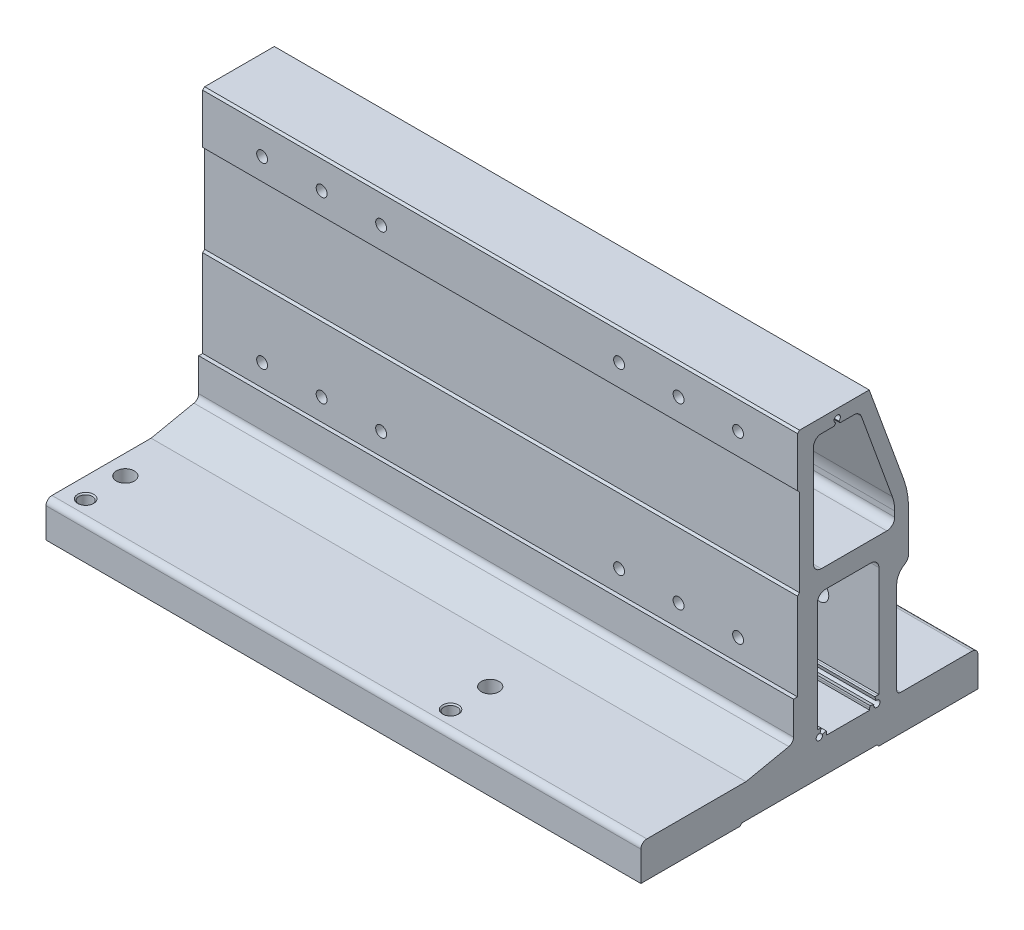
ISO-10303-21;
HEADER;
FILE_DESCRIPTION(('STEP AP214'),'2;1');
FILE_NAME('part.step','',(''),(''),'','','');
FILE_SCHEMA(('AUTOMOTIVE_DESIGN { 1 0 10303 214 1 1 1 1 }'));
ENDSEC;
DATA;
#1=APPLICATION_CONTEXT('core data for automotive mechanical design processes');
#2=APPLICATION_PROTOCOL_DEFINITION('international standard','automotive_design',2000,#1);
#3=PRODUCT_CONTEXT('',#1,'mechanical');
#4=PRODUCT('Part','Part','',(#3));
#5=PRODUCT_RELATED_PRODUCT_CATEGORY('part','',(#4));
#6=PRODUCT_DEFINITION_FORMATION('','',#4);
#7=PRODUCT_DEFINITION_CONTEXT('part definition',#1,'design');
#8=PRODUCT_DEFINITION('design','',#6,#7);
#9=PRODUCT_DEFINITION_SHAPE('','',#8);
#10=(LENGTH_UNIT() NAMED_UNIT(*) SI_UNIT(.MILLI.,.METRE.));
#11=(NAMED_UNIT(*) PLANE_ANGLE_UNIT() SI_UNIT($,.RADIAN.));
#12=(NAMED_UNIT(*) SI_UNIT($,.STERADIAN.) SOLID_ANGLE_UNIT());
#13=UNCERTAINTY_MEASURE_WITH_UNIT(LENGTH_MEASURE(1.E-05),#10,'distance_accuracy_value','');
#14=(GEOMETRIC_REPRESENTATION_CONTEXT(3) GLOBAL_UNCERTAINTY_ASSIGNED_CONTEXT((#13)) GLOBAL_UNIT_ASSIGNED_CONTEXT((#10,
#11,#12)) REPRESENTATION_CONTEXT('',''));
#15=CARTESIAN_POINT('',(0.,0.,0.));
#16=DIRECTION('',(0.,0.,1.));
#17=DIRECTION('',(1.,0.,0.));
#18=AXIS2_PLACEMENT_3D('',#15,#16,#17);
#19=CARTESIAN_POINT('',(150.,-1.,-35.0000000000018));
#20=DIRECTION('',(0.,1.,0.));
#21=DIRECTION('',(0.,0.,1.));
#22=AXIS2_PLACEMENT_3D('',#19,#20,#21);
#23=PLANE('',#22);
#24=CARTESIAN_POINT('',(44.,-1.,-55.0000000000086));
#25=DIRECTION('',(0.,-1.,0.));
#26=DIRECTION('',(0.,0.,-1.));
#27=AXIS2_PLACEMENT_3D('',#24,#25,#26);
#28=CIRCLE('',#27,4.49999999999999);
#29=CARTESIAN_POINT('',(44.,-1.,-59.5000000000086));
#30=VERTEX_POINT('',#29);
#31=EDGE_CURVE('E1566',#30,#30,#28,.T.);
#32=ORIENTED_EDGE('',*,*,#31,.F.);
#33=EDGE_LOOP('',(#32));
#34=FACE_BOUND('',#33,.T.);
#35=CARTESIAN_POINT('',(-140.,-1.,-75.0000000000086));
#36=DIRECTION('',(0.,-1.,0.));
#37=DIRECTION('',(0.,0.,-1.));
#38=AXIS2_PLACEMENT_3D('',#35,#36,#37);
#39=CIRCLE('',#38,4.025);
#40=CARTESIAN_POINT('',(-140.,-1.,-79.0250000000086));
#41=VERTEX_POINT('',#40);
#42=EDGE_CURVE('E529',#41,#41,#39,.T.);
#43=ORIENTED_EDGE('',*,*,#42,.F.);
#44=EDGE_LOOP('',(#43));
#45=FACE_BOUND('',#44,.T.);
#46=CARTESIAN_POINT('',(44.,-1.,-75.0000000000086));
#47=DIRECTION('',(0.,-1.,0.));
#48=DIRECTION('',(0.,0.,-1.));
#49=AXIS2_PLACEMENT_3D('',#46,#47,#48);
#50=CIRCLE('',#49,4.025);
#51=CARTESIAN_POINT('',(44.,-1.,-79.0250000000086));
#52=VERTEX_POINT('',#51);
#53=EDGE_CURVE('E541',#52,#52,#50,.T.);
#54=ORIENTED_EDGE('',*,*,#53,.F.);
#55=EDGE_LOOP('',(#54));
#56=FACE_BOUND('',#55,.T.);
#57=DIRECTION('',(0.,0.,-1.));
#58=VECTOR('',#57,1.);
#59=CARTESIAN_POINT('',(-150.,-1.,-35.0000000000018));
#60=LINE('',#59,#58);
#61=CARTESIAN_POINT('',(-150.,-1.,-35.0000000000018));
#62=VERTEX_POINT('',#61);
#63=CARTESIAN_POINT('',(-150.,-1.,-85.0000000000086));
#64=VERTEX_POINT('',#63);
#65=EDGE_CURVE('E1082',#62,#64,#60,.T.);
#66=ORIENTED_EDGE('',*,*,#65,.T.);
#67=DIRECTION('',(-1.,0.,0.));
#68=VECTOR('',#67,1.);
#69=CARTESIAN_POINT('',(150.,-1.,-85.0000000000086));
#70=LINE('',#69,#68);
#71=CARTESIAN_POINT('',(150.,-1.,-85.0000000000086));
#72=VERTEX_POINT('',#71);
#73=EDGE_CURVE('E1142',#72,#64,#70,.T.);
#74=ORIENTED_EDGE('',*,*,#73,.F.);
#75=DIRECTION('',(0.,0.,-1.));
#76=VECTOR('',#75,1.);
#77=CARTESIAN_POINT('',(150.,-1.,-35.0000000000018));
#78=LINE('',#77,#76);
#79=CARTESIAN_POINT('',(150.,-1.,-35.0000000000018));
#80=VERTEX_POINT('',#79);
#81=EDGE_CURVE('E1023',#80,#72,#78,.T.);
#82=ORIENTED_EDGE('',*,*,#81,.F.);
#83=DIRECTION('',(-1.,0.,0.));
#84=VECTOR('',#83,1.);
#85=CARTESIAN_POINT('',(150.,-1.,-35.0000000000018));
#86=LINE('',#85,#84);
#87=EDGE_CURVE('E1145',#80,#62,#86,.T.);
#88=ORIENTED_EDGE('',*,*,#87,.T.);
#89=EDGE_LOOP('',(#66,#74,#82,#88));
#90=FACE_BOUND('',#89,.T.);
#91=CARTESIAN_POINT('',(-140.,-1.,-55.0000000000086));
#92=DIRECTION('',(0.,-1.,0.));
#93=DIRECTION('',(0.,0.,-1.));
#94=AXIS2_PLACEMENT_3D('',#91,#92,#93);
#95=CIRCLE('',#94,4.49999999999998);
#96=CARTESIAN_POINT('',(-140.,-1.,-59.5000000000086));
#97=VERTEX_POINT('',#96);
#98=EDGE_CURVE('E1560',#97,#97,#95,.T.);
#99=ORIENTED_EDGE('',*,*,#98,.F.);
#100=EDGE_LOOP('',(#99));
#101=FACE_BOUND('',#100,.T.);
#102=ADVANCED_FACE('F37',(#34,#45,#56,#90,#101),#23,.F.);
#103=CARTESIAN_POINT('',(150.,24.4394126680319,10.9999999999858));
#104=DIRECTION('',(1.,0.,0.));
#105=DIRECTION('',(0.,0.,-1.));
#106=AXIS2_PLACEMENT_3D('',#103,#104,#105);
#107=PLANE('',#106);
#108=DIRECTION('',(0.,-1.,0.));
#109=VECTOR('',#108,1.);
#110=CARTESIAN_POINT('',(150.,155.999996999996,5.99999999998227));
#111=LINE('',#110,#109);
#112=CARTESIAN_POINT('',(150.,155.999996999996,5.99999999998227));
#113=VERTEX_POINT('',#112);
#114=CARTESIAN_POINT('',(150.,130.999999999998,5.99999999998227));
#115=VERTEX_POINT('',#114);
#116=EDGE_CURVE('E989',#113,#115,#111,.T.);
#117=ORIENTED_EDGE('',*,*,#116,.T.);
#118=DIRECTION('',(0.,-0.707106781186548,-0.707106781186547));
#119=VECTOR('',#118,1.);
#120=CARTESIAN_POINT('',(150.,130.999999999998,5.99999999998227));
#121=LINE('',#120,#119);
#122=CARTESIAN_POINT('',(150.,129.999999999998,4.99999999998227));
#123=VERTEX_POINT('',#122);
#124=EDGE_CURVE('E992',#115,#123,#121,.T.);
#125=ORIENTED_EDGE('',*,*,#124,.T.);
#126=DIRECTION('',(0.,-1.,0.));
#127=VECTOR('',#126,1.);
#128=CARTESIAN_POINT('',(150.,129.999999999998,4.99999999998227));
#129=LINE('',#128,#127);
#130=CARTESIAN_POINT('',(150.,85.9999999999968,4.99999999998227));
#131=VERTEX_POINT('',#130);
#132=EDGE_CURVE('E995',#123,#131,#129,.T.);
#133=ORIENTED_EDGE('',*,*,#132,.T.);
#134=DIRECTION('',(0.,-0.707106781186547,0.707106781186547));
#135=VECTOR('',#134,1.);
#136=CARTESIAN_POINT('',(150.,85.9999999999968,4.99999999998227));
#137=LINE('',#136,#135);
#138=CARTESIAN_POINT('',(150.,84.9999999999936,5.99999999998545));
#139=VERTEX_POINT('',#138);
#140=EDGE_CURVE('E997',#131,#139,#137,.T.);
#141=ORIENTED_EDGE('',*,*,#140,.T.);
#142=DIRECTION('',(0.,-1.,0.));
#143=VECTOR('',#142,1.);
#144=CARTESIAN_POINT('',(150.,84.9999999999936,5.99999999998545));
#145=LINE('',#144,#143);
#146=CARTESIAN_POINT('',(150.,40.9998314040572,5.99999999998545));
#147=VERTEX_POINT('',#146);
#148=EDGE_CURVE('E999',#139,#147,#145,.T.);
#149=ORIENTED_EDGE('',*,*,#148,.T.);
#150=DIRECTION('',(0.,0.,1.));
#151=VECTOR('',#150,1.);
#152=CARTESIAN_POINT('',(150.,40.9998314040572,5.99999999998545));
#153=LINE('',#152,#151);
#154=CARTESIAN_POINT('',(150.,40.9998314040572,7.99999999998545));
#155=VERTEX_POINT('',#154);
#156=EDGE_CURVE('E1001',#147,#155,#153,.T.);
#157=ORIENTED_EDGE('',*,*,#156,.T.);
#158=DIRECTION('',(0.,-1.,1.09883992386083E-13));
#159=VECTOR('',#158,1.);
#160=CARTESIAN_POINT('',(150.,40.9998314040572,7.99999999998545));
#161=LINE('',#160,#159);
#162=CARTESIAN_POINT('',(150.,24.4394126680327,7.99999999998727));
#163=VERTEX_POINT('',#162);
#164=EDGE_CURVE('E1003',#155,#163,#161,.T.);
#165=ORIENTED_EDGE('',*,*,#164,.T.);
#166=CARTESIAN_POINT('',(150.,24.4394126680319,10.9999999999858));
#167=DIRECTION('',(-1.,0.,0.));
#168=DIRECTION('',(0.,0.,-1.));
#169=AXIS2_PLACEMENT_3D('',#166,#167,#168);
#170=CIRCLE('',#169,2.99999999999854);
#171=CARTESIAN_POINT('',(150.,21.5024714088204,10.3881372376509));
#172=VERTEX_POINT('',#171);
#173=EDGE_CURVE('E1005',#163,#172,#170,.T.);
#174=ORIENTED_EDGE('',*,*,#173,.T.);
#175=DIRECTION('',(0.,-0.203954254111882,0.97898041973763));
#176=VECTOR('',#175,1.);
#177=CARTESIAN_POINT('',(150.,21.5024714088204,10.3881372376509));
#178=LINE('',#177,#176);
#179=CARTESIAN_POINT('',(150.,17.,32.0000000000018));
#180=VERTEX_POINT('',#179);
#181=EDGE_CURVE('E1007',#172,#180,#178,.T.);
#182=ORIENTED_EDGE('',*,*,#181,.T.);
#183=DIRECTION('',(0.,0.,1.));
#184=VECTOR('',#183,1.);
#185=CARTESIAN_POINT('',(150.,17.,32.0000000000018));
#186=LINE('',#185,#184);
#187=CARTESIAN_POINT('',(150.,17.,82.0000000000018));
#188=VERTEX_POINT('',#187);
#189=EDGE_CURVE('E1009',#180,#188,#186,.T.);
#190=ORIENTED_EDGE('',*,*,#189,.T.);
#191=CARTESIAN_POINT('',(150.,14.,82.0000000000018));
#192=DIRECTION('',(1.,0.,0.));
#193=DIRECTION('',(0.,0.,-1.));
#194=AXIS2_PLACEMENT_3D('',#191,#192,#193);
#195=CIRCLE('',#194,3.);
#196=CARTESIAN_POINT('',(150.,14.,85.0000000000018));
#197=VERTEX_POINT('',#196);
#198=EDGE_CURVE('E1011',#188,#197,#195,.T.);
#199=ORIENTED_EDGE('',*,*,#198,.T.);
#200=DIRECTION('',(0.,-1.,0.));
#201=VECTOR('',#200,1.);
#202=CARTESIAN_POINT('',(150.,14.,85.0000000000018));
#203=LINE('',#202,#201);
#204=CARTESIAN_POINT('',(150.,-1.,85.0000000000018));
#205=VERTEX_POINT('',#204);
#206=EDGE_CURVE('E1013',#197,#205,#203,.T.);
#207=ORIENTED_EDGE('',*,*,#206,.T.);
#208=DIRECTION('',(0.,0.,-1.));
#209=VECTOR('',#208,1.);
#210=CARTESIAN_POINT('',(150.,-1.,85.0000000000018));
#211=LINE('',#210,#209);
#212=CARTESIAN_POINT('',(150.,-1.,35.0000000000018));
#213=VERTEX_POINT('',#212);
#214=EDGE_CURVE('E1015',#205,#213,#211,.T.);
#215=ORIENTED_EDGE('',*,*,#214,.T.);
#216=DIRECTION('',(0.,0.707106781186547,-0.707106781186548));
#217=VECTOR('',#216,1.);
#218=CARTESIAN_POINT('',(150.,-1.,35.0000000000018));
#219=LINE('',#218,#217);
#220=CARTESIAN_POINT('',(150.,0.,34.0000000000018));
#221=VERTEX_POINT('',#220);
#222=EDGE_CURVE('E1017',#213,#221,#219,.T.);
#223=ORIENTED_EDGE('',*,*,#222,.T.);
#224=DIRECTION('',(0.,0.,-1.));
#225=VECTOR('',#224,1.);
#226=CARTESIAN_POINT('',(150.,0.,34.0000000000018));
#227=LINE('',#226,#225);
#228=CARTESIAN_POINT('',(150.,0.,-34.0000000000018));
#229=VERTEX_POINT('',#228);
#230=EDGE_CURVE('E1019',#221,#229,#227,.T.);
#231=ORIENTED_EDGE('',*,*,#230,.T.);
#232=DIRECTION('',(0.,-0.707106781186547,-0.707106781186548));
#233=VECTOR('',#232,1.);
#234=CARTESIAN_POINT('',(150.,0.,-34.0000000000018));
#235=LINE('',#234,#233);
#236=EDGE_CURVE('E1021',#229,#80,#235,.T.);
#237=ORIENTED_EDGE('',*,*,#236,.T.);
#238=ORIENTED_EDGE('',*,*,#81,.T.);
#239=DIRECTION('',(0.,1.,0.));
#240=VECTOR('',#239,1.);
#241=CARTESIAN_POINT('',(150.,-1.,-85.0000000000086));
#242=LINE('',#241,#240);
#243=CARTESIAN_POINT('',(150.,14.0000000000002,-85.0000000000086));
#244=VERTEX_POINT('',#243);
#245=EDGE_CURVE('E1025',#72,#244,#242,.T.);
#246=ORIENTED_EDGE('',*,*,#245,.T.);
#247=CARTESIAN_POINT('',(150.,14.0000000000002,-82.0000000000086));
#248=DIRECTION('',(1.,0.,0.));
#249=DIRECTION('',(0.,0.,-1.));
#250=AXIS2_PLACEMENT_3D('',#247,#248,#249);
#251=CIRCLE('',#250,3.);
#252=CARTESIAN_POINT('',(150.,17.0000000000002,-82.0000000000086));
#253=VERTEX_POINT('',#252);
#254=EDGE_CURVE('E1027',#244,#253,#251,.T.);
#255=ORIENTED_EDGE('',*,*,#254,.T.);
#256=DIRECTION('',(0.,0.,1.));
#257=VECTOR('',#256,1.);
#258=CARTESIAN_POINT('',(150.,17.0000000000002,-82.0000000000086));
#259=LINE('',#258,#257);
#260=CARTESIAN_POINT('',(150.,17.0000000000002,-46.0000000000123));
#261=VERTEX_POINT('',#260);
#262=EDGE_CURVE('E1029',#253,#261,#259,.T.);
#263=ORIENTED_EDGE('',*,*,#262,.T.);
#264=CARTESIAN_POINT('',(150.,19.0000000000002,-46.0000000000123));
#265=DIRECTION('',(-1.,0.,0.));
#266=DIRECTION('',(0.,0.,-1.));
#267=AXIS2_PLACEMENT_3D('',#264,#265,#266);
#268=CIRCLE('',#267,2.);
#269=CARTESIAN_POINT('',(150.,19.0000000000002,-44.0000000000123));
#270=VERTEX_POINT('',#269);
#271=EDGE_CURVE('E1031',#261,#270,#268,.T.);
#272=ORIENTED_EDGE('',*,*,#271,.T.);
#273=DIRECTION('',(0.,1.,0.));
#274=VECTOR('',#273,1.);
#275=CARTESIAN_POINT('',(150.,19.0000000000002,-44.0000000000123));
#276=LINE('',#275,#274);
#277=CARTESIAN_POINT('',(150.,65.0000000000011,-44.0000000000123));
#278=VERTEX_POINT('',#277);
#279=EDGE_CURVE('E1033',#270,#278,#276,.T.);
#280=ORIENTED_EDGE('',*,*,#279,.T.);
#281=CARTESIAN_POINT('',(150.,65.0000000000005,-52.0000000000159));
#282=DIRECTION('',(-1.,0.,0.));
#283=DIRECTION('',(0.,0.,-1.));
#284=AXIS2_PLACEMENT_3D('',#281,#282,#283);
#285=CIRCLE('',#284,8.00000000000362);
#286=CARTESIAN_POINT('',(150.,71.928203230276,-48.0000000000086));
#287=VERTEX_POINT('',#286);
#288=EDGE_CURVE('E1035',#278,#287,#285,.T.);
#289=ORIENTED_EDGE('',*,*,#288,.T.);
#290=CARTESIAN_POINT('',(150.,75.392304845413,-46.0000000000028));
#291=DIRECTION('',(1.,0.,0.));
#292=DIRECTION('',(0.,0.,-1.));
#293=AXIS2_PLACEMENT_3D('',#290,#291,#292);
#294=CIRCLE('',#293,4.00000000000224);
#295=CARTESIAN_POINT('',(150.,75.392304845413,-50.000000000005));
#296=VERTEX_POINT('',#295);
#297=EDGE_CURVE('E1037',#287,#296,#294,.T.);
#298=ORIENTED_EDGE('',*,*,#297,.T.);
#299=DIRECTION('',(0.,1.,0.));
#300=VECTOR('',#299,1.);
#301=CARTESIAN_POINT('',(150.,75.3923048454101,-50.000000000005));
#302=LINE('',#301,#300);
#303=CARTESIAN_POINT('',(150.,95.4420377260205,-50.000000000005));
#304=VERTEX_POINT('',#303);
#305=EDGE_CURVE('E1039',#296,#304,#302,.T.);
#306=ORIENTED_EDGE('',*,*,#305,.T.);
#307=CARTESIAN_POINT('',(150.,95.4420377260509,-10.0000000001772));
#308=DIRECTION('',(1.,0.,0.));
#309=DIRECTION('',(0.,0.,-1.));
#310=AXIS2_PLACEMENT_3D('',#307,#308,#309);
#311=CIRCLE('',#310,39.9999999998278);
#312=CARTESIAN_POINT('',(150.,109.131743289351,-47.5844643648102));
#313=VERTEX_POINT('',#312);
#314=EDGE_CURVE('E1041',#304,#313,#311,.T.);
#315=ORIENTED_EDGE('',*,*,#314,.T.);
#316=DIRECTION('',(0.,0.939611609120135,0.342242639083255));
#317=VECTOR('',#316,1.);
#318=CARTESIAN_POINT('',(150.,109.131743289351,-47.5844643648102));
#319=LINE('',#318,#317);
#320=CARTESIAN_POINT('',(150.,156.999996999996,-30.1490077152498));
#321=VERTEX_POINT('',#320);
#322=EDGE_CURVE('E1043',#313,#321,#319,.T.);
#323=ORIENTED_EDGE('',*,*,#322,.T.);
#324=DIRECTION('',(0.,0.,1.));
#325=VECTOR('',#324,1.);
#326=CARTESIAN_POINT('',(150.,156.999996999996,-30.1490077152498));
#327=LINE('',#326,#325);
#328=CARTESIAN_POINT('',(150.,156.999996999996,4.99999999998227));
#329=VERTEX_POINT('',#328);
#330=EDGE_CURVE('E1045',#321,#329,#327,.T.);
#331=ORIENTED_EDGE('',*,*,#330,.T.);
#332=DIRECTION('',(0.,-0.707106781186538,0.707106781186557));
#333=VECTOR('',#332,1.);
#334=CARTESIAN_POINT('',(150.,156.999996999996,4.99999999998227));
#335=LINE('',#334,#333);
#336=EDGE_CURVE('E1047',#329,#113,#335,.T.);
#337=ORIENTED_EDGE('',*,*,#336,.T.);
#338=EDGE_LOOP('',(#117,#125,#133,#141,#149,#157,#165,#174,#182,#190,#199,#207,#215,#223,#231,
#237,#238,#246,#255,#263,#272,#280,#289,#298,#306,#315,#323,#331,#337));
#339=FACE_BOUND('',#338,.T.);
#340=DIRECTION('',(0.,0.,-1.));
#341=VECTOR('',#340,1.);
#342=CARTESIAN_POINT('',(150.,91.,-39.0000000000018));
#343=LINE('',#342,#341);
#344=CARTESIAN_POINT('',(150.,91.0000000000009,-6.00000000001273));
#345=VERTEX_POINT('',#344);
#346=CARTESIAN_POINT('',(150.,91.,-39.0000000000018));
#347=VERTEX_POINT('',#346);
#348=EDGE_CURVE('E885',#345,#347,#343,.T.);
#349=ORIENTED_EDGE('',*,*,#348,.F.);
#350=CARTESIAN_POINT('',(150.,95.0000000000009,-6.00000000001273));
#351=DIRECTION('',(1.,0.,0.));
#352=DIRECTION('',(0.,0.,-1.));
#353=AXIS2_PLACEMENT_3D('',#350,#351,#352);
#354=CIRCLE('',#353,4.);
#355=CARTESIAN_POINT('',(150.,95.0000000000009,-2.00000000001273));
#356=VERTEX_POINT('',#355);
#357=EDGE_CURVE('E883',#356,#345,#354,.T.);
#358=ORIENTED_EDGE('',*,*,#357,.F.);
#359=DIRECTION('',(0.,-1.,0.));
#360=VECTOR('',#359,1.);
#361=CARTESIAN_POINT('',(150.,95.0000000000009,-2.00000000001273));
#362=LINE('',#361,#360);
#363=CARTESIAN_POINT('',(150.,146.000000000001,-2.00000000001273));
#364=VERTEX_POINT('',#363);
#365=EDGE_CURVE('E911',#364,#356,#362,.T.);
#366=ORIENTED_EDGE('',*,*,#365,.F.);
#367=CARTESIAN_POINT('',(150.,146.000000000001,-6.00000000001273));
#368=DIRECTION('',(1.,0.,0.));
#369=DIRECTION('',(0.,0.,-1.));
#370=AXIS2_PLACEMENT_3D('',#367,#368,#369);
#371=CIRCLE('',#370,4.);
#372=CARTESIAN_POINT('',(150.,150.000000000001,-6.00000000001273));
#373=VERTEX_POINT('',#372);
#374=EDGE_CURVE('E908',#373,#364,#371,.T.);
#375=ORIENTED_EDGE('',*,*,#374,.F.);
#376=DIRECTION('',(0.,1.39695933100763E-13,1.));
#377=VECTOR('',#376,1.);
#378=CARTESIAN_POINT('',(150.,150.000000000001,-6.00000000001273));
#379=LINE('',#378,#377);
#380=CARTESIAN_POINT('',(150.,150.,-12.5566260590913));
#381=VERTEX_POINT('',#380);
#382=EDGE_CURVE('E906',#381,#373,#379,.T.);
#383=ORIENTED_EDGE('',*,*,#382,.F.);
#384=DIRECTION('',(0.,-0.866025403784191,0.500000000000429));
#385=VECTOR('',#384,1.);
#386=CARTESIAN_POINT('',(150.,150.,-12.5566260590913));
#387=LINE('',#386,#385);
#388=CARTESIAN_POINT('',(150.,151.114356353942,-13.2000000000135));
#389=VERTEX_POINT('',#388);
#390=EDGE_CURVE('E904',#389,#381,#387,.T.);
#391=ORIENTED_EDGE('',*,*,#390,.F.);
#392=CARTESIAN_POINT('',(150.,152.499996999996,-14.0000000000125));
#393=DIRECTION('',(1.,0.,0.));
#394=DIRECTION('',(0.,0.,-1.));
#395=AXIS2_PLACEMENT_3D('',#392,#393,#394);
#396=CIRCLE('',#395,1.59999999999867);
#397=CARTESIAN_POINT('',(150.,151.114356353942,-14.800000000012));
#398=VERTEX_POINT('',#397);
#399=EDGE_CURVE('E902',#398,#389,#396,.T.);
#400=ORIENTED_EDGE('',*,*,#399,.F.);
#401=DIRECTION('',(0.,0.866025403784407,0.500000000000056));
#402=VECTOR('',#401,1.);
#403=CARTESIAN_POINT('',(150.,151.114356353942,-14.800000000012));
#404=LINE('',#403,#402);
#405=CARTESIAN_POINT('',(150.,149.999999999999,-15.4433739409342));
#406=VERTEX_POINT('',#405);
#407=EDGE_CURVE('E900',#406,#398,#404,.T.);
#408=ORIENTED_EDGE('',*,*,#407,.F.);
#409=DIRECTION('',(0.,1.3074889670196E-13,1.));
#410=VECTOR('',#409,1.);
#411=CARTESIAN_POINT('',(150.,149.999999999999,-15.4433739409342));
#412=LINE('',#411,#410);
#413=CARTESIAN_POINT('',(150.,149.999999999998,-22.4486643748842));
#414=VERTEX_POINT('',#413);
#415=EDGE_CURVE('E898',#414,#406,#412,.T.);
#416=ORIENTED_EDGE('',*,*,#415,.F.);
#417=CARTESIAN_POINT('',(150.,145.999999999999,-22.4486643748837));
#418=DIRECTION('',(1.,0.,0.));
#419=DIRECTION('',(0.,0.,-1.));
#420=AXIS2_PLACEMENT_3D('',#417,#418,#419);
#421=CIRCLE('',#420,3.99999999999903);
#422=CARTESIAN_POINT('',(150.,147.368970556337,-26.2071108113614));
#423=VERTEX_POINT('',#422);
#424=EDGE_CURVE('E896',#423,#414,#421,.T.);
#425=ORIENTED_EDGE('',*,*,#424,.F.);
#426=DIRECTION('',(0.,0.939611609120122,0.34224263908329));
#427=VECTOR('',#426,1.);
#428=CARTESIAN_POINT('',(150.,147.368970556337,-26.2071108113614));
#429=LINE('',#428,#427);
#430=CARTESIAN_POINT('',(150.,104.580728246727,-41.7922321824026));
#431=VERTEX_POINT('',#430);
#432=EDGE_CURVE('E894',#431,#423,#429,.T.);
#433=ORIENTED_EDGE('',*,*,#432,.F.);
#434=CARTESIAN_POINT('',(150.,97.7358754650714,-23.000000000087));
#435=DIRECTION('',(1.,0.,0.));
#436=DIRECTION('',(0.,0.,-1.));
#437=AXIS2_PLACEMENT_3D('',#434,#435,#436);
#438=CIRCLE('',#437,19.9999999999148);
#439=CARTESIAN_POINT('',(150.,97.7358754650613,-43.0000000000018));
#440=VERTEX_POINT('',#439);
#441=EDGE_CURVE('E892',#440,#431,#438,.T.);
#442=ORIENTED_EDGE('',*,*,#441,.F.);
#443=DIRECTION('',(0.,1.,0.));
#444=VECTOR('',#443,1.);
#445=CARTESIAN_POINT('',(150.,97.7358754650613,-43.0000000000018));
#446=LINE('',#445,#444);
#447=CARTESIAN_POINT('',(150.,95.,-43.0000000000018));
#448=VERTEX_POINT('',#447);
#449=EDGE_CURVE('E890',#448,#440,#446,.T.);
#450=ORIENTED_EDGE('',*,*,#449,.F.);
#451=CARTESIAN_POINT('',(150.,95.,-39.0000000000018));
#452=DIRECTION('',(1.,0.,0.));
#453=DIRECTION('',(0.,0.,-1.));
#454=AXIS2_PLACEMENT_3D('',#451,#452,#453);
#455=CIRCLE('',#454,4.);
#456=EDGE_CURVE('E888',#347,#448,#455,.T.);
#457=ORIENTED_EDGE('',*,*,#456,.F.);
#458=EDGE_LOOP('',(#349,#358,#366,#375,#383,#391,#400,#408,#416,#425,#433,#442,#450,#457));
#459=FACE_BOUND('',#458,.T.);
#460=DIRECTION('',(0.,-1.,0.));
#461=VECTOR('',#460,1.);
#462=CARTESIAN_POINT('',(150.,21.6000000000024,-4.00000000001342));
#463=LINE('',#462,#461);
#464=CARTESIAN_POINT('',(150.,77.000000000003,-4.00000000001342));
#465=VERTEX_POINT('',#464);
#466=CARTESIAN_POINT('',(150.,21.6000000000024,-4.00000000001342));
#467=VERTEX_POINT('',#466);
#468=EDGE_CURVE('E742',#465,#467,#463,.T.);
#469=ORIENTED_EDGE('',*,*,#468,.F.);
#470=CARTESIAN_POINT('',(150.,77.0000000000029,-8.00000000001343));
#471=DIRECTION('',(1.,0.,0.));
#472=DIRECTION('',(0.,0.,-1.));
#473=AXIS2_PLACEMENT_3D('',#470,#471,#472);
#474=CIRCLE('',#473,4.);
#475=CARTESIAN_POINT('',(150.,81.0000000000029,-8.00000000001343));
#476=VERTEX_POINT('',#475);
#477=EDGE_CURVE('E740',#476,#465,#474,.T.);
#478=ORIENTED_EDGE('',*,*,#477,.F.);
#479=DIRECTION('',(0.,0.,1.));
#480=VECTOR('',#479,1.);
#481=CARTESIAN_POINT('',(150.,81.0000000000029,-8.00000000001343));
#482=LINE('',#481,#480);
#483=CARTESIAN_POINT('',(150.,81.0000000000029,-31.0000000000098));
#484=VERTEX_POINT('',#483);
#485=EDGE_CURVE('E780',#484,#476,#482,.T.);
#486=ORIENTED_EDGE('',*,*,#485,.F.);
#487=CARTESIAN_POINT('',(150.,77.0000000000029,-31.0000000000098));
#488=DIRECTION('',(1.,0.,0.));
#489=DIRECTION('',(0.,0.,-1.));
#490=AXIS2_PLACEMENT_3D('',#487,#488,#489);
#491=CIRCLE('',#490,4.);
#492=CARTESIAN_POINT('',(150.,77.000000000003,-35.0000000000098));
#493=VERTEX_POINT('',#492);
#494=EDGE_CURVE('E777',#493,#484,#491,.T.);
#495=ORIENTED_EDGE('',*,*,#494,.F.);
#496=DIRECTION('',(0.,1.,0.));
#497=VECTOR('',#496,1.);
#498=CARTESIAN_POINT('',(150.,77.000000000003,-35.0000000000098));
#499=LINE('',#498,#497);
#500=CARTESIAN_POINT('',(150.,21.6000000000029,-35.0000000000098));
#501=VERTEX_POINT('',#500);
#502=EDGE_CURVE('E775',#501,#493,#499,.T.);
#503=ORIENTED_EDGE('',*,*,#502,.F.);
#504=DIRECTION('',(0.,0.,-1.));
#505=VECTOR('',#504,1.);
#506=CARTESIAN_POINT('',(150.,21.6000000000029,-35.0000000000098));
#507=LINE('',#506,#505);
#508=CARTESIAN_POINT('',(150.,21.6000000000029,-34.0000000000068));
#509=VERTEX_POINT('',#508);
#510=EDGE_CURVE('E773',#509,#501,#507,.T.);
#511=ORIENTED_EDGE('',*,*,#510,.F.);
#512=CARTESIAN_POINT('',(150.,18.0000000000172,-34.0000000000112));
#513=DIRECTION('',(-1.,0.,0.));
#514=DIRECTION('',(0.,0.,-1.));
#515=AXIS2_PLACEMENT_3D('',#512,#513,#514);
#516=CIRCLE('',#515,3.5999999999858);
#517=CARTESIAN_POINT('',(150.,21.477332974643,-33.0682514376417));
#518=VERTEX_POINT('',#517);
#519=EDGE_CURVE('E771',#518,#509,#516,.T.);
#520=ORIENTED_EDGE('',*,*,#519,.F.);
#521=DIRECTION('',(0.,0.965925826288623,0.258819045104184));
#522=VECTOR('',#521,1.);
#523=CARTESIAN_POINT('',(150.,21.477332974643,-33.0682514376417));
#524=LINE('',#523,#522);
#525=CARTESIAN_POINT('',(150.,19.5454813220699,-33.5858895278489));
#526=VERTEX_POINT('',#525);
#527=EDGE_CURVE('E769',#526,#518,#524,.T.);
#528=ORIENTED_EDGE('',*,*,#527,.F.);
#529=CARTESIAN_POINT('',(150.,18.0000000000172,-34.0000000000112));
#530=DIRECTION('',(1.,0.,0.));
#531=DIRECTION('',(0.,0.,-1.));
#532=AXIS2_PLACEMENT_3D('',#529,#530,#531);
#533=CIRCLE('',#532,1.59999999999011);
#534=CARTESIAN_POINT('',(150.,18.4141104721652,-32.4545186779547));
#535=VERTEX_POINT('',#534);
#536=EDGE_CURVE('E767',#535,#526,#533,.T.);
#537=ORIENTED_EDGE('',*,*,#536,.F.);
#538=DIRECTION('',(0.,-0.258819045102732,-0.965925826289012));
#539=VECTOR('',#538,1.);
#540=CARTESIAN_POINT('',(150.,18.4141104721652,-32.4545186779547));
#541=LINE('',#540,#539);
#542=CARTESIAN_POINT('',(150.,18.9317485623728,-30.5226670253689));
#543=VERTEX_POINT('',#542);
#544=EDGE_CURVE('E765',#543,#535,#541,.T.);
#545=ORIENTED_EDGE('',*,*,#544,.F.);
#546=CARTESIAN_POINT('',(150.,18.0000000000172,-34.0000000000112));
#547=DIRECTION('',(-1.,0.,0.));
#548=DIRECTION('',(0.,0.,-1.));
#549=AXIS2_PLACEMENT_3D('',#546,#547,#548);
#550=CIRCLE('',#549,3.59999999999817);
#551=CARTESIAN_POINT('',(150.,18.0000000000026,-30.4000000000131));
#552=VERTEX_POINT('',#551);
#553=EDGE_CURVE('E763',#552,#543,#550,.T.);
#554=ORIENTED_EDGE('',*,*,#553,.F.);
#555=DIRECTION('',(0.,1.,0.));
#556=VECTOR('',#555,1.);
#557=CARTESIAN_POINT('',(150.,18.0000000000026,-30.4000000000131));
#558=LINE('',#557,#556);
#559=CARTESIAN_POINT('',(150.,17.0000000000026,-30.4000000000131));
#560=VERTEX_POINT('',#559);
#561=EDGE_CURVE('E761',#560,#552,#558,.T.);
#562=ORIENTED_EDGE('',*,*,#561,.F.);
#563=DIRECTION('',(0.,0.,-1.));
#564=VECTOR('',#563,1.);
#565=CARTESIAN_POINT('',(150.,17.0000000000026,-30.4000000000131));
#566=LINE('',#565,#564);
#567=CARTESIAN_POINT('',(150.,17.0000000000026,-8.60000000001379));
#568=VERTEX_POINT('',#567);
#569=EDGE_CURVE('E759',#568,#560,#566,.T.);
#570=ORIENTED_EDGE('',*,*,#569,.F.);
#571=DIRECTION('',(0.,-1.,0.));
#572=VECTOR('',#571,1.);
#573=CARTESIAN_POINT('',(150.,17.0000000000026,-8.60000000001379));
#574=LINE('',#573,#572);
#575=CARTESIAN_POINT('',(150.,18.000000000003,-8.60000000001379));
#576=VERTEX_POINT('',#575);
#577=EDGE_CURVE('E757',#576,#568,#574,.T.);
#578=ORIENTED_EDGE('',*,*,#577,.F.);
#579=CARTESIAN_POINT('',(150.,17.9999999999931,-5.00000000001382));
#580=DIRECTION('',(-1.,0.,0.));
#581=DIRECTION('',(0.,0.,-1.));
#582=AXIS2_PLACEMENT_3D('',#579,#580,#581);
#583=CIRCLE('',#582,3.59999999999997);
#584=CARTESIAN_POINT('',(150.,18.9317485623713,-8.47733297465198));
#585=VERTEX_POINT('',#584);
#586=EDGE_CURVE('E755',#585,#576,#583,.T.);
#587=ORIENTED_EDGE('',*,*,#586,.F.);
#588=DIRECTION('',(0.,0.258819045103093,-0.965925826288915));
#589=VECTOR('',#588,1.);
#590=CARTESIAN_POINT('',(150.,18.9317485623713,-8.47733297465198));
#591=LINE('',#590,#589);
#592=CARTESIAN_POINT('',(150.,18.4141104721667,-6.54548132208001));
#593=VERTEX_POINT('',#592);
#594=EDGE_CURVE('E753',#593,#585,#591,.T.);
#595=ORIENTED_EDGE('',*,*,#594,.F.);
#596=CARTESIAN_POINT('',(150.,17.9999999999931,-5.00000000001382));
#597=DIRECTION('',(1.,0.,0.));
#598=DIRECTION('',(0.,0.,-1.));
#599=AXIS2_PLACEMENT_3D('',#596,#597,#598);
#600=CIRCLE('',#599,1.60000000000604);
#601=CARTESIAN_POINT('',(150.,19.5454813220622,-5.41411047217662));
#602=VERTEX_POINT('',#601);
#603=EDGE_CURVE('E751',#602,#593,#600,.T.);
#604=ORIENTED_EDGE('',*,*,#603,.F.);
#605=DIRECTION('',(0.,-0.965925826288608,0.258819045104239));
#606=VECTOR('',#605,1.);
#607=CARTESIAN_POINT('',(150.,19.5454813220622,-5.41411047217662));
#608=LINE('',#607,#606);
#609=CARTESIAN_POINT('',(150.,21.4773329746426,-5.93174856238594));
#610=VERTEX_POINT('',#609);
#611=EDGE_CURVE('E749',#610,#602,#608,.T.);
#612=ORIENTED_EDGE('',*,*,#611,.F.);
#613=CARTESIAN_POINT('',(150.,17.9999999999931,-5.00000000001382));
#614=DIRECTION('',(-1.,0.,0.));
#615=DIRECTION('',(0.,0.,-1.));
#616=AXIS2_PLACEMENT_3D('',#613,#614,#615);
#617=CIRCLE('',#616,3.60000000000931);
#618=CARTESIAN_POINT('',(150.,21.6000000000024,-5.00000000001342));
#619=VERTEX_POINT('',#618);
#620=EDGE_CURVE('E747',#619,#610,#617,.T.);
#621=ORIENTED_EDGE('',*,*,#620,.F.);
#622=DIRECTION('',(0.,0.,-1.));
#623=VECTOR('',#622,1.);
#624=CARTESIAN_POINT('',(150.,21.6000000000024,-5.00000000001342));
#625=LINE('',#624,#623);
#626=EDGE_CURVE('E745',#467,#619,#625,.T.);
#627=ORIENTED_EDGE('',*,*,#626,.F.);
#628=EDGE_LOOP('',(#469,#478,#486,#495,#503,#511,#520,#528,#537,#545,#554,#562,#570,#578,#587,
#595,#604,#612,#621,#627));
#629=FACE_BOUND('',#628,.T.);
#630=ADVANCED_FACE('F1363',(#339,#459,#629),#107,.T.);
#631=CARTESIAN_POINT('',(-150.,24.4394126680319,10.9999999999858));
#632=DIRECTION('',(1.,0.,0.));
#633=DIRECTION('',(0.,0.,-1.));
#634=AXIS2_PLACEMENT_3D('',#631,#632,#633);
#635=PLANE('',#634);
#636=CARTESIAN_POINT('',(-150.,8.,-45.0000000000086));
#637=DIRECTION('',(-1.,0.,0.));
#638=DIRECTION('',(0.,0.,1.));
#639=AXIS2_PLACEMENT_3D('',#636,#637,#638);
#640=CIRCLE('',#639,2.525);
#641=CARTESIAN_POINT('',(-150.,8.,-42.4750000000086));
#642=VERTEX_POINT('',#641);
#643=EDGE_CURVE('E550',#642,#642,#640,.T.);
#644=ORIENTED_EDGE('',*,*,#643,.F.);
#645=EDGE_LOOP('',(#644));
#646=FACE_BOUND('',#645,.T.);
#647=CARTESIAN_POINT('',(-150.,8.,-9.00000000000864));
#648=DIRECTION('',(-1.,0.,0.));
#649=DIRECTION('',(0.,0.,1.));
#650=AXIS2_PLACEMENT_3D('',#647,#648,#649);
#651=CIRCLE('',#650,2.525);
#652=CARTESIAN_POINT('',(-150.,8.,-6.47500000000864));
#653=VERTEX_POINT('',#652);
#654=EDGE_CURVE('E559',#653,#653,#651,.T.);
#655=ORIENTED_EDGE('',*,*,#654,.F.);
#656=EDGE_LOOP('',(#655));
#657=FACE_BOUND('',#656,.T.);
#658=CARTESIAN_POINT('',(-150.,95.0000000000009,-6.00000000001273));
#659=DIRECTION('',(1.,0.,0.));
#660=DIRECTION('',(0.,0.,-1.));
#661=AXIS2_PLACEMENT_3D('',#658,#659,#660);
#662=CIRCLE('',#661,4.);
#663=CARTESIAN_POINT('',(-150.,95.0000000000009,-2.00000000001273));
#664=VERTEX_POINT('',#663);
#665=CARTESIAN_POINT('',(-150.,91.0000000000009,-6.00000000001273));
#666=VERTEX_POINT('',#665);
#667=EDGE_CURVE('E882',#664,#666,#662,.T.);
#668=ORIENTED_EDGE('',*,*,#667,.T.);
#669=DIRECTION('',(0.,0.,-1.));
#670=VECTOR('',#669,1.);
#671=CARTESIAN_POINT('',(-150.,91.,-39.0000000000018));
#672=LINE('',#671,#670);
#673=CARTESIAN_POINT('',(-150.,91.,-39.0000000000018));
#674=VERTEX_POINT('',#673);
#675=EDGE_CURVE('E916',#666,#674,#672,.T.);
#676=ORIENTED_EDGE('',*,*,#675,.T.);
#677=CARTESIAN_POINT('',(-150.,95.,-39.0000000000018));
#678=DIRECTION('',(1.,0.,0.));
#679=DIRECTION('',(0.,0.,-1.));
#680=AXIS2_PLACEMENT_3D('',#677,#678,#679);
#681=CIRCLE('',#680,4.);
#682=CARTESIAN_POINT('',(-150.,95.,-43.0000000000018));
#683=VERTEX_POINT('',#682);
#684=EDGE_CURVE('E919',#674,#683,#681,.T.);
#685=ORIENTED_EDGE('',*,*,#684,.T.);
#686=DIRECTION('',(0.,1.,0.));
#687=VECTOR('',#686,1.);
#688=CARTESIAN_POINT('',(-150.,97.7358754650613,-43.0000000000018));
#689=LINE('',#688,#687);
#690=CARTESIAN_POINT('',(-150.,97.7358754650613,-43.0000000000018));
#691=VERTEX_POINT('',#690);
#692=EDGE_CURVE('E922',#683,#691,#689,.T.);
#693=ORIENTED_EDGE('',*,*,#692,.T.);
#694=CARTESIAN_POINT('',(-150.,97.7358754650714,-23.000000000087));
#695=DIRECTION('',(1.,0.,0.));
#696=DIRECTION('',(0.,0.,-1.));
#697=AXIS2_PLACEMENT_3D('',#694,#695,#696);
#698=CIRCLE('',#697,19.9999999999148);
#699=CARTESIAN_POINT('',(-150.,104.580728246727,-41.7922321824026));
#700=VERTEX_POINT('',#699);
#701=EDGE_CURVE('E925',#691,#700,#698,.T.);
#702=ORIENTED_EDGE('',*,*,#701,.T.);
#703=DIRECTION('',(0.,0.939611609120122,0.34224263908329));
#704=VECTOR('',#703,1.);
#705=CARTESIAN_POINT('',(-150.,147.368970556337,-26.2071108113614));
#706=LINE('',#705,#704);
#707=CARTESIAN_POINT('',(-150.,147.368970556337,-26.2071108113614));
#708=VERTEX_POINT('',#707);
#709=EDGE_CURVE('E928',#700,#708,#706,.T.);
#710=ORIENTED_EDGE('',*,*,#709,.T.);
#711=CARTESIAN_POINT('',(-150.,145.999999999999,-22.4486643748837));
#712=DIRECTION('',(1.,0.,0.));
#713=DIRECTION('',(0.,0.,-1.));
#714=AXIS2_PLACEMENT_3D('',#711,#712,#713);
#715=CIRCLE('',#714,3.99999999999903);
#716=CARTESIAN_POINT('',(-150.,149.999999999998,-22.4486643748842));
#717=VERTEX_POINT('',#716);
#718=EDGE_CURVE('E931',#708,#717,#715,.T.);
#719=ORIENTED_EDGE('',*,*,#718,.T.);
#720=DIRECTION('',(0.,1.3074889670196E-13,1.));
#721=VECTOR('',#720,1.);
#722=CARTESIAN_POINT('',(-150.,149.999999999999,-15.4433739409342));
#723=LINE('',#722,#721);
#724=CARTESIAN_POINT('',(-150.,149.999999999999,-15.4433739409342));
#725=VERTEX_POINT('',#724);
#726=EDGE_CURVE('E934',#717,#725,#723,.T.);
#727=ORIENTED_EDGE('',*,*,#726,.T.);
#728=DIRECTION('',(0.,0.866025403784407,0.500000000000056));
#729=VECTOR('',#728,1.);
#730=CARTESIAN_POINT('',(-150.,151.114356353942,-14.800000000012));
#731=LINE('',#730,#729);
#732=CARTESIAN_POINT('',(-150.,151.114356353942,-14.800000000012));
#733=VERTEX_POINT('',#732);
#734=EDGE_CURVE('E937',#725,#733,#731,.T.);
#735=ORIENTED_EDGE('',*,*,#734,.T.);
#736=CARTESIAN_POINT('',(-150.,152.499996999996,-14.0000000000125));
#737=DIRECTION('',(1.,0.,0.));
#738=DIRECTION('',(0.,0.,-1.));
#739=AXIS2_PLACEMENT_3D('',#736,#737,#738);
#740=CIRCLE('',#739,1.59999999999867);
#741=CARTESIAN_POINT('',(-150.,151.114356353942,-13.2000000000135));
#742=VERTEX_POINT('',#741);
#743=EDGE_CURVE('E940',#733,#742,#740,.T.);
#744=ORIENTED_EDGE('',*,*,#743,.T.);
#745=DIRECTION('',(0.,-0.866025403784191,0.500000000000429));
#746=VECTOR('',#745,1.);
#747=CARTESIAN_POINT('',(-150.,150.,-12.5566260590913));
#748=LINE('',#747,#746);
#749=CARTESIAN_POINT('',(-150.,150.,-12.5566260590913));
#750=VERTEX_POINT('',#749);
#751=EDGE_CURVE('E943',#742,#750,#748,.T.);
#752=ORIENTED_EDGE('',*,*,#751,.T.);
#753=DIRECTION('',(0.,1.39695933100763E-13,1.));
#754=VECTOR('',#753,1.);
#755=CARTESIAN_POINT('',(-150.,150.000000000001,-6.00000000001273));
#756=LINE('',#755,#754);
#757=CARTESIAN_POINT('',(-150.,150.000000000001,-6.00000000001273));
#758=VERTEX_POINT('',#757);
#759=EDGE_CURVE('E946',#750,#758,#756,.T.);
#760=ORIENTED_EDGE('',*,*,#759,.T.);
#761=CARTESIAN_POINT('',(-150.,146.000000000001,-6.00000000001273));
#762=DIRECTION('',(1.,0.,0.));
#763=DIRECTION('',(0.,0.,-1.));
#764=AXIS2_PLACEMENT_3D('',#761,#762,#763);
#765=CIRCLE('',#764,4.);
#766=CARTESIAN_POINT('',(-150.,146.000000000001,-2.00000000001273));
#767=VERTEX_POINT('',#766);
#768=EDGE_CURVE('E949',#758,#767,#765,.T.);
#769=ORIENTED_EDGE('',*,*,#768,.T.);
#770=DIRECTION('',(0.,-1.,0.));
#771=VECTOR('',#770,1.);
#772=CARTESIAN_POINT('',(-150.,95.0000000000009,-2.00000000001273));
#773=LINE('',#772,#771);
#774=EDGE_CURVE('E886',#767,#664,#773,.T.);
#775=ORIENTED_EDGE('',*,*,#774,.T.);
#776=EDGE_LOOP('',(#668,#676,#685,#693,#702,#710,#719,#727,#735,#744,#752,#760,#769,#775));
#777=FACE_BOUND('',#776,.T.);
#778=DIRECTION('',(0.,-1.,0.));
#779=VECTOR('',#778,1.);
#780=CARTESIAN_POINT('',(-150.,155.999996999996,5.99999999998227));
#781=LINE('',#780,#779);
#782=CARTESIAN_POINT('',(-150.,155.999996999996,5.99999999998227));
#783=VERTEX_POINT('',#782);
#784=CARTESIAN_POINT('',(-150.,130.999999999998,5.99999999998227));
#785=VERTEX_POINT('',#784);
#786=EDGE_CURVE('E988',#783,#785,#781,.T.);
#787=ORIENTED_EDGE('',*,*,#786,.F.);
#788=DIRECTION('',(0.,-0.707106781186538,0.707106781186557));
#789=VECTOR('',#788,1.);
#790=CARTESIAN_POINT('',(-150.,156.999996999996,4.99999999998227));
#791=LINE('',#790,#789);
#792=CARTESIAN_POINT('',(-150.,156.999996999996,4.99999999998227));
#793=VERTEX_POINT('',#792);
#794=EDGE_CURVE('E993',#793,#783,#791,.T.);
#795=ORIENTED_EDGE('',*,*,#794,.F.);
#796=DIRECTION('',(0.,0.,1.));
#797=VECTOR('',#796,1.);
#798=CARTESIAN_POINT('',(-150.,156.999996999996,-30.1490077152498));
#799=LINE('',#798,#797);
#800=CARTESIAN_POINT('',(-150.,156.999996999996,-30.1490077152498));
#801=VERTEX_POINT('',#800);
#802=EDGE_CURVE('E1104',#801,#793,#799,.T.);
#803=ORIENTED_EDGE('',*,*,#802,.F.);
#804=DIRECTION('',(0.,0.939611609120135,0.342242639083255));
#805=VECTOR('',#804,1.);
#806=CARTESIAN_POINT('',(-150.,109.131743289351,-47.5844643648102));
#807=LINE('',#806,#805);
#808=CARTESIAN_POINT('',(-150.,109.131743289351,-47.5844643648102));
#809=VERTEX_POINT('',#808);
#810=EDGE_CURVE('E1102',#809,#801,#807,.T.);
#811=ORIENTED_EDGE('',*,*,#810,.F.);
#812=CARTESIAN_POINT('',(-150.,95.4420377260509,-10.0000000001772));
#813=DIRECTION('',(1.,0.,0.));
#814=DIRECTION('',(0.,0.,-1.));
#815=AXIS2_PLACEMENT_3D('',#812,#813,#814);
#816=CIRCLE('',#815,39.9999999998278);
#817=CARTESIAN_POINT('',(-150.,95.4420377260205,-50.000000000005));
#818=VERTEX_POINT('',#817);
#819=EDGE_CURVE('E1100',#818,#809,#816,.T.);
#820=ORIENTED_EDGE('',*,*,#819,.F.);
#821=DIRECTION('',(0.,1.,0.));
#822=VECTOR('',#821,1.);
#823=CARTESIAN_POINT('',(-150.,75.3923048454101,-50.000000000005));
#824=LINE('',#823,#822);
#825=CARTESIAN_POINT('',(-150.,75.392304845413,-50.000000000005));
#826=VERTEX_POINT('',#825);
#827=EDGE_CURVE('E1098',#826,#818,#824,.T.);
#828=ORIENTED_EDGE('',*,*,#827,.F.);
#829=CARTESIAN_POINT('',(-150.,75.392304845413,-46.0000000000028));
#830=DIRECTION('',(1.,0.,0.));
#831=DIRECTION('',(0.,0.,-1.));
#832=AXIS2_PLACEMENT_3D('',#829,#830,#831);
#833=CIRCLE('',#832,4.00000000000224);
#834=CARTESIAN_POINT('',(-150.,71.928203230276,-48.0000000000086));
#835=VERTEX_POINT('',#834);
#836=EDGE_CURVE('E1096',#835,#826,#833,.T.);
#837=ORIENTED_EDGE('',*,*,#836,.F.);
#838=CARTESIAN_POINT('',(-150.,65.0000000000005,-52.0000000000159));
#839=DIRECTION('',(-1.,0.,0.));
#840=DIRECTION('',(0.,0.,-1.));
#841=AXIS2_PLACEMENT_3D('',#838,#839,#840);
#842=CIRCLE('',#841,8.00000000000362);
#843=CARTESIAN_POINT('',(-150.,65.0000000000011,-44.0000000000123));
#844=VERTEX_POINT('',#843);
#845=EDGE_CURVE('E1094',#844,#835,#842,.T.);
#846=ORIENTED_EDGE('',*,*,#845,.F.);
#847=DIRECTION('',(0.,1.,0.));
#848=VECTOR('',#847,1.);
#849=CARTESIAN_POINT('',(-150.,19.0000000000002,-44.0000000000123));
#850=LINE('',#849,#848);
#851=CARTESIAN_POINT('',(-150.,19.0000000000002,-44.0000000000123));
#852=VERTEX_POINT('',#851);
#853=EDGE_CURVE('E1092',#852,#844,#850,.T.);
#854=ORIENTED_EDGE('',*,*,#853,.F.);
#855=CARTESIAN_POINT('',(-150.,19.0000000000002,-46.0000000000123));
#856=DIRECTION('',(-1.,0.,0.));
#857=DIRECTION('',(0.,0.,-1.));
#858=AXIS2_PLACEMENT_3D('',#855,#856,#857);
#859=CIRCLE('',#858,2.);
#860=CARTESIAN_POINT('',(-150.,17.0000000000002,-46.0000000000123));
#861=VERTEX_POINT('',#860);
#862=EDGE_CURVE('E1090',#861,#852,#859,.T.);
#863=ORIENTED_EDGE('',*,*,#862,.F.);
#864=DIRECTION('',(0.,0.,1.));
#865=VECTOR('',#864,1.);
#866=CARTESIAN_POINT('',(-150.,17.0000000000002,-82.0000000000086));
#867=LINE('',#866,#865);
#868=CARTESIAN_POINT('',(-150.,17.0000000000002,-82.0000000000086));
#869=VERTEX_POINT('',#868);
#870=EDGE_CURVE('E1088',#869,#861,#867,.T.);
#871=ORIENTED_EDGE('',*,*,#870,.F.);
#872=CARTESIAN_POINT('',(-150.,14.0000000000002,-82.0000000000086));
#873=DIRECTION('',(1.,0.,0.));
#874=DIRECTION('',(0.,0.,-1.));
#875=AXIS2_PLACEMENT_3D('',#872,#873,#874);
#876=CIRCLE('',#875,3.);
#877=CARTESIAN_POINT('',(-150.,14.0000000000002,-85.0000000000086));
#878=VERTEX_POINT('',#877);
#879=EDGE_CURVE('E1086',#878,#869,#876,.T.);
#880=ORIENTED_EDGE('',*,*,#879,.F.);
#881=DIRECTION('',(0.,1.,0.));
#882=VECTOR('',#881,1.);
#883=CARTESIAN_POINT('',(-150.,-1.,-85.0000000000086));
#884=LINE('',#883,#882);
#885=EDGE_CURVE('E1084',#64,#878,#884,.T.);
#886=ORIENTED_EDGE('',*,*,#885,.F.);
#887=ORIENTED_EDGE('',*,*,#65,.F.);
#888=DIRECTION('',(0.,-0.707106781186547,-0.707106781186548));
#889=VECTOR('',#888,1.);
#890=CARTESIAN_POINT('',(-150.,0.,-34.0000000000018));
#891=LINE('',#890,#889);
#892=CARTESIAN_POINT('',(-150.,0.,-34.0000000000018));
#893=VERTEX_POINT('',#892);
#894=EDGE_CURVE('E1080',#893,#62,#891,.T.);
#895=ORIENTED_EDGE('',*,*,#894,.F.);
#896=DIRECTION('',(0.,0.,-1.));
#897=VECTOR('',#896,1.);
#898=CARTESIAN_POINT('',(-150.,0.,34.0000000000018));
#899=LINE('',#898,#897);
#900=CARTESIAN_POINT('',(-150.,0.,34.0000000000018));
#901=VERTEX_POINT('',#900);
#902=EDGE_CURVE('E1078',#901,#893,#899,.T.);
#903=ORIENTED_EDGE('',*,*,#902,.F.);
#904=DIRECTION('',(0.,0.707106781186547,-0.707106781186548));
#905=VECTOR('',#904,1.);
#906=CARTESIAN_POINT('',(-150.,-1.,35.0000000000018));
#907=LINE('',#906,#905);
#908=CARTESIAN_POINT('',(-150.,-1.,35.0000000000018));
#909=VERTEX_POINT('',#908);
#910=EDGE_CURVE('E1076',#909,#901,#907,.T.);
#911=ORIENTED_EDGE('',*,*,#910,.F.);
#912=DIRECTION('',(0.,0.,-1.));
#913=VECTOR('',#912,1.);
#914=CARTESIAN_POINT('',(-150.,-1.,85.0000000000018));
#915=LINE('',#914,#913);
#916=CARTESIAN_POINT('',(-150.,-1.,85.0000000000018));
#917=VERTEX_POINT('',#916);
#918=EDGE_CURVE('E1074',#917,#909,#915,.T.);
#919=ORIENTED_EDGE('',*,*,#918,.F.);
#920=DIRECTION('',(0.,-1.,0.));
#921=VECTOR('',#920,1.);
#922=CARTESIAN_POINT('',(-150.,14.,85.0000000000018));
#923=LINE('',#922,#921);
#924=CARTESIAN_POINT('',(-150.,14.,85.0000000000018));
#925=VERTEX_POINT('',#924);
#926=EDGE_CURVE('E1072',#925,#917,#923,.T.);
#927=ORIENTED_EDGE('',*,*,#926,.F.);
#928=CARTESIAN_POINT('',(-150.,14.,82.0000000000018));
#929=DIRECTION('',(1.,0.,0.));
#930=DIRECTION('',(0.,0.,-1.));
#931=AXIS2_PLACEMENT_3D('',#928,#929,#930);
#932=CIRCLE('',#931,3.);
#933=CARTESIAN_POINT('',(-150.,17.,82.0000000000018));
#934=VERTEX_POINT('',#933);
#935=EDGE_CURVE('E1070',#934,#925,#932,.T.);
#936=ORIENTED_EDGE('',*,*,#935,.F.);
#937=DIRECTION('',(0.,0.,1.));
#938=VECTOR('',#937,1.);
#939=CARTESIAN_POINT('',(-150.,17.,32.0000000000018));
#940=LINE('',#939,#938);
#941=CARTESIAN_POINT('',(-150.,17.,32.0000000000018));
#942=VERTEX_POINT('',#941);
#943=EDGE_CURVE('E1068',#942,#934,#940,.T.);
#944=ORIENTED_EDGE('',*,*,#943,.F.);
#945=DIRECTION('',(0.,-0.203954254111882,0.97898041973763));
#946=VECTOR('',#945,1.);
#947=CARTESIAN_POINT('',(-150.,21.5024714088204,10.3881372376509));
#948=LINE('',#947,#946);
#949=CARTESIAN_POINT('',(-150.,21.5024714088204,10.3881372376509));
#950=VERTEX_POINT('',#949);
#951=EDGE_CURVE('E1066',#950,#942,#948,.T.);
#952=ORIENTED_EDGE('',*,*,#951,.F.);
#953=CARTESIAN_POINT('',(-150.,24.4394126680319,10.9999999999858));
#954=DIRECTION('',(-1.,0.,0.));
#955=DIRECTION('',(0.,0.,-1.));
#956=AXIS2_PLACEMENT_3D('',#953,#954,#955);
#957=CIRCLE('',#956,2.99999999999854);
#958=CARTESIAN_POINT('',(-150.,24.4394126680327,7.99999999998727));
#959=VERTEX_POINT('',#958);
#960=EDGE_CURVE('E1064',#959,#950,#957,.T.);
#961=ORIENTED_EDGE('',*,*,#960,.F.);
#962=DIRECTION('',(0.,-1.,1.09883992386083E-13));
#963=VECTOR('',#962,1.);
#964=CARTESIAN_POINT('',(-150.,40.9998314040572,7.99999999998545));
#965=LINE('',#964,#963);
#966=CARTESIAN_POINT('',(-150.,40.9998314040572,7.99999999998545));
#967=VERTEX_POINT('',#966);
#968=EDGE_CURVE('E1062',#967,#959,#965,.T.);
#969=ORIENTED_EDGE('',*,*,#968,.F.);
#970=DIRECTION('',(0.,0.,1.));
#971=VECTOR('',#970,1.);
#972=CARTESIAN_POINT('',(-150.,40.9998314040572,5.99999999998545));
#973=LINE('',#972,#971);
#974=CARTESIAN_POINT('',(-150.,40.9998314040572,5.99999999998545));
#975=VERTEX_POINT('',#974);
#976=EDGE_CURVE('E1060',#975,#967,#973,.T.);
#977=ORIENTED_EDGE('',*,*,#976,.F.);
#978=DIRECTION('',(0.,-1.,0.));
#979=VECTOR('',#978,1.);
#980=CARTESIAN_POINT('',(-150.,84.9999999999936,5.99999999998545));
#981=LINE('',#980,#979);
#982=CARTESIAN_POINT('',(-150.,84.9999999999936,5.99999999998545));
#983=VERTEX_POINT('',#982);
#984=EDGE_CURVE('E1058',#983,#975,#981,.T.);
#985=ORIENTED_EDGE('',*,*,#984,.F.);
#986=DIRECTION('',(0.,-0.707106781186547,0.707106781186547));
#987=VECTOR('',#986,1.);
#988=CARTESIAN_POINT('',(-150.,85.9999999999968,4.99999999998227));
#989=LINE('',#988,#987);
#990=CARTESIAN_POINT('',(-150.,85.9999999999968,4.99999999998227));
#991=VERTEX_POINT('',#990);
#992=EDGE_CURVE('E1056',#991,#983,#989,.T.);
#993=ORIENTED_EDGE('',*,*,#992,.F.);
#994=DIRECTION('',(0.,-1.,0.));
#995=VECTOR('',#994,1.);
#996=CARTESIAN_POINT('',(-150.,129.999999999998,4.99999999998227));
#997=LINE('',#996,#995);
#998=CARTESIAN_POINT('',(-150.,129.999999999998,4.99999999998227));
#999=VERTEX_POINT('',#998);
#1000=EDGE_CURVE('E1054',#999,#991,#997,.T.);
#1001=ORIENTED_EDGE('',*,*,#1000,.F.);
#1002=DIRECTION('',(0.,-0.707106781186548,-0.707106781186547));
#1003=VECTOR('',#1002,1.);
#1004=CARTESIAN_POINT('',(-150.,130.999999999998,5.99999999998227));
#1005=LINE('',#1004,#1003);
#1006=EDGE_CURVE('E1052',#785,#999,#1005,.T.);
#1007=ORIENTED_EDGE('',*,*,#1006,.F.);
#1008=EDGE_LOOP('',(#787,#795,#803,#811,#820,#828,#837,#846,#854,#863,#871,#880,#886,#887,#895,
#903,#911,#919,#927,#936,#944,#952,#961,#969,#977,#985,#993,#1001,#1007));
#1009=FACE_BOUND('',#1008,.T.);
#1010=CARTESIAN_POINT('',(-150.,77.0000000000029,-8.00000000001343));
#1011=DIRECTION('',(1.,0.,0.));
#1012=DIRECTION('',(0.,0.,-1.));
#1013=AXIS2_PLACEMENT_3D('',#1010,#1011,#1012);
#1014=CIRCLE('',#1013,4.);
#1015=CARTESIAN_POINT('',(-150.,81.0000000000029,-8.00000000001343));
#1016=VERTEX_POINT('',#1015);
#1017=CARTESIAN_POINT('',(-150.,77.000000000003,-4.00000000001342));
#1018=VERTEX_POINT('',#1017);
#1019=EDGE_CURVE('E739',#1016,#1018,#1014,.T.);
#1020=ORIENTED_EDGE('',*,*,#1019,.T.);
#1021=DIRECTION('',(0.,-1.,0.));
#1022=VECTOR('',#1021,1.);
#1023=CARTESIAN_POINT('',(-150.,21.6000000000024,-4.00000000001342));
#1024=LINE('',#1023,#1022);
#1025=CARTESIAN_POINT('',(-150.,21.6000000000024,-4.00000000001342));
#1026=VERTEX_POINT('',#1025);
#1027=EDGE_CURVE('E785',#1018,#1026,#1024,.T.);
#1028=ORIENTED_EDGE('',*,*,#1027,.T.);
#1029=DIRECTION('',(0.,0.,-1.));
#1030=VECTOR('',#1029,1.);
#1031=CARTESIAN_POINT('',(-150.,21.6000000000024,-5.00000000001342));
#1032=LINE('',#1031,#1030);
#1033=CARTESIAN_POINT('',(-150.,21.6000000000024,-5.00000000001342));
#1034=VERTEX_POINT('',#1033);
#1035=EDGE_CURVE('E788',#1026,#1034,#1032,.T.);
#1036=ORIENTED_EDGE('',*,*,#1035,.T.);
#1037=CARTESIAN_POINT('',(-150.,17.9999999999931,-5.00000000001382));
#1038=DIRECTION('',(-1.,0.,0.));
#1039=DIRECTION('',(0.,0.,-1.));
#1040=AXIS2_PLACEMENT_3D('',#1037,#1038,#1039);
#1041=CIRCLE('',#1040,3.60000000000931);
#1042=CARTESIAN_POINT('',(-150.,21.4773329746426,-5.93174856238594));
#1043=VERTEX_POINT('',#1042);
#1044=EDGE_CURVE('E791',#1034,#1043,#1041,.T.);
#1045=ORIENTED_EDGE('',*,*,#1044,.T.);
#1046=DIRECTION('',(0.,-0.965925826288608,0.258819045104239));
#1047=VECTOR('',#1046,1.);
#1048=CARTESIAN_POINT('',(-150.,19.5454813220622,-5.41411047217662));
#1049=LINE('',#1048,#1047);
#1050=CARTESIAN_POINT('',(-150.,19.5454813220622,-5.41411047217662));
#1051=VERTEX_POINT('',#1050);
#1052=EDGE_CURVE('E794',#1043,#1051,#1049,.T.);
#1053=ORIENTED_EDGE('',*,*,#1052,.T.);
#1054=CARTESIAN_POINT('',(-150.,17.9999999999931,-5.00000000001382));
#1055=DIRECTION('',(1.,0.,0.));
#1056=DIRECTION('',(0.,0.,-1.));
#1057=AXIS2_PLACEMENT_3D('',#1054,#1055,#1056);
#1058=CIRCLE('',#1057,1.60000000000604);
#1059=CARTESIAN_POINT('',(-150.,18.4141104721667,-6.54548132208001));
#1060=VERTEX_POINT('',#1059);
#1061=EDGE_CURVE('E797',#1051,#1060,#1058,.T.);
#1062=ORIENTED_EDGE('',*,*,#1061,.T.);
#1063=DIRECTION('',(0.,0.258819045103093,-0.965925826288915));
#1064=VECTOR('',#1063,1.);
#1065=CARTESIAN_POINT('',(-150.,18.9317485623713,-8.47733297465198));
#1066=LINE('',#1065,#1064);
#1067=CARTESIAN_POINT('',(-150.,18.9317485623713,-8.47733297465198));
#1068=VERTEX_POINT('',#1067);
#1069=EDGE_CURVE('E800',#1060,#1068,#1066,.T.);
#1070=ORIENTED_EDGE('',*,*,#1069,.T.);
#1071=CARTESIAN_POINT('',(-150.,17.9999999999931,-5.00000000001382));
#1072=DIRECTION('',(-1.,0.,0.));
#1073=DIRECTION('',(0.,0.,-1.));
#1074=AXIS2_PLACEMENT_3D('',#1071,#1072,#1073);
#1075=CIRCLE('',#1074,3.59999999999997);
#1076=CARTESIAN_POINT('',(-150.,18.000000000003,-8.60000000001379));
#1077=VERTEX_POINT('',#1076);
#1078=EDGE_CURVE('E803',#1068,#1077,#1075,.T.);
#1079=ORIENTED_EDGE('',*,*,#1078,.T.);
#1080=DIRECTION('',(0.,-1.,0.));
#1081=VECTOR('',#1080,1.);
#1082=CARTESIAN_POINT('',(-150.,17.0000000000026,-8.60000000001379));
#1083=LINE('',#1082,#1081);
#1084=CARTESIAN_POINT('',(-150.,17.0000000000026,-8.60000000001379));
#1085=VERTEX_POINT('',#1084);
#1086=EDGE_CURVE('E806',#1077,#1085,#1083,.T.);
#1087=ORIENTED_EDGE('',*,*,#1086,.T.);
#1088=DIRECTION('',(0.,0.,-1.));
#1089=VECTOR('',#1088,1.);
#1090=CARTESIAN_POINT('',(-150.,17.0000000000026,-30.4000000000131));
#1091=LINE('',#1090,#1089);
#1092=CARTESIAN_POINT('',(-150.,17.0000000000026,-30.4000000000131));
#1093=VERTEX_POINT('',#1092);
#1094=EDGE_CURVE('E809',#1085,#1093,#1091,.T.);
#1095=ORIENTED_EDGE('',*,*,#1094,.T.);
#1096=DIRECTION('',(0.,1.,0.));
#1097=VECTOR('',#1096,1.);
#1098=CARTESIAN_POINT('',(-150.,18.0000000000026,-30.4000000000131));
#1099=LINE('',#1098,#1097);
#1100=CARTESIAN_POINT('',(-150.,18.0000000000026,-30.4000000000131));
#1101=VERTEX_POINT('',#1100);
#1102=EDGE_CURVE('E812',#1093,#1101,#1099,.T.);
#1103=ORIENTED_EDGE('',*,*,#1102,.T.);
#1104=CARTESIAN_POINT('',(-150.,18.0000000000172,-34.0000000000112));
#1105=DIRECTION('',(-1.,0.,0.));
#1106=DIRECTION('',(0.,0.,-1.));
#1107=AXIS2_PLACEMENT_3D('',#1104,#1105,#1106);
#1108=CIRCLE('',#1107,3.59999999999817);
#1109=CARTESIAN_POINT('',(-150.,18.9317485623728,-30.5226670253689));
#1110=VERTEX_POINT('',#1109);
#1111=EDGE_CURVE('E815',#1101,#1110,#1108,.T.);
#1112=ORIENTED_EDGE('',*,*,#1111,.T.);
#1113=DIRECTION('',(0.,-0.258819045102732,-0.965925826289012));
#1114=VECTOR('',#1113,1.);
#1115=CARTESIAN_POINT('',(-150.,18.4141104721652,-32.4545186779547));
#1116=LINE('',#1115,#1114);
#1117=CARTESIAN_POINT('',(-150.,18.4141104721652,-32.4545186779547));
#1118=VERTEX_POINT('',#1117);
#1119=EDGE_CURVE('E818',#1110,#1118,#1116,.T.);
#1120=ORIENTED_EDGE('',*,*,#1119,.T.);
#1121=CARTESIAN_POINT('',(-150.,18.0000000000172,-34.0000000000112));
#1122=DIRECTION('',(1.,0.,0.));
#1123=DIRECTION('',(0.,0.,-1.));
#1124=AXIS2_PLACEMENT_3D('',#1121,#1122,#1123);
#1125=CIRCLE('',#1124,1.59999999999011);
#1126=CARTESIAN_POINT('',(-150.,19.5454813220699,-33.5858895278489));
#1127=VERTEX_POINT('',#1126);
#1128=EDGE_CURVE('E821',#1118,#1127,#1125,.T.);
#1129=ORIENTED_EDGE('',*,*,#1128,.T.);
#1130=DIRECTION('',(0.,0.965925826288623,0.258819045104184));
#1131=VECTOR('',#1130,1.);
#1132=CARTESIAN_POINT('',(-150.,21.477332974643,-33.0682514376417));
#1133=LINE('',#1132,#1131);
#1134=CARTESIAN_POINT('',(-150.,21.477332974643,-33.0682514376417));
#1135=VERTEX_POINT('',#1134);
#1136=EDGE_CURVE('E824',#1127,#1135,#1133,.T.);
#1137=ORIENTED_EDGE('',*,*,#1136,.T.);
#1138=CARTESIAN_POINT('',(-150.,18.0000000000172,-34.0000000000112));
#1139=DIRECTION('',(-1.,0.,0.));
#1140=DIRECTION('',(0.,0.,-1.));
#1141=AXIS2_PLACEMENT_3D('',#1138,#1139,#1140);
#1142=CIRCLE('',#1141,3.5999999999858);
#1143=CARTESIAN_POINT('',(-150.,21.6000000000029,-34.0000000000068));
#1144=VERTEX_POINT('',#1143);
#1145=EDGE_CURVE('E827',#1135,#1144,#1142,.T.);
#1146=ORIENTED_EDGE('',*,*,#1145,.T.);
#1147=DIRECTION('',(0.,0.,-1.));
#1148=VECTOR('',#1147,1.);
#1149=CARTESIAN_POINT('',(-150.,21.6000000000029,-35.0000000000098));
#1150=LINE('',#1149,#1148);
#1151=CARTESIAN_POINT('',(-150.,21.6000000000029,-35.0000000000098));
#1152=VERTEX_POINT('',#1151);
#1153=EDGE_CURVE('E830',#1144,#1152,#1150,.T.);
#1154=ORIENTED_EDGE('',*,*,#1153,.T.);
#1155=DIRECTION('',(0.,1.,0.));
#1156=VECTOR('',#1155,1.);
#1157=CARTESIAN_POINT('',(-150.,77.000000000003,-35.0000000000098));
#1158=LINE('',#1157,#1156);
#1159=CARTESIAN_POINT('',(-150.,77.000000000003,-35.0000000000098));
#1160=VERTEX_POINT('',#1159);
#1161=EDGE_CURVE('E833',#1152,#1160,#1158,.T.);
#1162=ORIENTED_EDGE('',*,*,#1161,.T.);
#1163=CARTESIAN_POINT('',(-150.,77.0000000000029,-31.0000000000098));
#1164=DIRECTION('',(1.,0.,0.));
#1165=DIRECTION('',(0.,0.,-1.));
#1166=AXIS2_PLACEMENT_3D('',#1163,#1164,#1165);
#1167=CIRCLE('',#1166,4.);
#1168=CARTESIAN_POINT('',(-150.,81.0000000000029,-31.0000000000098));
#1169=VERTEX_POINT('',#1168);
#1170=EDGE_CURVE('E836',#1160,#1169,#1167,.T.);
#1171=ORIENTED_EDGE('',*,*,#1170,.T.);
#1172=DIRECTION('',(0.,0.,1.));
#1173=VECTOR('',#1172,1.);
#1174=CARTESIAN_POINT('',(-150.,81.0000000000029,-8.00000000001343));
#1175=LINE('',#1174,#1173);
#1176=EDGE_CURVE('E743',#1169,#1016,#1175,.T.);
#1177=ORIENTED_EDGE('',*,*,#1176,.T.);
#1178=EDGE_LOOP('',(#1020,#1028,#1036,#1045,#1053,#1062,#1070,#1079,#1087,#1095,#1103,#1112,
#1120,#1129,#1137,#1146,#1154,#1162,#1171,#1177));
#1179=FACE_BOUND('',#1178,.T.);
#1180=ADVANCED_FACE('F1369',(#646,#657,#777,#1009,#1179),#635,.F.);
#1181=CARTESIAN_POINT('',(150.,155.999996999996,5.99999999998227));
#1182=DIRECTION('',(0.,0.,-1.));
#1183=DIRECTION('',(-1.,0.,0.));
#1184=AXIS2_PLACEMENT_3D('',#1181,#1182,#1183);
#1185=PLANE('',#1184);
#1186=CARTESIAN_POINT('',(-60.,142.,5.99999999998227));
#1187=DIRECTION('',(0.,0.,-1.));
#1188=DIRECTION('',(-1.,0.,0.));
#1189=AXIS2_PLACEMENT_3D('',#1186,#1187,#1188);
#1190=CIRCLE('',#1189,2.74999999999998);
#1191=CARTESIAN_POINT('',(-62.75,142.,5.99999999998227));
#1192=VERTEX_POINT('',#1191);
#1193=EDGE_CURVE('E41',#1192,#1192,#1190,.T.);
#1194=ORIENTED_EDGE('',*,*,#1193,.T.);
#1195=EDGE_LOOP('',(#1194));
#1196=FACE_BOUND('',#1195,.T.);
#1197=CARTESIAN_POINT('',(-90.,142.,5.99999999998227));
#1198=DIRECTION('',(0.,0.,-1.));
#1199=DIRECTION('',(-1.,0.,0.));
#1200=AXIS2_PLACEMENT_3D('',#1197,#1198,#1199);
#1201=CIRCLE('',#1200,2.74999999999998);
#1202=CARTESIAN_POINT('',(-92.75,142.,5.99999999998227));
#1203=VERTEX_POINT('',#1202);
#1204=EDGE_CURVE('E594',#1203,#1203,#1201,.T.);
#1205=ORIENTED_EDGE('',*,*,#1204,.T.);
#1206=EDGE_LOOP('',(#1205));
#1207=FACE_BOUND('',#1206,.T.);
#1208=CARTESIAN_POINT('',(-120.,142.,5.99999999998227));
#1209=DIRECTION('',(0.,0.,-1.));
#1210=DIRECTION('',(-1.,0.,0.));
#1211=AXIS2_PLACEMENT_3D('',#1208,#1209,#1210);
#1212=CIRCLE('',#1211,2.74999999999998);
#1213=CARTESIAN_POINT('',(-122.75,142.,5.99999999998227));
#1214=VERTEX_POINT('',#1213);
#1215=EDGE_CURVE('E609',#1214,#1214,#1212,.T.);
#1216=ORIENTED_EDGE('',*,*,#1215,.T.);
#1217=EDGE_LOOP('',(#1216));
#1218=FACE_BOUND('',#1217,.T.);
#1219=CARTESIAN_POINT('',(120.,142.,5.99999999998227));
#1220=DIRECTION('',(0.,0.,-1.));
#1221=DIRECTION('',(-1.,0.,0.));
#1222=AXIS2_PLACEMENT_3D('',#1219,#1220,#1221);
#1223=CIRCLE('',#1222,2.74999999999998);
#1224=CARTESIAN_POINT('',(117.25,142.,5.99999999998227));
#1225=VERTEX_POINT('',#1224);
#1226=EDGE_CURVE('E666',#1225,#1225,#1223,.T.);
#1227=ORIENTED_EDGE('',*,*,#1226,.T.);
#1228=EDGE_LOOP('',(#1227));
#1229=FACE_BOUND('',#1228,.T.);
#1230=CARTESIAN_POINT('',(90.,142.,5.99999999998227));
#1231=DIRECTION('',(0.,0.,-1.));
#1232=DIRECTION('',(-1.,0.,0.));
#1233=AXIS2_PLACEMENT_3D('',#1230,#1231,#1232);
#1234=CIRCLE('',#1233,2.74999999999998);
#1235=CARTESIAN_POINT('',(87.25,142.,5.99999999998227));
#1236=VERTEX_POINT('',#1235);
#1237=EDGE_CURVE('E681',#1236,#1236,#1234,.T.);
#1238=ORIENTED_EDGE('',*,*,#1237,.T.);
#1239=EDGE_LOOP('',(#1238));
#1240=FACE_BOUND('',#1239,.T.);
#1241=CARTESIAN_POINT('',(60.,142.,5.99999999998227));
#1242=DIRECTION('',(0.,0.,-1.));
#1243=DIRECTION('',(-1.,0.,0.));
#1244=AXIS2_PLACEMENT_3D('',#1241,#1242,#1243);
#1245=CIRCLE('',#1244,2.74999999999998);
#1246=CARTESIAN_POINT('',(57.25,142.,5.99999999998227));
#1247=VERTEX_POINT('',#1246);
#1248=EDGE_CURVE('E696',#1247,#1247,#1245,.T.);
#1249=ORIENTED_EDGE('',*,*,#1248,.T.);
#1250=EDGE_LOOP('',(#1249));
#1251=FACE_BOUND('',#1250,.T.);
#1252=ORIENTED_EDGE('',*,*,#786,.T.);
#1253=DIRECTION('',(-1.,0.,0.));
#1254=VECTOR('',#1253,1.);
#1255=CARTESIAN_POINT('',(150.,130.999999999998,5.99999999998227));
#1256=LINE('',#1255,#1254);
#1257=EDGE_CURVE('E1190',#115,#785,#1256,.T.);
#1258=ORIENTED_EDGE('',*,*,#1257,.F.);
#1259=ORIENTED_EDGE('',*,*,#116,.F.);
#1260=DIRECTION('',(-1.,0.,0.));
#1261=VECTOR('',#1260,1.);
#1262=CARTESIAN_POINT('',(150.,155.999996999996,5.99999999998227));
#1263=LINE('',#1262,#1261);
#1264=EDGE_CURVE('E1049',#113,#783,#1263,.T.);
#1265=ORIENTED_EDGE('',*,*,#1264,.T.);
#1266=EDGE_LOOP('',(#1252,#1258,#1259,#1265));
#1267=FACE_BOUND('',#1266,.T.);
#1268=ADVANCED_FACE('F39',(#1196,#1207,#1218,#1229,#1240,#1251,#1267),#1185,.F.);
#1269=CARTESIAN_POINT('',(150.,130.999999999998,5.99999999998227));
#1270=DIRECTION('',(0.,0.707106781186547,-0.707106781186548));
#1271=DIRECTION('',(0.,0.707106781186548,0.707106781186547));
#1272=AXIS2_PLACEMENT_3D('',#1269,#1270,#1271);
#1273=PLANE('',#1272);
#1274=ORIENTED_EDGE('',*,*,#1006,.T.);
#1275=DIRECTION('',(-1.,0.,0.));
#1276=VECTOR('',#1275,1.);
#1277=CARTESIAN_POINT('',(150.,129.999999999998,4.99999999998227));
#1278=LINE('',#1277,#1276);
#1279=EDGE_CURVE('E1187',#123,#999,#1278,.T.);
#1280=ORIENTED_EDGE('',*,*,#1279,.F.);
#1281=ORIENTED_EDGE('',*,*,#124,.F.);
#1282=ORIENTED_EDGE('',*,*,#1257,.T.);
#1283=EDGE_LOOP('',(#1274,#1280,#1281,#1282));
#1284=FACE_BOUND('',#1283,.T.);
#1285=ADVANCED_FACE('F1432',(#1284),#1273,.F.);
#1286=CARTESIAN_POINT('',(150.,129.999999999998,4.99999999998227));
#1287=DIRECTION('',(0.,0.,-1.));
#1288=DIRECTION('',(-1.,0.,0.));
#1289=AXIS2_PLACEMENT_3D('',#1286,#1287,#1288);
#1290=PLANE('',#1289);
#1291=ORIENTED_EDGE('',*,*,#1000,.T.);
#1292=DIRECTION('',(-1.,0.,0.));
#1293=VECTOR('',#1292,1.);
#1294=CARTESIAN_POINT('',(150.,85.9999999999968,4.99999999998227));
#1295=LINE('',#1294,#1293);
#1296=EDGE_CURVE('E1184',#131,#991,#1295,.T.);
#1297=ORIENTED_EDGE('',*,*,#1296,.F.);
#1298=ORIENTED_EDGE('',*,*,#132,.F.);
#1299=ORIENTED_EDGE('',*,*,#1279,.T.);
#1300=EDGE_LOOP('',(#1291,#1297,#1298,#1299));
#1301=FACE_BOUND('',#1300,.T.);
#1302=ADVANCED_FACE('F1429',(#1301),#1290,.F.);
#1303=CARTESIAN_POINT('',(150.,85.9999999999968,4.99999999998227));
#1304=DIRECTION('',(0.,-0.707106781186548,-0.707106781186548));
#1305=DIRECTION('',(0.,0.707106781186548,-0.707106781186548));
#1306=AXIS2_PLACEMENT_3D('',#1303,#1304,#1305);
#1307=PLANE('',#1306);
#1308=ORIENTED_EDGE('',*,*,#992,.T.);
#1309=DIRECTION('',(-1.,0.,0.));
#1310=VECTOR('',#1309,1.);
#1311=CARTESIAN_POINT('',(150.,84.9999999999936,5.99999999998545));
#1312=LINE('',#1311,#1310);
#1313=EDGE_CURVE('E1181',#139,#983,#1312,.T.);
#1314=ORIENTED_EDGE('',*,*,#1313,.F.);
#1315=ORIENTED_EDGE('',*,*,#140,.F.);
#1316=ORIENTED_EDGE('',*,*,#1296,.T.);
#1317=EDGE_LOOP('',(#1308,#1314,#1315,#1316));
#1318=FACE_BOUND('',#1317,.T.);
#1319=ADVANCED_FACE('F1425',(#1318),#1307,.F.);
#1320=CARTESIAN_POINT('',(150.,84.9999999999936,5.99999999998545));
#1321=DIRECTION('',(0.,0.,-1.));
#1322=DIRECTION('',(-1.,0.,0.));
#1323=AXIS2_PLACEMENT_3D('',#1320,#1321,#1322);
#1324=PLANE('',#1323);
#1325=CARTESIAN_POINT('',(-60.,52.,5.99999999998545));
#1326=DIRECTION('',(0.,0.,-1.));
#1327=DIRECTION('',(-1.,0.,0.));
#1328=AXIS2_PLACEMENT_3D('',#1325,#1326,#1327);
#1329=CIRCLE('',#1328,2.74999999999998);
#1330=CARTESIAN_POINT('',(-62.75,52.,5.99999999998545));
#1331=VERTEX_POINT('',#1330);
#1332=EDGE_CURVE('E623',#1331,#1331,#1329,.T.);
#1333=ORIENTED_EDGE('',*,*,#1332,.T.);
#1334=EDGE_LOOP('',(#1333));
#1335=FACE_BOUND('',#1334,.T.);
#1336=CARTESIAN_POINT('',(-90.,52.,5.99999999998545));
#1337=DIRECTION('',(0.,0.,-1.));
#1338=DIRECTION('',(-1.,0.,0.));
#1339=AXIS2_PLACEMENT_3D('',#1336,#1337,#1338);
#1340=CIRCLE('',#1339,2.74999999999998);
#1341=CARTESIAN_POINT('',(-92.75,52.,5.99999999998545));
#1342=VERTEX_POINT('',#1341);
#1343=EDGE_CURVE('E630',#1342,#1342,#1340,.T.);
#1344=ORIENTED_EDGE('',*,*,#1343,.T.);
#1345=EDGE_LOOP('',(#1344));
#1346=FACE_BOUND('',#1345,.T.);
#1347=CARTESIAN_POINT('',(-120.,52.,5.99999999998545));
#1348=DIRECTION('',(0.,0.,-1.));
#1349=DIRECTION('',(-1.,0.,0.));
#1350=AXIS2_PLACEMENT_3D('',#1347,#1348,#1349);
#1351=CIRCLE('',#1350,2.74999999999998);
#1352=CARTESIAN_POINT('',(-122.75,52.,5.99999999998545));
#1353=VERTEX_POINT('',#1352);
#1354=EDGE_CURVE('E644',#1353,#1353,#1351,.T.);
#1355=ORIENTED_EDGE('',*,*,#1354,.T.);
#1356=EDGE_LOOP('',(#1355));
#1357=FACE_BOUND('',#1356,.T.);
#1358=CARTESIAN_POINT('',(120.,52.,5.99999999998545));
#1359=DIRECTION('',(0.,0.,-1.));
#1360=DIRECTION('',(-1.,0.,0.));
#1361=AXIS2_PLACEMENT_3D('',#1358,#1359,#1360);
#1362=CIRCLE('',#1361,2.74999999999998);
#1363=CARTESIAN_POINT('',(117.25,52.,5.99999999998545));
#1364=VERTEX_POINT('',#1363);
#1365=EDGE_CURVE('E710',#1364,#1364,#1362,.T.);
#1366=ORIENTED_EDGE('',*,*,#1365,.T.);
#1367=EDGE_LOOP('',(#1366));
#1368=FACE_BOUND('',#1367,.T.);
#1369=CARTESIAN_POINT('',(90.,52.,5.99999999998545));
#1370=DIRECTION('',(0.,0.,-1.));
#1371=DIRECTION('',(-1.,0.,0.));
#1372=AXIS2_PLACEMENT_3D('',#1369,#1370,#1371);
#1373=CIRCLE('',#1372,2.74999999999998);
#1374=CARTESIAN_POINT('',(87.25,52.,5.99999999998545));
#1375=VERTEX_POINT('',#1374);
#1376=EDGE_CURVE('E724',#1375,#1375,#1373,.T.);
#1377=ORIENTED_EDGE('',*,*,#1376,.T.);
#1378=EDGE_LOOP('',(#1377));
#1379=FACE_BOUND('',#1378,.T.);
#1380=CARTESIAN_POINT('',(60.,52.,5.99999999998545));
#1381=DIRECTION('',(0.,0.,-1.));
#1382=DIRECTION('',(-1.,0.,0.));
#1383=AXIS2_PLACEMENT_3D('',#1380,#1381,#1382);
#1384=CIRCLE('',#1383,2.74999999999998);
#1385=CARTESIAN_POINT('',(57.25,52.,5.99999999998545));
#1386=VERTEX_POINT('',#1385);
#1387=EDGE_CURVE('E731',#1386,#1386,#1384,.T.);
#1388=ORIENTED_EDGE('',*,*,#1387,.T.);
#1389=EDGE_LOOP('',(#1388));
#1390=FACE_BOUND('',#1389,.T.);
#1391=ORIENTED_EDGE('',*,*,#984,.T.);
#1392=DIRECTION('',(-1.,0.,0.));
#1393=VECTOR('',#1392,1.);
#1394=CARTESIAN_POINT('',(150.,40.9998314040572,5.99999999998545));
#1395=LINE('',#1394,#1393);
#1396=EDGE_CURVE('E1178',#147,#975,#1395,.T.);
#1397=ORIENTED_EDGE('',*,*,#1396,.F.);
#1398=ORIENTED_EDGE('',*,*,#148,.F.);
#1399=ORIENTED_EDGE('',*,*,#1313,.T.);
#1400=EDGE_LOOP('',(#1391,#1397,#1398,#1399));
#1401=FACE_BOUND('',#1400,.T.);
#1402=ADVANCED_FACE('F1421',(#1335,#1346,#1357,#1368,#1379,#1390,#1401),#1324,.F.);
#1403=CARTESIAN_POINT('',(150.,40.9998314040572,5.99999999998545));
#1404=DIRECTION('',(0.,-1.,0.));
#1405=DIRECTION('',(0.,0.,-1.));
#1406=AXIS2_PLACEMENT_3D('',#1403,#1404,#1405);
#1407=PLANE('',#1406);
#1408=ORIENTED_EDGE('',*,*,#976,.T.);
#1409=DIRECTION('',(-1.,0.,0.));
#1410=VECTOR('',#1409,1.);
#1411=CARTESIAN_POINT('',(150.,40.9998314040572,7.99999999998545));
#1412=LINE('',#1411,#1410);
#1413=EDGE_CURVE('E1175',#155,#967,#1412,.T.);
#1414=ORIENTED_EDGE('',*,*,#1413,.F.);
#1415=ORIENTED_EDGE('',*,*,#156,.F.);
#1416=ORIENTED_EDGE('',*,*,#1396,.T.);
#1417=EDGE_LOOP('',(#1408,#1414,#1415,#1416));
#1418=FACE_BOUND('',#1417,.T.);
#1419=ADVANCED_FACE('F1417',(#1418),#1407,.F.);
#1420=CARTESIAN_POINT('',(150.,40.9998314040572,7.99999999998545));
#1421=DIRECTION('',(0.,-1.09883992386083E-13,-1.));
#1422=DIRECTION('',(0.,1.,-1.09883992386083E-13));
#1423=AXIS2_PLACEMENT_3D('',#1420,#1421,#1422);
#1424=PLANE('',#1423);
#1425=ORIENTED_EDGE('',*,*,#968,.T.);
#1426=DIRECTION('',(-1.,0.,0.));
#1427=VECTOR('',#1426,1.);
#1428=CARTESIAN_POINT('',(150.,24.4394126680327,7.99999999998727));
#1429=LINE('',#1428,#1427);
#1430=EDGE_CURVE('E1172',#163,#959,#1429,.T.);
#1431=ORIENTED_EDGE('',*,*,#1430,.F.);
#1432=ORIENTED_EDGE('',*,*,#164,.F.);
#1433=ORIENTED_EDGE('',*,*,#1413,.T.);
#1434=EDGE_LOOP('',(#1425,#1431,#1432,#1433));
#1435=FACE_BOUND('',#1434,.T.);
#1436=ADVANCED_FACE('F1413',(#1435),#1424,.F.);
#1437=CARTESIAN_POINT('',(150.,24.4394126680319,10.9999999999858));
#1438=DIRECTION('',(-1.,0.,0.));
#1439=DIRECTION('',(0.,0.,1.));
#1440=AXIS2_PLACEMENT_3D('',#1437,#1438,#1439);
#1441=CYLINDRICAL_SURFACE('',#1440,2.99999999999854);
#1442=ORIENTED_EDGE('',*,*,#960,.T.);
#1443=DIRECTION('',(-1.,0.,0.));
#1444=VECTOR('',#1443,1.);
#1445=CARTESIAN_POINT('',(150.,21.5024714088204,10.3881372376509));
#1446=LINE('',#1445,#1444);
#1447=EDGE_CURVE('E1169',#172,#950,#1446,.T.);
#1448=ORIENTED_EDGE('',*,*,#1447,.F.);
#1449=ORIENTED_EDGE('',*,*,#173,.F.);
#1450=ORIENTED_EDGE('',*,*,#1430,.T.);
#1451=EDGE_LOOP('',(#1442,#1448,#1449,#1450));
#1452=FACE_BOUND('',#1451,.T.);
#1453=ADVANCED_FACE('F1409',(#1452),#1441,.F.);
#1454=CARTESIAN_POINT('',(150.,21.5024714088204,10.3881372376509));
#1455=DIRECTION('',(0.,-0.97898041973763,-0.203954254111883));
#1456=DIRECTION('',(0.,0.203954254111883,-0.97898041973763));
#1457=AXIS2_PLACEMENT_3D('',#1454,#1455,#1456);
#1458=PLANE('',#1457);
#1459=ORIENTED_EDGE('',*,*,#951,.T.);
#1460=DIRECTION('',(-1.,0.,0.));
#1461=VECTOR('',#1460,1.);
#1462=CARTESIAN_POINT('',(150.,17.,32.0000000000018));
#1463=LINE('',#1462,#1461);
#1464=EDGE_CURVE('E1166',#180,#942,#1463,.T.);
#1465=ORIENTED_EDGE('',*,*,#1464,.F.);
#1466=ORIENTED_EDGE('',*,*,#181,.F.);
#1467=ORIENTED_EDGE('',*,*,#1447,.T.);
#1468=EDGE_LOOP('',(#1459,#1465,#1466,#1467));
#1469=FACE_BOUND('',#1468,.T.);
#1470=ADVANCED_FACE('F1405',(#1469),#1458,.F.);
#1471=CARTESIAN_POINT('',(150.,17.,32.0000000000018));
#1472=DIRECTION('',(0.,-1.,0.));
#1473=DIRECTION('',(0.,0.,-1.));
#1474=AXIS2_PLACEMENT_3D('',#1471,#1472,#1473);
#1475=PLANE('',#1474);
#1476=CARTESIAN_POINT('',(-140.,17.,54.9999999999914));
#1477=DIRECTION('',(0.,-1.,0.));
#1478=DIRECTION('',(0.,0.,-1.));
#1479=AXIS2_PLACEMENT_3D('',#1476,#1477,#1478);
#1480=CIRCLE('',#1479,4.49999999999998);
#1481=CARTESIAN_POINT('',(-140.,17.,50.4999999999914));
#1482=VERTEX_POINT('',#1481);
#1483=EDGE_CURVE('E2421',#1482,#1482,#1480,.T.);
#1484=ORIENTED_EDGE('',*,*,#1483,.T.);
#1485=EDGE_LOOP('',(#1484));
#1486=FACE_BOUND('',#1485,.T.);
#1487=CARTESIAN_POINT('',(44.,17.,54.9999999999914));
#1488=DIRECTION('',(0.,-1.,0.));
#1489=DIRECTION('',(0.,0.,-1.));
#1490=AXIS2_PLACEMENT_3D('',#1487,#1488,#1489);
#1491=CIRCLE('',#1490,4.49999999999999);
#1492=CARTESIAN_POINT('',(44.,17.,50.4999999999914));
#1493=VERTEX_POINT('',#1492);
#1494=EDGE_CURVE('E1563',#1493,#1493,#1491,.T.);
#1495=ORIENTED_EDGE('',*,*,#1494,.T.);
#1496=EDGE_LOOP('',(#1495));
#1497=FACE_BOUND('',#1496,.T.);
#1498=CARTESIAN_POINT('',(-140.,17.,74.9999999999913));
#1499=DIRECTION('',(0.,-1.,0.));
#1500=DIRECTION('',(0.,0.,-1.));
#1501=AXIS2_PLACEMENT_3D('',#1498,#1499,#1500);
#1502=CIRCLE('',#1501,4.025);
#1503=CARTESIAN_POINT('',(-140.,17.,70.9749999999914));
#1504=VERTEX_POINT('',#1503);
#1505=EDGE_CURVE('E502',#1504,#1504,#1502,.T.);
#1506=ORIENTED_EDGE('',*,*,#1505,.T.);
#1507=EDGE_LOOP('',(#1506));
#1508=FACE_BOUND('',#1507,.T.);
#1509=CARTESIAN_POINT('',(44.,17.,74.9999999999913));
#1510=DIRECTION('',(0.,-1.,0.));
#1511=DIRECTION('',(0.,0.,-1.));
#1512=AXIS2_PLACEMENT_3D('',#1509,#1510,#1511);
#1513=CIRCLE('',#1512,4.02499999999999);
#1514=CARTESIAN_POINT('',(44.,17.,70.9749999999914));
#1515=VERTEX_POINT('',#1514);
#1516=EDGE_CURVE('E514',#1515,#1515,#1513,.T.);
#1517=ORIENTED_EDGE('',*,*,#1516,.T.);
#1518=EDGE_LOOP('',(#1517));
#1519=FACE_BOUND('',#1518,.T.);
#1520=ORIENTED_EDGE('',*,*,#943,.T.);
#1521=DIRECTION('',(-1.,0.,0.));
#1522=VECTOR('',#1521,1.);
#1523=CARTESIAN_POINT('',(150.,17.,82.0000000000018));
#1524=LINE('',#1523,#1522);
#1525=EDGE_CURVE('E1163',#188,#934,#1524,.T.);
#1526=ORIENTED_EDGE('',*,*,#1525,.F.);
#1527=ORIENTED_EDGE('',*,*,#189,.F.);
#1528=ORIENTED_EDGE('',*,*,#1464,.T.);
#1529=EDGE_LOOP('',(#1520,#1526,#1527,#1528));
#1530=FACE_BOUND('',#1529,.T.);
#1531=ADVANCED_FACE('F1401',(#1486,#1497,#1508,#1519,#1530),#1475,.F.);
#1532=CARTESIAN_POINT('',(150.,14.,82.0000000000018));
#1533=DIRECTION('',(-1.,0.,0.));
#1534=DIRECTION('',(0.,0.,1.));
#1535=AXIS2_PLACEMENT_3D('',#1532,#1533,#1534);
#1536=CYLINDRICAL_SURFACE('',#1535,3.);
#1537=ORIENTED_EDGE('',*,*,#935,.T.);
#1538=DIRECTION('',(-1.,0.,0.));
#1539=VECTOR('',#1538,1.);
#1540=CARTESIAN_POINT('',(150.,14.,85.0000000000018));
#1541=LINE('',#1540,#1539);
#1542=EDGE_CURVE('E1160',#197,#925,#1541,.T.);
#1543=ORIENTED_EDGE('',*,*,#1542,.F.);
#1544=ORIENTED_EDGE('',*,*,#198,.F.);
#1545=ORIENTED_EDGE('',*,*,#1525,.T.);
#1546=EDGE_LOOP('',(#1537,#1543,#1544,#1545));
#1547=FACE_BOUND('',#1546,.T.);
#1548=ADVANCED_FACE('F1397',(#1547),#1536,.T.);
#1549=CARTESIAN_POINT('',(150.,14.,85.0000000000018));
#1550=DIRECTION('',(0.,0.,-1.));
#1551=DIRECTION('',(-1.,0.,0.));
#1552=AXIS2_PLACEMENT_3D('',#1549,#1550,#1551);
#1553=PLANE('',#1552);
#1554=ORIENTED_EDGE('',*,*,#926,.T.);
#1555=DIRECTION('',(-1.,0.,0.));
#1556=VECTOR('',#1555,1.);
#1557=CARTESIAN_POINT('',(150.,-1.,85.0000000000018));
#1558=LINE('',#1557,#1556);
#1559=EDGE_CURVE('E1157',#205,#917,#1558,.T.);
#1560=ORIENTED_EDGE('',*,*,#1559,.F.);
#1561=ORIENTED_EDGE('',*,*,#206,.F.);
#1562=ORIENTED_EDGE('',*,*,#1542,.T.);
#1563=EDGE_LOOP('',(#1554,#1560,#1561,#1562));
#1564=FACE_BOUND('',#1563,.T.);
#1565=ADVANCED_FACE('F1393',(#1564),#1553,.F.);
#1566=CARTESIAN_POINT('',(150.,-1.,85.0000000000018));
#1567=DIRECTION('',(0.,1.,0.));
#1568=DIRECTION('',(0.,0.,1.));
#1569=AXIS2_PLACEMENT_3D('',#1566,#1567,#1568);
#1570=PLANE('',#1569);
#1571=CARTESIAN_POINT('',(-140.,-1.,54.9999999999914));
#1572=DIRECTION('',(0.,-1.,0.));
#1573=DIRECTION('',(0.,0.,-1.));
#1574=AXIS2_PLACEMENT_3D('',#1571,#1572,#1573);
#1575=CIRCLE('',#1574,4.49999999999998);
#1576=CARTESIAN_POINT('',(-140.,-1.,50.4999999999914));
#1577=VERTEX_POINT('',#1576);
#1578=EDGE_CURVE('E2418',#1577,#1577,#1575,.T.);
#1579=ORIENTED_EDGE('',*,*,#1578,.F.);
#1580=EDGE_LOOP('',(#1579));
#1581=FACE_BOUND('',#1580,.T.);
#1582=CARTESIAN_POINT('',(44.,-1.,54.9999999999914));
#1583=DIRECTION('',(0.,-1.,0.));
#1584=DIRECTION('',(0.,0.,-1.));
#1585=AXIS2_PLACEMENT_3D('',#1582,#1583,#1584);
#1586=CIRCLE('',#1585,4.49999999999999);
#1587=CARTESIAN_POINT('',(44.,-1.,50.4999999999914));
#1588=VERTEX_POINT('',#1587);
#1589=EDGE_CURVE('E1569',#1588,#1588,#1586,.T.);
#1590=ORIENTED_EDGE('',*,*,#1589,.F.);
#1591=EDGE_LOOP('',(#1590));
#1592=FACE_BOUND('',#1591,.T.);
#1593=CARTESIAN_POINT('',(-140.,-1.,74.9999999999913));
#1594=DIRECTION('',(0.,-1.,0.));
#1595=DIRECTION('',(0.,0.,-1.));
#1596=AXIS2_PLACEMENT_3D('',#1593,#1594,#1595);
#1597=CIRCLE('',#1596,4.025);
#1598=CARTESIAN_POINT('',(-140.,-1.,70.9749999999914));
#1599=VERTEX_POINT('',#1598);
#1600=EDGE_CURVE('E505',#1599,#1599,#1597,.T.);
#1601=ORIENTED_EDGE('',*,*,#1600,.F.);
#1602=EDGE_LOOP('',(#1601));
#1603=FACE_BOUND('',#1602,.T.);
#1604=CARTESIAN_POINT('',(44.,-1.,74.9999999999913));
#1605=DIRECTION('',(0.,-1.,0.));
#1606=DIRECTION('',(0.,0.,-1.));
#1607=AXIS2_PLACEMENT_3D('',#1604,#1605,#1606);
#1608=CIRCLE('',#1607,4.025);
#1609=CARTESIAN_POINT('',(44.,-1.,70.9749999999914));
#1610=VERTEX_POINT('',#1609);
#1611=EDGE_CURVE('E517',#1610,#1610,#1608,.T.);
#1612=ORIENTED_EDGE('',*,*,#1611,.F.);
#1613=EDGE_LOOP('',(#1612));
#1614=FACE_BOUND('',#1613,.T.);
#1615=ORIENTED_EDGE('',*,*,#918,.T.);
#1616=DIRECTION('',(-1.,0.,0.));
#1617=VECTOR('',#1616,1.);
#1618=CARTESIAN_POINT('',(150.,-1.,35.0000000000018));
#1619=LINE('',#1618,#1617);
#1620=EDGE_CURVE('E1154',#213,#909,#1619,.T.);
#1621=ORIENTED_EDGE('',*,*,#1620,.F.);
#1622=ORIENTED_EDGE('',*,*,#214,.F.);
#1623=ORIENTED_EDGE('',*,*,#1559,.T.);
#1624=EDGE_LOOP('',(#1615,#1621,#1622,#1623));
#1625=FACE_BOUND('',#1624,.T.);
#1626=ADVANCED_FACE('F1389',(#1581,#1592,#1603,#1614,#1625),#1570,.F.);
#1627=CARTESIAN_POINT('',(150.,-1.,35.0000000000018));
#1628=DIRECTION('',(0.,0.707106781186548,0.707106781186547));
#1629=DIRECTION('',(0.,-0.707106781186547,0.707106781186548));
#1630=AXIS2_PLACEMENT_3D('',#1627,#1628,#1629);
#1631=PLANE('',#1630);
#1632=ORIENTED_EDGE('',*,*,#910,.T.);
#1633=DIRECTION('',(-1.,0.,0.));
#1634=VECTOR('',#1633,1.);
#1635=CARTESIAN_POINT('',(150.,0.,34.0000000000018));
#1636=LINE('',#1635,#1634);
#1637=EDGE_CURVE('E1151',#221,#901,#1636,.T.);
#1638=ORIENTED_EDGE('',*,*,#1637,.F.);
#1639=ORIENTED_EDGE('',*,*,#222,.F.);
#1640=ORIENTED_EDGE('',*,*,#1620,.T.);
#1641=EDGE_LOOP('',(#1632,#1638,#1639,#1640));
#1642=FACE_BOUND('',#1641,.T.);
#1643=ADVANCED_FACE('F1385',(#1642),#1631,.F.);
#1644=CARTESIAN_POINT('',(150.,0.,34.0000000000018));
#1645=DIRECTION('',(0.,1.,0.));
#1646=DIRECTION('',(0.,0.,1.));
#1647=AXIS2_PLACEMENT_3D('',#1644,#1645,#1646);
#1648=PLANE('',#1647);
#1649=CARTESIAN_POINT('',(-140.,0.,0.));
#1650=DIRECTION('',(0.,-1.,0.));
#1651=DIRECTION('',(0.,0.,-1.));
#1652=AXIS2_PLACEMENT_3D('',#1649,#1650,#1651);
#1653=CIRCLE('',#1652,3.);
#1654=CARTESIAN_POINT('',(-140.,0.,-3.));
#1655=VERTEX_POINT('',#1654);
#1656=EDGE_CURVE('E490',#1655,#1655,#1653,.T.);
#1657=ORIENTED_EDGE('',*,*,#1656,.F.);
#1658=EDGE_LOOP('',(#1657));
#1659=FACE_BOUND('',#1658,.T.);
#1660=CARTESIAN_POINT('',(44.,0.,0.));
#1661=DIRECTION('',(0.,-1.,0.));
#1662=DIRECTION('',(0.,0.,-1.));
#1663=AXIS2_PLACEMENT_3D('',#1660,#1661,#1662);
#1664=CIRCLE('',#1663,2.99999999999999);
#1665=CARTESIAN_POINT('',(44.,0.,-2.99999999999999));
#1666=VERTEX_POINT('',#1665);
#1667=EDGE_CURVE('E489',#1666,#1666,#1664,.T.);
#1668=ORIENTED_EDGE('',*,*,#1667,.F.);
#1669=EDGE_LOOP('',(#1668));
#1670=FACE_BOUND('',#1669,.T.);
#1671=ORIENTED_EDGE('',*,*,#902,.T.);
#1672=DIRECTION('',(-1.,0.,0.));
#1673=VECTOR('',#1672,1.);
#1674=CARTESIAN_POINT('',(150.,0.,-34.0000000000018));
#1675=LINE('',#1674,#1673);
#1676=EDGE_CURVE('E1148',#229,#893,#1675,.T.);
#1677=ORIENTED_EDGE('',*,*,#1676,.F.);
#1678=ORIENTED_EDGE('',*,*,#230,.F.);
#1679=ORIENTED_EDGE('',*,*,#1637,.T.);
#1680=EDGE_LOOP('',(#1671,#1677,#1678,#1679));
#1681=FACE_BOUND('',#1680,.T.);
#1682=ADVANCED_FACE('F1381',(#1659,#1670,#1681),#1648,.F.);
#1683=CARTESIAN_POINT('',(150.,0.,-34.0000000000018));
#1684=DIRECTION('',(0.,0.707106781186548,-0.707106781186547));
#1685=DIRECTION('',(0.,0.707106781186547,0.707106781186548));
#1686=AXIS2_PLACEMENT_3D('',#1683,#1684,#1685);
#1687=PLANE('',#1686);
#1688=ORIENTED_EDGE('',*,*,#894,.T.);
#1689=ORIENTED_EDGE('',*,*,#87,.F.);
#1690=ORIENTED_EDGE('',*,*,#236,.F.);
#1691=ORIENTED_EDGE('',*,*,#1676,.T.);
#1692=EDGE_LOOP('',(#1688,#1689,#1690,#1691));
#1693=FACE_BOUND('',#1692,.T.);
#1694=ADVANCED_FACE('F1378',(#1693),#1687,.F.);
#1695=CARTESIAN_POINT('',(150.,-1.,-85.0000000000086));
#1696=DIRECTION('',(0.,0.,1.));
#1697=DIRECTION('',(1.,0.,0.));
#1698=AXIS2_PLACEMENT_3D('',#1695,#1696,#1697);
#1699=PLANE('',#1698);
#1700=ORIENTED_EDGE('',*,*,#885,.T.);
#1701=DIRECTION('',(-1.,0.,0.));
#1702=VECTOR('',#1701,1.);
#1703=CARTESIAN_POINT('',(150.,14.0000000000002,-85.0000000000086));
#1704=LINE('',#1703,#1702);
#1705=EDGE_CURVE('E1139',#244,#878,#1704,.T.);
#1706=ORIENTED_EDGE('',*,*,#1705,.F.);
#1707=ORIENTED_EDGE('',*,*,#245,.F.);
#1708=ORIENTED_EDGE('',*,*,#73,.T.);
#1709=EDGE_LOOP('',(#1700,#1706,#1707,#1708));
#1710=FACE_BOUND('',#1709,.T.);
#1711=ADVANCED_FACE('F1376',(#1710),#1699,.F.);
#1712=CARTESIAN_POINT('',(150.,14.0000000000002,-82.0000000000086));
#1713=DIRECTION('',(-1.,0.,0.));
#1714=DIRECTION('',(0.,0.,1.));
#1715=AXIS2_PLACEMENT_3D('',#1712,#1713,#1714);
#1716=CYLINDRICAL_SURFACE('',#1715,3.);
#1717=ORIENTED_EDGE('',*,*,#879,.T.);
#1718=DIRECTION('',(-1.,0.,0.));
#1719=VECTOR('',#1718,1.);
#1720=CARTESIAN_POINT('',(150.,17.0000000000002,-82.0000000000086));
#1721=LINE('',#1720,#1719);
#1722=EDGE_CURVE('E1136',#253,#869,#1721,.T.);
#1723=ORIENTED_EDGE('',*,*,#1722,.F.);
#1724=ORIENTED_EDGE('',*,*,#254,.F.);
#1725=ORIENTED_EDGE('',*,*,#1705,.T.);
#1726=EDGE_LOOP('',(#1717,#1723,#1724,#1725));
#1727=FACE_BOUND('',#1726,.T.);
#1728=ADVANCED_FACE('F1516',(#1727),#1716,.T.);
#1729=CARTESIAN_POINT('',(150.,17.0000000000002,-82.0000000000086));
#1730=DIRECTION('',(0.,-1.,0.));
#1731=DIRECTION('',(0.,0.,-1.));
#1732=AXIS2_PLACEMENT_3D('',#1729,#1730,#1731);
#1733=PLANE('',#1732);
#1734=CARTESIAN_POINT('',(-140.,17.0000000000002,-55.0000000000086));
#1735=DIRECTION('',(0.,-1.,0.));
#1736=DIRECTION('',(0.,0.,-1.));
#1737=AXIS2_PLACEMENT_3D('',#1734,#1735,#1736);
#1738=CIRCLE('',#1737,4.49999999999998);
#1739=CARTESIAN_POINT('',(-140.,17.0000000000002,-59.5000000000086));
#1740=VERTEX_POINT('',#1739);
#1741=EDGE_CURVE('E1562',#1740,#1740,#1738,.T.);
#1742=ORIENTED_EDGE('',*,*,#1741,.T.);
#1743=EDGE_LOOP('',(#1742));
#1744=FACE_BOUND('',#1743,.T.);
#1745=CARTESIAN_POINT('',(44.,17.0000000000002,-55.0000000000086));
#1746=DIRECTION('',(0.,-1.,0.));
#1747=DIRECTION('',(0.,0.,-1.));
#1748=AXIS2_PLACEMENT_3D('',#1745,#1746,#1747);
#1749=CIRCLE('',#1748,4.49999999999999);
#1750=CARTESIAN_POINT('',(44.,17.0000000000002,-59.5000000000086));
#1751=VERTEX_POINT('',#1750);
#1752=EDGE_CURVE('E496',#1751,#1751,#1749,.T.);
#1753=ORIENTED_EDGE('',*,*,#1752,.T.);
#1754=EDGE_LOOP('',(#1753));
#1755=FACE_BOUND('',#1754,.T.);
#1756=CARTESIAN_POINT('',(-140.,17.,-75.0000000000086));
#1757=DIRECTION('',(0.,-1.,0.));
#1758=DIRECTION('',(0.,0.,-1.));
#1759=AXIS2_PLACEMENT_3D('',#1756,#1757,#1758);
#1760=CIRCLE('',#1759,4.025);
#1761=CARTESIAN_POINT('',(-140.,17.,-79.0250000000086));
#1762=VERTEX_POINT('',#1761);
#1763=EDGE_CURVE('E526',#1762,#1762,#1760,.T.);
#1764=ORIENTED_EDGE('',*,*,#1763,.T.);
#1765=EDGE_LOOP('',(#1764));
#1766=FACE_BOUND('',#1765,.T.);
#1767=CARTESIAN_POINT('',(44.,17.,-75.0000000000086));
#1768=DIRECTION('',(0.,-1.,0.));
#1769=DIRECTION('',(0.,0.,-1.));
#1770=AXIS2_PLACEMENT_3D('',#1767,#1768,#1769);
#1771=CIRCLE('',#1770,4.02499999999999);
#1772=CARTESIAN_POINT('',(44.,17.,-79.0250000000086));
#1773=VERTEX_POINT('',#1772);
#1774=EDGE_CURVE('E538',#1773,#1773,#1771,.T.);
#1775=ORIENTED_EDGE('',*,*,#1774,.T.);
#1776=EDGE_LOOP('',(#1775));
#1777=FACE_BOUND('',#1776,.T.);
#1778=ORIENTED_EDGE('',*,*,#870,.T.);
#1779=DIRECTION('',(-1.,0.,0.));
#1780=VECTOR('',#1779,1.);
#1781=CARTESIAN_POINT('',(150.,17.0000000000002,-46.0000000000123));
#1782=LINE('',#1781,#1780);
#1783=EDGE_CURVE('E1133',#261,#861,#1782,.T.);
#1784=ORIENTED_EDGE('',*,*,#1783,.F.);
#1785=ORIENTED_EDGE('',*,*,#262,.F.);
#1786=ORIENTED_EDGE('',*,*,#1722,.T.);
#1787=EDGE_LOOP('',(#1778,#1784,#1785,#1786));
#1788=FACE_BOUND('',#1787,.T.);
#1789=ADVANCED_FACE('F1511',(#1744,#1755,#1766,#1777,#1788),#1733,.F.);
#1790=CARTESIAN_POINT('',(150.,19.0000000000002,-46.0000000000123));
#1791=DIRECTION('',(-1.,0.,0.));
#1792=DIRECTION('',(0.,0.,1.));
#1793=AXIS2_PLACEMENT_3D('',#1790,#1791,#1792);
#1794=CYLINDRICAL_SURFACE('',#1793,2.);
#1795=ORIENTED_EDGE('',*,*,#862,.T.);
#1796=DIRECTION('',(-1.,0.,0.));
#1797=VECTOR('',#1796,1.);
#1798=CARTESIAN_POINT('',(150.,19.0000000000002,-44.0000000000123));
#1799=LINE('',#1798,#1797);
#1800=EDGE_CURVE('E1130',#270,#852,#1799,.T.);
#1801=ORIENTED_EDGE('',*,*,#1800,.F.);
#1802=ORIENTED_EDGE('',*,*,#271,.F.);
#1803=ORIENTED_EDGE('',*,*,#1783,.T.);
#1804=EDGE_LOOP('',(#1795,#1801,#1802,#1803));
#1805=FACE_BOUND('',#1804,.T.);
#1806=ADVANCED_FACE('F1505',(#1805),#1794,.F.);
#1807=CARTESIAN_POINT('',(150.,19.0000000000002,-44.0000000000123));
#1808=DIRECTION('',(0.,0.,1.));
#1809=DIRECTION('',(1.,0.,0.));
#1810=AXIS2_PLACEMENT_3D('',#1807,#1808,#1809);
#1811=PLANE('',#1810);
#1812=CARTESIAN_POINT('',(-60.,52.,-44.0000000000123));
#1813=DIRECTION('',(0.,0.,1.));
#1814=DIRECTION('',(1.,0.,0.));
#1815=AXIS2_PLACEMENT_3D('',#1812,#1813,#1814);
#1816=CIRCLE('',#1815,4.75);
#1817=CARTESIAN_POINT('',(-55.25,52.,-44.0000000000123));
#1818=VERTEX_POINT('',#1817);
#1819=EDGE_CURVE('E620',#1818,#1818,#1816,.T.);
#1820=ORIENTED_EDGE('',*,*,#1819,.T.);
#1821=EDGE_LOOP('',(#1820));
#1822=FACE_BOUND('',#1821,.T.);
#1823=CARTESIAN_POINT('',(-90.,52.,-44.0000000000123));
#1824=DIRECTION('',(0.,0.,1.));
#1825=DIRECTION('',(1.,0.,0.));
#1826=AXIS2_PLACEMENT_3D('',#1823,#1824,#1825);
#1827=CIRCLE('',#1826,4.75);
#1828=CARTESIAN_POINT('',(-85.25,52.,-44.0000000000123));
#1829=VERTEX_POINT('',#1828);
#1830=EDGE_CURVE('E634',#1829,#1829,#1827,.T.);
#1831=ORIENTED_EDGE('',*,*,#1830,.T.);
#1832=EDGE_LOOP('',(#1831));
#1833=FACE_BOUND('',#1832,.T.);
#1834=CARTESIAN_POINT('',(-120.,52.,-44.0000000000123));
#1835=DIRECTION('',(0.,0.,1.));
#1836=DIRECTION('',(1.,0.,0.));
#1837=AXIS2_PLACEMENT_3D('',#1834,#1835,#1836);
#1838=CIRCLE('',#1837,4.75);
#1839=CARTESIAN_POINT('',(-115.25,52.,-44.0000000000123));
#1840=VERTEX_POINT('',#1839);
#1841=EDGE_CURVE('E649',#1840,#1840,#1838,.T.);
#1842=ORIENTED_EDGE('',*,*,#1841,.T.);
#1843=EDGE_LOOP('',(#1842));
#1844=FACE_BOUND('',#1843,.T.);
#1845=CARTESIAN_POINT('',(120.,52.,-44.0000000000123));
#1846=DIRECTION('',(0.,0.,1.));
#1847=DIRECTION('',(1.,0.,0.));
#1848=AXIS2_PLACEMENT_3D('',#1845,#1846,#1847);
#1849=CIRCLE('',#1848,4.75);
#1850=CARTESIAN_POINT('',(124.75,52.,-44.0000000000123));
#1851=VERTEX_POINT('',#1850);
#1852=EDGE_CURVE('E707',#1851,#1851,#1849,.T.);
#1853=ORIENTED_EDGE('',*,*,#1852,.T.);
#1854=EDGE_LOOP('',(#1853));
#1855=FACE_BOUND('',#1854,.T.);
#1856=CARTESIAN_POINT('',(90.,52.,-44.0000000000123));
#1857=DIRECTION('',(0.,0.,1.));
#1858=DIRECTION('',(1.,0.,0.));
#1859=AXIS2_PLACEMENT_3D('',#1856,#1857,#1858);
#1860=CIRCLE('',#1859,4.75);
#1861=CARTESIAN_POINT('',(94.75,52.,-44.0000000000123));
#1862=VERTEX_POINT('',#1861);
#1863=EDGE_CURVE('E721',#1862,#1862,#1860,.T.);
#1864=ORIENTED_EDGE('',*,*,#1863,.T.);
#1865=EDGE_LOOP('',(#1864));
#1866=FACE_BOUND('',#1865,.T.);
#1867=CARTESIAN_POINT('',(60.,52.,-44.0000000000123));
#1868=DIRECTION('',(0.,0.,1.));
#1869=DIRECTION('',(1.,0.,0.));
#1870=AXIS2_PLACEMENT_3D('',#1867,#1868,#1869);
#1871=CIRCLE('',#1870,4.75);
#1872=CARTESIAN_POINT('',(64.75,52.,-44.0000000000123));
#1873=VERTEX_POINT('',#1872);
#1874=EDGE_CURVE('E732',#1873,#1873,#1871,.T.);
#1875=ORIENTED_EDGE('',*,*,#1874,.T.);
#1876=EDGE_LOOP('',(#1875));
#1877=FACE_BOUND('',#1876,.T.);
#1878=ORIENTED_EDGE('',*,*,#853,.T.);
#1879=DIRECTION('',(-1.,0.,0.));
#1880=VECTOR('',#1879,1.);
#1881=CARTESIAN_POINT('',(150.,65.0000000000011,-44.0000000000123));
#1882=LINE('',#1881,#1880);
#1883=EDGE_CURVE('E1127',#278,#844,#1882,.T.);
#1884=ORIENTED_EDGE('',*,*,#1883,.F.);
#1885=ORIENTED_EDGE('',*,*,#279,.F.);
#1886=ORIENTED_EDGE('',*,*,#1800,.T.);
#1887=EDGE_LOOP('',(#1878,#1884,#1885,#1886));
#1888=FACE_BOUND('',#1887,.T.);
#1889=ADVANCED_FACE('F1501',(#1822,#1833,#1844,#1855,#1866,#1877,#1888),#1811,.F.);
#1890=CARTESIAN_POINT('',(150.,65.0000000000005,-52.0000000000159));
#1891=DIRECTION('',(-1.,0.,0.));
#1892=DIRECTION('',(0.,0.,1.));
#1893=AXIS2_PLACEMENT_3D('',#1890,#1891,#1892);
#1894=CYLINDRICAL_SURFACE('',#1893,8.00000000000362);
#1895=ORIENTED_EDGE('',*,*,#845,.T.);
#1896=DIRECTION('',(-1.,0.,0.));
#1897=VECTOR('',#1896,1.);
#1898=CARTESIAN_POINT('',(150.,71.928203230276,-48.0000000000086));
#1899=LINE('',#1898,#1897);
#1900=EDGE_CURVE('E1124',#287,#835,#1899,.T.);
#1901=ORIENTED_EDGE('',*,*,#1900,.F.);
#1902=ORIENTED_EDGE('',*,*,#288,.F.);
#1903=ORIENTED_EDGE('',*,*,#1883,.T.);
#1904=EDGE_LOOP('',(#1895,#1901,#1902,#1903));
#1905=FACE_BOUND('',#1904,.T.);
#1906=ADVANCED_FACE('F1496',(#1905),#1894,.F.);
#1907=CARTESIAN_POINT('',(150.,75.392304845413,-46.0000000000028));
#1908=DIRECTION('',(-1.,0.,0.));
#1909=DIRECTION('',(0.,0.,1.));
#1910=AXIS2_PLACEMENT_3D('',#1907,#1908,#1909);
#1911=CYLINDRICAL_SURFACE('',#1910,4.00000000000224);
#1912=ORIENTED_EDGE('',*,*,#836,.T.);
#1913=DIRECTION('',(-1.,0.,0.));
#1914=VECTOR('',#1913,1.);
#1915=CARTESIAN_POINT('',(150.,75.392304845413,-50.000000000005));
#1916=LINE('',#1915,#1914);
#1917=EDGE_CURVE('E1121',#296,#826,#1916,.T.);
#1918=ORIENTED_EDGE('',*,*,#1917,.F.);
#1919=ORIENTED_EDGE('',*,*,#297,.F.);
#1920=ORIENTED_EDGE('',*,*,#1900,.T.);
#1921=EDGE_LOOP('',(#1912,#1918,#1919,#1920));
#1922=FACE_BOUND('',#1921,.T.);
#1923=ADVANCED_FACE('F1490',(#1922),#1911,.T.);
#1924=CARTESIAN_POINT('',(150.,75.3923048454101,-50.000000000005));
#1925=DIRECTION('',(0.,0.,1.));
#1926=DIRECTION('',(1.,0.,0.));
#1927=AXIS2_PLACEMENT_3D('',#1924,#1925,#1926);
#1928=PLANE('',#1927);
#1929=ORIENTED_EDGE('',*,*,#827,.T.);
#1930=DIRECTION('',(-1.,0.,0.));
#1931=VECTOR('',#1930,1.);
#1932=CARTESIAN_POINT('',(150.,95.4420377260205,-50.000000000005));
#1933=LINE('',#1932,#1931);
#1934=EDGE_CURVE('E1118',#304,#818,#1933,.T.);
#1935=ORIENTED_EDGE('',*,*,#1934,.F.);
#1936=ORIENTED_EDGE('',*,*,#305,.F.);
#1937=ORIENTED_EDGE('',*,*,#1917,.T.);
#1938=EDGE_LOOP('',(#1929,#1935,#1936,#1937));
#1939=FACE_BOUND('',#1938,.T.);
#1940=ADVANCED_FACE('F1486',(#1939),#1928,.F.);
#1941=CARTESIAN_POINT('',(150.,95.4420377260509,-10.0000000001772));
#1942=DIRECTION('',(-1.,0.,0.));
#1943=DIRECTION('',(0.,0.,1.));
#1944=AXIS2_PLACEMENT_3D('',#1941,#1942,#1943);
#1945=CYLINDRICAL_SURFACE('',#1944,39.9999999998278);
#1946=ORIENTED_EDGE('',*,*,#819,.T.);
#1947=DIRECTION('',(-1.,0.,0.));
#1948=VECTOR('',#1947,1.);
#1949=CARTESIAN_POINT('',(150.,109.131743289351,-47.5844643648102));
#1950=LINE('',#1949,#1948);
#1951=EDGE_CURVE('E1115',#313,#809,#1950,.T.);
#1952=ORIENTED_EDGE('',*,*,#1951,.F.);
#1953=ORIENTED_EDGE('',*,*,#314,.F.);
#1954=ORIENTED_EDGE('',*,*,#1934,.T.);
#1955=EDGE_LOOP('',(#1946,#1952,#1953,#1954));
#1956=FACE_BOUND('',#1955,.T.);
#1957=ADVANCED_FACE('F1481',(#1956),#1945,.T.);
#1958=CARTESIAN_POINT('',(150.,109.131743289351,-47.5844643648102));
#1959=DIRECTION('',(0.,-0.342242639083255,0.939611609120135));
#1960=DIRECTION('',(0.,-0.939611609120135,-0.342242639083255));
#1961=AXIS2_PLACEMENT_3D('',#1958,#1959,#1960);
#1962=PLANE('',#1961);
#1963=CARTESIAN_POINT('',(-60.,142.,-35.6125827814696));
#1964=DIRECTION('',(0.,-0.342242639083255,0.939611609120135));
#1965=DIRECTION('',(0.,-0.939611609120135,-0.342242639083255));
#1966=AXIS2_PLACEMENT_3D('',#1963,#1964,#1965);
#1967=ELLIPSE('',#1966,5.05528023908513,4.75);
#1968=CARTESIAN_POINT('',(-60.,137.25,-37.3427152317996));
#1969=VERTEX_POINT('',#1968);
#1970=EDGE_CURVE('E578',#1969,#1969,#1967,.T.);
#1971=ORIENTED_EDGE('',*,*,#1970,.T.);
#1972=EDGE_LOOP('',(#1971));
#1973=FACE_BOUND('',#1972,.T.);
#1974=CARTESIAN_POINT('',(-90.,142.,-35.6125827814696));
#1975=DIRECTION('',(0.,-0.342242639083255,0.939611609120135));
#1976=DIRECTION('',(0.,-0.939611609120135,-0.342242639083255));
#1977=AXIS2_PLACEMENT_3D('',#1974,#1975,#1976);
#1978=ELLIPSE('',#1977,5.05528023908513,4.75);
#1979=CARTESIAN_POINT('',(-90.,137.25,-37.3427152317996));
#1980=VERTEX_POINT('',#1979);
#1981=EDGE_CURVE('E591',#1980,#1980,#1978,.T.);
#1982=ORIENTED_EDGE('',*,*,#1981,.T.);
#1983=EDGE_LOOP('',(#1982));
#1984=FACE_BOUND('',#1983,.T.);
#1985=CARTESIAN_POINT('',(-120.,142.,-35.6125827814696));
#1986=DIRECTION('',(0.,-0.342242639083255,0.939611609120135));
#1987=DIRECTION('',(0.,-0.939611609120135,-0.342242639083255));
#1988=AXIS2_PLACEMENT_3D('',#1985,#1986,#1987);
#1989=ELLIPSE('',#1988,5.05528023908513,4.75);
#1990=CARTESIAN_POINT('',(-120.,137.25,-37.3427152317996));
#1991=VERTEX_POINT('',#1990);
#1992=EDGE_CURVE('E606',#1991,#1991,#1989,.T.);
#1993=ORIENTED_EDGE('',*,*,#1992,.T.);
#1994=EDGE_LOOP('',(#1993));
#1995=FACE_BOUND('',#1994,.T.);
#1996=CARTESIAN_POINT('',(120.,142.,-35.6125827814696));
#1997=DIRECTION('',(0.,-0.342242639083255,0.939611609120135));
#1998=DIRECTION('',(0.,-0.939611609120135,-0.342242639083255));
#1999=AXIS2_PLACEMENT_3D('',#1996,#1997,#1998);
#2000=ELLIPSE('',#1999,5.05528023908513,4.75);
#2001=CARTESIAN_POINT('',(120.,137.25,-37.3427152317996));
#2002=VERTEX_POINT('',#2001);
#2003=EDGE_CURVE('E663',#2002,#2002,#2000,.T.);
#2004=ORIENTED_EDGE('',*,*,#2003,.T.);
#2005=EDGE_LOOP('',(#2004));
#2006=FACE_BOUND('',#2005,.T.);
#2007=CARTESIAN_POINT('',(90.,142.,-35.6125827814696));
#2008=DIRECTION('',(0.,-0.342242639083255,0.939611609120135));
#2009=DIRECTION('',(0.,-0.939611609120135,-0.342242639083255));
#2010=AXIS2_PLACEMENT_3D('',#2007,#2008,#2009);
#2011=ELLIPSE('',#2010,5.05528023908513,4.75);
#2012=CARTESIAN_POINT('',(90.,137.25,-37.3427152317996));
#2013=VERTEX_POINT('',#2012);
#2014=EDGE_CURVE('E678',#2013,#2013,#2011,.T.);
#2015=ORIENTED_EDGE('',*,*,#2014,.T.);
#2016=EDGE_LOOP('',(#2015));
#2017=FACE_BOUND('',#2016,.T.);
#2018=CARTESIAN_POINT('',(60.,142.,-35.6125827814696));
#2019=DIRECTION('',(0.,-0.342242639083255,0.939611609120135));
#2020=DIRECTION('',(0.,-0.939611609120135,-0.342242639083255));
#2021=AXIS2_PLACEMENT_3D('',#2018,#2019,#2020);
#2022=ELLIPSE('',#2021,5.05528023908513,4.75);
#2023=CARTESIAN_POINT('',(60.,137.25,-37.3427152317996));
#2024=VERTEX_POINT('',#2023);
#2025=EDGE_CURVE('E693',#2024,#2024,#2022,.T.);
#2026=ORIENTED_EDGE('',*,*,#2025,.T.);
#2027=EDGE_LOOP('',(#2026));
#2028=FACE_BOUND('',#2027,.T.);
#2029=ORIENTED_EDGE('',*,*,#810,.T.);
#2030=DIRECTION('',(-1.,0.,0.));
#2031=VECTOR('',#2030,1.);
#2032=CARTESIAN_POINT('',(150.,156.999996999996,-30.1490077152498));
#2033=LINE('',#2032,#2031);
#2034=EDGE_CURVE('E1112',#321,#801,#2033,.T.);
#2035=ORIENTED_EDGE('',*,*,#2034,.F.);
#2036=ORIENTED_EDGE('',*,*,#322,.F.);
#2037=ORIENTED_EDGE('',*,*,#1951,.T.);
#2038=EDGE_LOOP('',(#2029,#2035,#2036,#2037));
#2039=FACE_BOUND('',#2038,.T.);
#2040=ADVANCED_FACE('F1475',(#1973,#1984,#1995,#2006,#2017,#2028,#2039),#1962,.F.);
#2041=CARTESIAN_POINT('',(150.,156.999996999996,-30.1490077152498));
#2042=DIRECTION('',(0.,-1.,0.));
#2043=DIRECTION('',(0.,0.,-1.));
#2044=AXIS2_PLACEMENT_3D('',#2041,#2042,#2043);
#2045=PLANE('',#2044);
#2046=ORIENTED_EDGE('',*,*,#802,.T.);
#2047=DIRECTION('',(-1.,0.,0.));
#2048=VECTOR('',#2047,1.);
#2049=CARTESIAN_POINT('',(150.,156.999996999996,4.99999999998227));
#2050=LINE('',#2049,#2048);
#2051=EDGE_CURVE('E1109',#329,#793,#2050,.T.);
#2052=ORIENTED_EDGE('',*,*,#2051,.F.);
#2053=ORIENTED_EDGE('',*,*,#330,.F.);
#2054=ORIENTED_EDGE('',*,*,#2034,.T.);
#2055=EDGE_LOOP('',(#2046,#2052,#2053,#2054));
#2056=FACE_BOUND('',#2055,.T.);
#2057=ADVANCED_FACE('F1471',(#2056),#2045,.F.);
#2058=CARTESIAN_POINT('',(150.,156.999996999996,4.99999999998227));
#2059=DIRECTION('',(0.,-0.707106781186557,-0.707106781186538));
#2060=DIRECTION('',(0.,0.707106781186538,-0.707106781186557));
#2061=AXIS2_PLACEMENT_3D('',#2058,#2059,#2060);
#2062=PLANE('',#2061);
#2063=ORIENTED_EDGE('',*,*,#794,.T.);
#2064=ORIENTED_EDGE('',*,*,#1264,.F.);
#2065=ORIENTED_EDGE('',*,*,#336,.F.);
#2066=ORIENTED_EDGE('',*,*,#2051,.T.);
#2067=EDGE_LOOP('',(#2063,#2064,#2065,#2066));
#2068=FACE_BOUND('',#2067,.T.);
#2069=ADVANCED_FACE('F1467',(#2068),#2062,.F.);
#2070=CARTESIAN_POINT('',(150.,95.0000000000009,-6.00000000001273));
#2071=DIRECTION('',(-1.,0.,0.));
#2072=DIRECTION('',(0.,0.,1.));
#2073=AXIS2_PLACEMENT_3D('',#2070,#2071,#2072);
#2074=CYLINDRICAL_SURFACE('',#2073,4.);
#2075=ORIENTED_EDGE('',*,*,#667,.F.);
#2076=DIRECTION('',(-1.,0.,0.));
#2077=VECTOR('',#2076,1.);
#2078=CARTESIAN_POINT('',(150.,95.0000000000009,-2.00000000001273));
#2079=LINE('',#2078,#2077);
#2080=EDGE_CURVE('E913',#356,#664,#2079,.T.);
#2081=ORIENTED_EDGE('',*,*,#2080,.F.);
#2082=ORIENTED_EDGE('',*,*,#357,.T.);
#2083=DIRECTION('',(-1.,0.,0.));
#2084=VECTOR('',#2083,1.);
#2085=CARTESIAN_POINT('',(150.,91.0000000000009,-6.00000000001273));
#2086=LINE('',#2085,#2084);
#2087=EDGE_CURVE('E985',#345,#666,#2086,.T.);
#2088=ORIENTED_EDGE('',*,*,#2087,.T.);
#2089=EDGE_LOOP('',(#2075,#2081,#2082,#2088));
#2090=FACE_BOUND('',#2089,.T.);
#2091=ADVANCED_FACE('F1800',(#2090),#2074,.F.);
#2092=CARTESIAN_POINT('',(150.,91.,-39.0000000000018));
#2093=DIRECTION('',(0.,1.,0.));
#2094=DIRECTION('',(0.,0.,1.));
#2095=AXIS2_PLACEMENT_3D('',#2092,#2093,#2094);
#2096=PLANE('',#2095);
#2097=ORIENTED_EDGE('',*,*,#675,.F.);
#2098=ORIENTED_EDGE('',*,*,#2087,.F.);
#2099=ORIENTED_EDGE('',*,*,#348,.T.);
#2100=DIRECTION('',(-1.,0.,0.));
#2101=VECTOR('',#2100,1.);
#2102=CARTESIAN_POINT('',(150.,91.,-39.0000000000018));
#2103=LINE('',#2102,#2101);
#2104=EDGE_CURVE('E983',#347,#674,#2103,.T.);
#2105=ORIENTED_EDGE('',*,*,#2104,.T.);
#2106=EDGE_LOOP('',(#2097,#2098,#2099,#2105));
#2107=FACE_BOUND('',#2106,.T.);
#2108=ADVANCED_FACE('F1804',(#2107),#2096,.T.);
#2109=CARTESIAN_POINT('',(150.,95.,-39.0000000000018));
#2110=DIRECTION('',(-1.,0.,0.));
#2111=DIRECTION('',(0.,0.,1.));
#2112=AXIS2_PLACEMENT_3D('',#2109,#2110,#2111);
#2113=CYLINDRICAL_SURFACE('',#2112,4.);
#2114=ORIENTED_EDGE('',*,*,#684,.F.);
#2115=ORIENTED_EDGE('',*,*,#2104,.F.);
#2116=ORIENTED_EDGE('',*,*,#456,.T.);
#2117=DIRECTION('',(-1.,0.,0.));
#2118=VECTOR('',#2117,1.);
#2119=CARTESIAN_POINT('',(150.,95.,-43.0000000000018));
#2120=LINE('',#2119,#2118);
#2121=EDGE_CURVE('E981',#448,#683,#2120,.T.);
#2122=ORIENTED_EDGE('',*,*,#2121,.T.);
#2123=EDGE_LOOP('',(#2114,#2115,#2116,#2122));
#2124=FACE_BOUND('',#2123,.T.);
#2125=ADVANCED_FACE('F1808',(#2124),#2113,.F.);
#2126=CARTESIAN_POINT('',(150.,97.7358754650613,-43.0000000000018));
#2127=DIRECTION('',(0.,0.,1.));
#2128=DIRECTION('',(1.,0.,0.));
#2129=AXIS2_PLACEMENT_3D('',#2126,#2127,#2128);
#2130=PLANE('',#2129);
#2131=ORIENTED_EDGE('',*,*,#692,.F.);
#2132=ORIENTED_EDGE('',*,*,#2121,.F.);
#2133=ORIENTED_EDGE('',*,*,#449,.T.);
#2134=DIRECTION('',(-1.,0.,0.));
#2135=VECTOR('',#2134,1.);
#2136=CARTESIAN_POINT('',(150.,97.7358754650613,-43.0000000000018));
#2137=LINE('',#2136,#2135);
#2138=EDGE_CURVE('E979',#440,#691,#2137,.T.);
#2139=ORIENTED_EDGE('',*,*,#2138,.T.);
#2140=EDGE_LOOP('',(#2131,#2132,#2133,#2139));
#2141=FACE_BOUND('',#2140,.T.);
#2142=ADVANCED_FACE('F1813',(#2141),#2130,.T.);
#2143=CARTESIAN_POINT('',(150.,97.7358754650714,-23.000000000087));
#2144=DIRECTION('',(-1.,0.,0.));
#2145=DIRECTION('',(0.,0.,1.));
#2146=AXIS2_PLACEMENT_3D('',#2143,#2144,#2145);
#2147=CYLINDRICAL_SURFACE('',#2146,19.9999999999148);
#2148=ORIENTED_EDGE('',*,*,#701,.F.);
#2149=ORIENTED_EDGE('',*,*,#2138,.F.);
#2150=ORIENTED_EDGE('',*,*,#441,.T.);
#2151=DIRECTION('',(-1.,0.,0.));
#2152=VECTOR('',#2151,1.);
#2153=CARTESIAN_POINT('',(150.,104.580728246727,-41.7922321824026));
#2154=LINE('',#2153,#2152);
#2155=EDGE_CURVE('E977',#431,#700,#2154,.T.);
#2156=ORIENTED_EDGE('',*,*,#2155,.T.);
#2157=EDGE_LOOP('',(#2148,#2149,#2150,#2156));
#2158=FACE_BOUND('',#2157,.T.);
#2159=ADVANCED_FACE('F1818',(#2158),#2147,.F.);
#2160=CARTESIAN_POINT('',(150.,147.368970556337,-26.2071108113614));
#2161=DIRECTION('',(0.,-0.34224263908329,0.939611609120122));
#2162=DIRECTION('',(0.,-0.939611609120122,-0.34224263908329));
#2163=AXIS2_PLACEMENT_3D('',#2160,#2161,#2162);
#2164=PLANE('',#2163);
#2165=CARTESIAN_POINT('',(-60.,142.,-28.1626961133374));
#2166=DIRECTION('',(0.,-0.34224263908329,0.939611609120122));
#2167=DIRECTION('',(0.,-0.939611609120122,-0.34224263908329));
#2168=AXIS2_PLACEMENT_3D('',#2165,#2166,#2167);
#2169=ELLIPSE('',#2168,5.0552802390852,4.75);
#2170=CARTESIAN_POINT('',(-60.,137.25,-29.8928285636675));
#2171=VERTEX_POINT('',#2170);
#2172=EDGE_CURVE('E575',#2171,#2171,#2169,.T.);
#2173=ORIENTED_EDGE('',*,*,#2172,.F.);
#2174=EDGE_LOOP('',(#2173));
#2175=FACE_BOUND('',#2174,.T.);
#2176=CARTESIAN_POINT('',(-90.,142.,-28.1626961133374));
#2177=DIRECTION('',(0.,-0.34224263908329,0.939611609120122));
#2178=DIRECTION('',(0.,-0.939611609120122,-0.34224263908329));
#2179=AXIS2_PLACEMENT_3D('',#2176,#2177,#2178);
#2180=ELLIPSE('',#2179,5.0552802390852,4.75);
#2181=CARTESIAN_POINT('',(-90.,137.25,-29.8928285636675));
#2182=VERTEX_POINT('',#2181);
#2183=EDGE_CURVE('E588',#2182,#2182,#2180,.T.);
#2184=ORIENTED_EDGE('',*,*,#2183,.F.);
#2185=EDGE_LOOP('',(#2184));
#2186=FACE_BOUND('',#2185,.T.);
#2187=CARTESIAN_POINT('',(-120.,142.,-28.1626961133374));
#2188=DIRECTION('',(0.,-0.34224263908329,0.939611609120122));
#2189=DIRECTION('',(0.,-0.939611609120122,-0.34224263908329));
#2190=AXIS2_PLACEMENT_3D('',#2187,#2188,#2189);
#2191=ELLIPSE('',#2190,5.0552802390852,4.75);
#2192=CARTESIAN_POINT('',(-120.,137.25,-29.8928285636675));
#2193=VERTEX_POINT('',#2192);
#2194=EDGE_CURVE('E603',#2193,#2193,#2191,.T.);
#2195=ORIENTED_EDGE('',*,*,#2194,.F.);
#2196=EDGE_LOOP('',(#2195));
#2197=FACE_BOUND('',#2196,.T.);
#2198=CARTESIAN_POINT('',(120.,142.,-28.1626961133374));
#2199=DIRECTION('',(0.,-0.34224263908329,0.939611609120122));
#2200=DIRECTION('',(0.,-0.939611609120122,-0.34224263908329));
#2201=AXIS2_PLACEMENT_3D('',#2198,#2199,#2200);
#2202=ELLIPSE('',#2201,5.0552802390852,4.75);
#2203=CARTESIAN_POINT('',(120.,137.25,-29.8928285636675));
#2204=VERTEX_POINT('',#2203);
#2205=EDGE_CURVE('E660',#2204,#2204,#2202,.T.);
#2206=ORIENTED_EDGE('',*,*,#2205,.F.);
#2207=EDGE_LOOP('',(#2206));
#2208=FACE_BOUND('',#2207,.T.);
#2209=CARTESIAN_POINT('',(90.,142.,-28.1626961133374));
#2210=DIRECTION('',(0.,-0.34224263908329,0.939611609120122));
#2211=DIRECTION('',(0.,-0.939611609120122,-0.34224263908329));
#2212=AXIS2_PLACEMENT_3D('',#2209,#2210,#2211);
#2213=ELLIPSE('',#2212,5.0552802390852,4.75);
#2214=CARTESIAN_POINT('',(90.,137.25,-29.8928285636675));
#2215=VERTEX_POINT('',#2214);
#2216=EDGE_CURVE('E675',#2215,#2215,#2213,.T.);
#2217=ORIENTED_EDGE('',*,*,#2216,.F.);
#2218=EDGE_LOOP('',(#2217));
#2219=FACE_BOUND('',#2218,.T.);
#2220=CARTESIAN_POINT('',(60.,142.,-28.1626961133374));
#2221=DIRECTION('',(0.,-0.34224263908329,0.939611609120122));
#2222=DIRECTION('',(0.,-0.939611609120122,-0.34224263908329));
#2223=AXIS2_PLACEMENT_3D('',#2220,#2221,#2222);
#2224=ELLIPSE('',#2223,5.0552802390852,4.75);
#2225=CARTESIAN_POINT('',(60.,137.25,-29.8928285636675));
#2226=VERTEX_POINT('',#2225);
#2227=EDGE_CURVE('E690',#2226,#2226,#2224,.T.);
#2228=ORIENTED_EDGE('',*,*,#2227,.F.);
#2229=EDGE_LOOP('',(#2228));
#2230=FACE_BOUND('',#2229,.T.);
#2231=ORIENTED_EDGE('',*,*,#709,.F.);
#2232=ORIENTED_EDGE('',*,*,#2155,.F.);
#2233=ORIENTED_EDGE('',*,*,#432,.T.);
#2234=DIRECTION('',(-1.,0.,0.));
#2235=VECTOR('',#2234,1.);
#2236=CARTESIAN_POINT('',(150.,147.368970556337,-26.2071108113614));
#2237=LINE('',#2236,#2235);
#2238=EDGE_CURVE('E975',#423,#708,#2237,.T.);
#2239=ORIENTED_EDGE('',*,*,#2238,.T.);
#2240=EDGE_LOOP('',(#2231,#2232,#2233,#2239));
#2241=FACE_BOUND('',#2240,.T.);
#2242=ADVANCED_FACE('F1823',(#2175,#2186,#2197,#2208,#2219,#2230,#2241),#2164,.T.);
#2243=CARTESIAN_POINT('',(150.,145.999999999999,-22.4486643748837));
#2244=DIRECTION('',(-1.,0.,0.));
#2245=DIRECTION('',(0.,0.,1.));
#2246=AXIS2_PLACEMENT_3D('',#2243,#2244,#2245);
#2247=CYLINDRICAL_SURFACE('',#2246,3.99999999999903);
#2248=ORIENTED_EDGE('',*,*,#718,.F.);
#2249=ORIENTED_EDGE('',*,*,#2238,.F.);
#2250=ORIENTED_EDGE('',*,*,#424,.T.);
#2251=DIRECTION('',(-1.,0.,0.));
#2252=VECTOR('',#2251,1.);
#2253=CARTESIAN_POINT('',(150.,149.999999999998,-22.4486643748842));
#2254=LINE('',#2253,#2252);
#2255=EDGE_CURVE('E973',#414,#717,#2254,.T.);
#2256=ORIENTED_EDGE('',*,*,#2255,.T.);
#2257=EDGE_LOOP('',(#2248,#2249,#2250,#2256));
#2258=FACE_BOUND('',#2257,.T.);
#2259=ADVANCED_FACE('F1828',(#2258),#2247,.F.);
#2260=CARTESIAN_POINT('',(150.,149.999999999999,-15.4433739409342));
#2261=DIRECTION('',(0.,-1.,1.3074889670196E-13));
#2262=DIRECTION('',(0.,-1.3074889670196E-13,-1.));
#2263=AXIS2_PLACEMENT_3D('',#2260,#2261,#2262);
#2264=PLANE('',#2263);
#2265=ORIENTED_EDGE('',*,*,#726,.F.);
#2266=ORIENTED_EDGE('',*,*,#2255,.F.);
#2267=ORIENTED_EDGE('',*,*,#415,.T.);
#2268=DIRECTION('',(-1.,0.,0.));
#2269=VECTOR('',#2268,1.);
#2270=CARTESIAN_POINT('',(150.,149.999999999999,-15.4433739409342));
#2271=LINE('',#2270,#2269);
#2272=EDGE_CURVE('E971',#406,#725,#2271,.T.);
#2273=ORIENTED_EDGE('',*,*,#2272,.T.);
#2274=EDGE_LOOP('',(#2265,#2266,#2267,#2273));
#2275=FACE_BOUND('',#2274,.T.);
#2276=ADVANCED_FACE('F1833',(#2275),#2264,.T.);
#2277=CARTESIAN_POINT('',(150.,151.114356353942,-14.800000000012));
#2278=DIRECTION('',(0.,-0.500000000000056,0.866025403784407));
#2279=DIRECTION('',(0.,-0.866025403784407,-0.500000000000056));
#2280=AXIS2_PLACEMENT_3D('',#2277,#2278,#2279);
#2281=PLANE('',#2280);
#2282=ORIENTED_EDGE('',*,*,#734,.F.);
#2283=ORIENTED_EDGE('',*,*,#2272,.F.);
#2284=ORIENTED_EDGE('',*,*,#407,.T.);
#2285=DIRECTION('',(-1.,0.,0.));
#2286=VECTOR('',#2285,1.);
#2287=CARTESIAN_POINT('',(150.,151.114356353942,-14.800000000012));
#2288=LINE('',#2287,#2286);
#2289=EDGE_CURVE('E969',#398,#733,#2288,.T.);
#2290=ORIENTED_EDGE('',*,*,#2289,.T.);
#2291=EDGE_LOOP('',(#2282,#2283,#2284,#2290));
#2292=FACE_BOUND('',#2291,.T.);
#2293=ADVANCED_FACE('F1838',(#2292),#2281,.T.);
#2294=CARTESIAN_POINT('',(150.,152.499996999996,-14.0000000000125));
#2295=DIRECTION('',(-1.,0.,0.));
#2296=DIRECTION('',(0.,0.,1.));
#2297=AXIS2_PLACEMENT_3D('',#2294,#2295,#2296);
#2298=CYLINDRICAL_SURFACE('',#2297,1.59999999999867);
#2299=ORIENTED_EDGE('',*,*,#743,.F.);
#2300=ORIENTED_EDGE('',*,*,#2289,.F.);
#2301=ORIENTED_EDGE('',*,*,#399,.T.);
#2302=DIRECTION('',(-1.,0.,0.));
#2303=VECTOR('',#2302,1.);
#2304=CARTESIAN_POINT('',(150.,151.114356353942,-13.2000000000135));
#2305=LINE('',#2304,#2303);
#2306=EDGE_CURVE('E967',#389,#742,#2305,.T.);
#2307=ORIENTED_EDGE('',*,*,#2306,.T.);
#2308=EDGE_LOOP('',(#2299,#2300,#2301,#2307));
#2309=FACE_BOUND('',#2308,.T.);
#2310=ADVANCED_FACE('F1843',(#2309),#2298,.F.);
#2311=CARTESIAN_POINT('',(150.,150.,-12.5566260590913));
#2312=DIRECTION('',(0.,-0.500000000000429,-0.866025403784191));
#2313=DIRECTION('',(0.,0.866025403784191,-0.500000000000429));
#2314=AXIS2_PLACEMENT_3D('',#2311,#2312,#2313);
#2315=PLANE('',#2314);
#2316=ORIENTED_EDGE('',*,*,#751,.F.);
#2317=ORIENTED_EDGE('',*,*,#2306,.F.);
#2318=ORIENTED_EDGE('',*,*,#390,.T.);
#2319=DIRECTION('',(-1.,0.,0.));
#2320=VECTOR('',#2319,1.);
#2321=CARTESIAN_POINT('',(150.,150.,-12.5566260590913));
#2322=LINE('',#2321,#2320);
#2323=EDGE_CURVE('E965',#381,#750,#2322,.T.);
#2324=ORIENTED_EDGE('',*,*,#2323,.T.);
#2325=EDGE_LOOP('',(#2316,#2317,#2318,#2324));
#2326=FACE_BOUND('',#2325,.T.);
#2327=ADVANCED_FACE('F1846',(#2326),#2315,.T.);
#2328=CARTESIAN_POINT('',(150.,150.000000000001,-6.00000000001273));
#2329=DIRECTION('',(0.,-1.,1.39695933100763E-13));
#2330=DIRECTION('',(0.,-1.39695933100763E-13,-1.));
#2331=AXIS2_PLACEMENT_3D('',#2328,#2329,#2330);
#2332=PLANE('',#2331);
#2333=ORIENTED_EDGE('',*,*,#759,.F.);
#2334=ORIENTED_EDGE('',*,*,#2323,.F.);
#2335=ORIENTED_EDGE('',*,*,#382,.T.);
#2336=DIRECTION('',(-1.,0.,0.));
#2337=VECTOR('',#2336,1.);
#2338=CARTESIAN_POINT('',(150.,150.000000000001,-6.00000000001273));
#2339=LINE('',#2338,#2337);
#2340=EDGE_CURVE('E960',#373,#758,#2339,.T.);
#2341=ORIENTED_EDGE('',*,*,#2340,.T.);
#2342=EDGE_LOOP('',(#2333,#2334,#2335,#2341));
#2343=FACE_BOUND('',#2342,.T.);
#2344=ADVANCED_FACE('F1360',(#2343),#2332,.T.);
#2345=CARTESIAN_POINT('',(150.,146.000000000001,-6.00000000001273));
#2346=DIRECTION('',(-1.,0.,0.));
#2347=DIRECTION('',(0.,0.,1.));
#2348=AXIS2_PLACEMENT_3D('',#2345,#2346,#2347);
#2349=CYLINDRICAL_SURFACE('',#2348,4.);
#2350=CARTESIAN_POINT('',(-62.5617376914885,146.000000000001,-2.00000000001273));
#2351=CARTESIAN_POINT('',(-62.4497216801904,146.071755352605,-2.00002604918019));
#2352=CARTESIAN_POINT('',(-62.3347045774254,146.138764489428,-2.0019316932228));
#2353=CARTESIAN_POINT('',(-62.0995348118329,146.262873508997,-2.00815673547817));
#2354=CARTESIAN_POINT('',(-61.9793833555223,146.31997570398,-2.012475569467));
#2355=CARTESIAN_POINT('',(-61.7347817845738,146.423877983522,-2.02218189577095));
#2356=CARTESIAN_POINT('',(-61.6103324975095,146.470680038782,-2.02756918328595));
#2357=CARTESIAN_POINT('',(-61.3579428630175,146.553694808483,-2.03828586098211));
#2358=CARTESIAN_POINT('',(-61.2300024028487,146.589907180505,-2.04361524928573));
#2359=CARTESIAN_POINT('',(-60.9714667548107,146.651496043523,-2.05328927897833));
#2360=CARTESIAN_POINT('',(-60.8408709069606,146.67686980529,-2.05763367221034));
#2361=CARTESIAN_POINT('',(-60.5779681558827,146.716579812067,-2.06465738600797));
#2362=CARTESIAN_POINT('',(-60.4456612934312,146.730916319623,-2.06733674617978));
#2363=CARTESIAN_POINT('',(-60.1803283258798,146.748436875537,-2.07063335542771));
#2364=CARTESIAN_POINT('',(-60.0473024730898,146.751624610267,-2.07125128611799));
#2365=CARTESIAN_POINT('',(-59.7814639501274,146.746832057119,-2.07033744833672));
#2366=CARTESIAN_POINT('',(-59.648651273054,146.738852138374,-2.0688057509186));
#2367=CARTESIAN_POINT('',(-59.3853152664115,146.71190341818,-2.06383711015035));
#2368=CARTESIAN_POINT('',(-59.2547820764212,146.693027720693,-2.06041631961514));
#2369=CARTESIAN_POINT('',(-58.9957644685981,146.644499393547,-2.05218732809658));
#2370=CARTESIAN_POINT('',(-58.8672802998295,146.614845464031,-2.04737895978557));
#2371=CARTESIAN_POINT('',(-58.6133386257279,146.544997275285,-2.03714475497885));
#2372=CARTESIAN_POINT('',(-58.487878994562,146.504810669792,-2.03171936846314));
#2373=CARTESIAN_POINT('',(-58.2407627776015,146.414169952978,-2.02123875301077));
#2374=CARTESIAN_POINT('',(-58.1191045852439,146.363720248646,-2.01618336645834));
#2375=CARTESIAN_POINT('',(-57.902769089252,146.263279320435,-2.00841824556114));
#2376=CARTESIAN_POINT('',(-57.8073129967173,146.214978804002,-2.00544635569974));
#2377=CARTESIAN_POINT('',(-57.6200200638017,146.112128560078,-2.00124388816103));
#2378=CARTESIAN_POINT('',(-57.5281768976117,146.057590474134,-2.00001012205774));
#2379=CARTESIAN_POINT('',(-57.4382623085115,146.000000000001,-2.00000000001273));
#2380=B_SPLINE_CURVE_WITH_KNOTS('',3,(#2350,#2351,#2352,#2353,#2354,#2355,#2356,#2357,#2358,
#2359,#2360,#2361,#2362,#2363,#2364,#2365,#2366,#2367,#2368,#2369,#2370,#2371,#2372,#2373,#2374,
#2375,#2376,#2377,#2378,#2379),.UNSPECIFIED.,.F.,.F.,(4,2,2,2,2,2,2,2,2,2,2,2,2,2,4),(0.,
0.398908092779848,0.79772295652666,1.19646144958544,1.59521283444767,1.99406456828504,
2.39290681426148,2.79161716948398,3.19031434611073,3.58565406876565,3.981041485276,
4.37614238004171,4.77107397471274,5.09189067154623,5.41211809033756),.UNSPECIFIED.);
#2381=CARTESIAN_POINT('',(-62.5617376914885,146.000000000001,-2.00000000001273));
#2382=VERTEX_POINT('',#2381);
#2383=CARTESIAN_POINT('',(-57.4382623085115,146.000000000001,-2.00000000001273));
#2384=VERTEX_POINT('',#2383);
#2385=EDGE_CURVE('E11',#2382,#2384,#2380,.T.);
#2386=ORIENTED_EDGE('',*,*,#2385,.F.);
#2387=DIRECTION('',(-1.,0.,0.));
#2388=VECTOR('',#2387,1.);
#2389=CARTESIAN_POINT('',(150.,146.000000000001,-2.00000000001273));
#2390=LINE('',#2389,#2388);
#2391=CARTESIAN_POINT('',(-87.4382623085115,146.000000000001,-2.00000000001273));
#2392=VERTEX_POINT('',#2391);
#2393=EDGE_CURVE('E962',#2382,#2392,#2390,.T.);
#2394=ORIENTED_EDGE('',*,*,#2393,.T.);
#2395=CARTESIAN_POINT('',(-92.5617376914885,146.000000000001,-2.00000000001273));
#2396=CARTESIAN_POINT('',(-92.4497216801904,146.071755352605,-2.00002604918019));
#2397=CARTESIAN_POINT('',(-92.3347045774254,146.138764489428,-2.0019316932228));
#2398=CARTESIAN_POINT('',(-92.0995348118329,146.262873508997,-2.00815673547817));
#2399=CARTESIAN_POINT('',(-91.9793833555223,146.31997570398,-2.012475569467));
#2400=CARTESIAN_POINT('',(-91.7347817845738,146.423877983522,-2.02218189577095));
#2401=CARTESIAN_POINT('',(-91.6103324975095,146.470680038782,-2.02756918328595));
#2402=CARTESIAN_POINT('',(-91.3579428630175,146.553694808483,-2.03828586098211));
#2403=CARTESIAN_POINT('',(-91.2300024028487,146.589907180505,-2.04361524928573));
#2404=CARTESIAN_POINT('',(-90.9714667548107,146.651496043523,-2.05328927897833));
#2405=CARTESIAN_POINT('',(-90.8408709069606,146.67686980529,-2.05763367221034));
#2406=CARTESIAN_POINT('',(-90.5779681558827,146.716579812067,-2.06465738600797));
#2407=CARTESIAN_POINT('',(-90.4456612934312,146.730916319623,-2.06733674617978));
#2408=CARTESIAN_POINT('',(-90.1803283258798,146.748436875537,-2.07063335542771));
#2409=CARTESIAN_POINT('',(-90.0473024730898,146.751624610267,-2.071251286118));
#2410=CARTESIAN_POINT('',(-89.7814639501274,146.746832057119,-2.07033744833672));
#2411=CARTESIAN_POINT('',(-89.648651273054,146.738852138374,-2.0688057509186));
#2412=CARTESIAN_POINT('',(-89.3853152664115,146.71190341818,-2.06383711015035));
#2413=CARTESIAN_POINT('',(-89.2547820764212,146.693027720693,-2.06041631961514));
#2414=CARTESIAN_POINT('',(-88.9957644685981,146.644499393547,-2.05218732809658));
#2415=CARTESIAN_POINT('',(-88.8672802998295,146.614845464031,-2.04737895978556));
#2416=CARTESIAN_POINT('',(-88.6133386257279,146.544997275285,-2.03714475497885));
#2417=CARTESIAN_POINT('',(-88.487878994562,146.504810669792,-2.03171936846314));
#2418=CARTESIAN_POINT('',(-88.2407627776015,146.414169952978,-2.02123875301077));
#2419=CARTESIAN_POINT('',(-88.1191045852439,146.363720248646,-2.01618336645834));
#2420=CARTESIAN_POINT('',(-87.902769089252,146.263279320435,-2.00841824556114));
#2421=CARTESIAN_POINT('',(-87.8073129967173,146.214978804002,-2.00544635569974));
#2422=CARTESIAN_POINT('',(-87.6200200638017,146.112128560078,-2.00124388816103));
#2423=CARTESIAN_POINT('',(-87.5281768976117,146.057590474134,-2.00001012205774));
#2424=CARTESIAN_POINT('',(-87.4382623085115,146.000000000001,-2.00000000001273));
#2425=B_SPLINE_CURVE_WITH_KNOTS('',3,(#2395,#2396,#2397,#2398,#2399,#2400,#2401,#2402,#2403,
#2404,#2405,#2406,#2407,#2408,#2409,#2410,#2411,#2412,#2413,#2414,#2415,#2416,#2417,#2418,#2419,
#2420,#2421,#2422,#2423,#2424),.UNSPECIFIED.,.F.,.F.,(4,2,2,2,2,2,2,2,2,2,2,2,2,2,4),(0.,
0.398908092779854,0.797722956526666,1.19646144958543,1.59521283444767,1.99406456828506,
2.39290681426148,2.79161716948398,3.19031434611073,3.58565406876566,3.98104148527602,
4.37614238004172,4.77107397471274,5.09189067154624,5.41211809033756),.UNSPECIFIED.);
#2426=CARTESIAN_POINT('',(-92.5617376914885,146.000000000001,-2.00000000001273));
#2427=VERTEX_POINT('',#2426);
#2428=EDGE_CURVE('E46',#2427,#2392,#2425,.T.);
#2429=ORIENTED_EDGE('',*,*,#2428,.F.);
#2430=CARTESIAN_POINT('',(-117.438262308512,146.000000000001,-2.00000000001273));
#2431=VERTEX_POINT('',#2430);
#2432=EDGE_CURVE('E1777',#2427,#2431,#2390,.T.);
#2433=ORIENTED_EDGE('',*,*,#2432,.T.);
#2434=CARTESIAN_POINT('',(-122.561737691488,146.000000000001,-2.00000000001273));
#2435=CARTESIAN_POINT('',(-122.44972168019,146.071755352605,-2.00002604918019));
#2436=CARTESIAN_POINT('',(-122.334704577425,146.138764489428,-2.0019316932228));
#2437=CARTESIAN_POINT('',(-122.099534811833,146.262873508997,-2.00815673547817));
#2438=CARTESIAN_POINT('',(-121.979383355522,146.31997570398,-2.012475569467));
#2439=CARTESIAN_POINT('',(-121.734781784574,146.423877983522,-2.02218189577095));
#2440=CARTESIAN_POINT('',(-121.61033249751,146.470680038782,-2.02756918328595));
#2441=CARTESIAN_POINT('',(-121.357942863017,146.553694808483,-2.03828586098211));
#2442=CARTESIAN_POINT('',(-121.230002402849,146.589907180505,-2.04361524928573));
#2443=CARTESIAN_POINT('',(-120.971466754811,146.651496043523,-2.05328927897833));
#2444=CARTESIAN_POINT('',(-120.840870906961,146.67686980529,-2.05763367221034));
#2445=CARTESIAN_POINT('',(-120.577968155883,146.716579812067,-2.06465738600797));
#2446=CARTESIAN_POINT('',(-120.445661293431,146.730916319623,-2.06733674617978));
#2447=CARTESIAN_POINT('',(-120.18032832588,146.748436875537,-2.07063335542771));
#2448=CARTESIAN_POINT('',(-120.04730247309,146.751624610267,-2.071251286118));
#2449=CARTESIAN_POINT('',(-119.781463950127,146.746832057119,-2.07033744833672));
#2450=CARTESIAN_POINT('',(-119.648651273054,146.738852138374,-2.0688057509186));
#2451=CARTESIAN_POINT('',(-119.385315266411,146.71190341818,-2.06383711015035));
#2452=CARTESIAN_POINT('',(-119.254782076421,146.693027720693,-2.06041631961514));
#2453=CARTESIAN_POINT('',(-118.995764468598,146.644499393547,-2.05218732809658));
#2454=CARTESIAN_POINT('',(-118.86728029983,146.614845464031,-2.04737895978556));
#2455=CARTESIAN_POINT('',(-118.613338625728,146.544997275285,-2.03714475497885));
#2456=CARTESIAN_POINT('',(-118.487878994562,146.504810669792,-2.03171936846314));
#2457=CARTESIAN_POINT('',(-118.240762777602,146.414169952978,-2.02123875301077));
#2458=CARTESIAN_POINT('',(-118.119104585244,146.363720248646,-2.01618336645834));
#2459=CARTESIAN_POINT('',(-117.902769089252,146.263279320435,-2.00841824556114));
#2460=CARTESIAN_POINT('',(-117.807312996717,146.214978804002,-2.00544635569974));
#2461=CARTESIAN_POINT('',(-117.620020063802,146.112128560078,-2.00124388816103));
#2462=CARTESIAN_POINT('',(-117.528176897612,146.057590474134,-2.00001012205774));
#2463=CARTESIAN_POINT('',(-117.438262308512,146.000000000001,-2.00000000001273));
#2464=B_SPLINE_CURVE_WITH_KNOTS('',3,(#2434,#2435,#2436,#2437,#2438,#2439,#2440,#2441,#2442,
#2443,#2444,#2445,#2446,#2447,#2448,#2449,#2450,#2451,#2452,#2453,#2454,#2455,#2456,#2457,#2458,
#2459,#2460,#2461,#2462,#2463),.UNSPECIFIED.,.F.,.F.,(4,2,2,2,2,2,2,2,2,2,2,2,2,2,4),(0.,
0.398908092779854,0.797722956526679,1.19646144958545,1.59521283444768,1.99406456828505,
2.39290681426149,2.791617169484,3.19031434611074,3.58565406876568,3.98104148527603,
4.37614238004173,4.77107397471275,5.09189067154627,5.41211809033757),.UNSPECIFIED.);
#2465=CARTESIAN_POINT('',(-122.561737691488,146.000000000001,-2.00000000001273));
#2466=VERTEX_POINT('',#2465);
#2467=EDGE_CURVE('E1690',#2466,#2431,#2464,.T.);
#2468=ORIENTED_EDGE('',*,*,#2467,.F.);
#2469=EDGE_CURVE('E956',#2466,#767,#2390,.T.);
#2470=ORIENTED_EDGE('',*,*,#2469,.T.);
#2471=ORIENTED_EDGE('',*,*,#768,.F.);
#2472=ORIENTED_EDGE('',*,*,#2340,.F.);
#2473=ORIENTED_EDGE('',*,*,#374,.T.);
#2474=CARTESIAN_POINT('',(122.561737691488,146.000000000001,-2.00000000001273));
#2475=VERTEX_POINT('',#2474);
#2476=EDGE_CURVE('E957',#364,#2475,#2390,.T.);
#2477=ORIENTED_EDGE('',*,*,#2476,.T.);
#2478=CARTESIAN_POINT('',(117.438262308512,146.000000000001,-2.00000000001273));
#2479=CARTESIAN_POINT('',(117.55027831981,146.071755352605,-2.00002604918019));
#2480=CARTESIAN_POINT('',(117.665295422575,146.138764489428,-2.0019316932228));
#2481=CARTESIAN_POINT('',(117.900465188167,146.262873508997,-2.00815673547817));
#2482=CARTESIAN_POINT('',(118.020616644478,146.31997570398,-2.012475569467));
#2483=CARTESIAN_POINT('',(118.265218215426,146.423877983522,-2.02218189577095));
#2484=CARTESIAN_POINT('',(118.38966750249,146.470680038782,-2.02756918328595));
#2485=CARTESIAN_POINT('',(118.642057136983,146.553694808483,-2.03828586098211));
#2486=CARTESIAN_POINT('',(118.769997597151,146.589907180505,-2.04361524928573));
#2487=CARTESIAN_POINT('',(119.028533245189,146.651496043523,-2.05328927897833));
#2488=CARTESIAN_POINT('',(119.159129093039,146.67686980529,-2.05763367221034));
#2489=CARTESIAN_POINT('',(119.422031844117,146.716579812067,-2.06465738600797));
#2490=CARTESIAN_POINT('',(119.554338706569,146.730916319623,-2.06733674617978));
#2491=CARTESIAN_POINT('',(119.81967167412,146.748436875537,-2.07063335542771));
#2492=CARTESIAN_POINT('',(119.95269752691,146.751624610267,-2.071251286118));
#2493=CARTESIAN_POINT('',(120.218536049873,146.746832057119,-2.07033744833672));
#2494=CARTESIAN_POINT('',(120.351348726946,146.738852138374,-2.0688057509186));
#2495=CARTESIAN_POINT('',(120.614684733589,146.71190341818,-2.06383711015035));
#2496=CARTESIAN_POINT('',(120.745217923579,146.693027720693,-2.06041631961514));
#2497=CARTESIAN_POINT('',(121.004235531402,146.644499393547,-2.05218732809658));
#2498=CARTESIAN_POINT('',(121.132719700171,146.614845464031,-2.04737895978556));
#2499=CARTESIAN_POINT('',(121.386661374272,146.544997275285,-2.03714475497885));
#2500=CARTESIAN_POINT('',(121.512121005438,146.504810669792,-2.03171936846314));
#2501=CARTESIAN_POINT('',(121.759237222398,146.414169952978,-2.02123875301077));
#2502=CARTESIAN_POINT('',(121.880895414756,146.363720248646,-2.01618336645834));
#2503=CARTESIAN_POINT('',(122.097230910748,146.263279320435,-2.00841824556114));
#2504=CARTESIAN_POINT('',(122.192687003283,146.214978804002,-2.00544635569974));
#2505=CARTESIAN_POINT('',(122.379979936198,146.112128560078,-2.00124388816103));
#2506=CARTESIAN_POINT('',(122.471823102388,146.057590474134,-2.00001012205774));
#2507=CARTESIAN_POINT('',(122.561737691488,146.000000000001,-2.00000000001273));
#2508=B_SPLINE_CURVE_WITH_KNOTS('',3,(#2478,#2479,#2480,#2481,#2482,#2483,#2484,#2485,#2486,
#2487,#2488,#2489,#2490,#2491,#2492,#2493,#2494,#2495,#2496,#2497,#2498,#2499,#2500,#2501,#2502,
#2503,#2504,#2505,#2506,#2507),.UNSPECIFIED.,.F.,.F.,(4,2,2,2,2,2,2,2,2,2,2,2,2,2,4),(0.,
0.398908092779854,0.797722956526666,1.19646144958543,1.59521283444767,1.99406456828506,
2.39290681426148,2.79161716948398,3.19031434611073,3.58565406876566,3.98104148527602,
4.37614238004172,4.77107397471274,5.09189067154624,5.41211809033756),.UNSPECIFIED.);
#2509=CARTESIAN_POINT('',(117.438262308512,146.000000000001,-2.00000000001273));
#2510=VERTEX_POINT('',#2509);
#2511=EDGE_CURVE('E1719',#2510,#2475,#2508,.T.);
#2512=ORIENTED_EDGE('',*,*,#2511,.F.);
#2513=CARTESIAN_POINT('',(92.5617376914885,146.000000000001,-2.00000000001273));
#2514=VERTEX_POINT('',#2513);
#2515=EDGE_CURVE('E961',#2510,#2514,#2390,.T.);
#2516=ORIENTED_EDGE('',*,*,#2515,.T.);
#2517=CARTESIAN_POINT('',(87.4382623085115,146.000000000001,-2.00000000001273));
#2518=CARTESIAN_POINT('',(87.5502783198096,146.071755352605,-2.00002604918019));
#2519=CARTESIAN_POINT('',(87.6652954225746,146.138764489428,-2.0019316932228));
#2520=CARTESIAN_POINT('',(87.9004651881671,146.262873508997,-2.00815673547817));
#2521=CARTESIAN_POINT('',(88.0206166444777,146.31997570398,-2.012475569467));
#2522=CARTESIAN_POINT('',(88.2652182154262,146.423877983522,-2.02218189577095));
#2523=CARTESIAN_POINT('',(88.3896675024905,146.470680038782,-2.02756918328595));
#2524=CARTESIAN_POINT('',(88.6420571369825,146.553694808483,-2.03828586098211));
#2525=CARTESIAN_POINT('',(88.7699975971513,146.589907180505,-2.04361524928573));
#2526=CARTESIAN_POINT('',(89.0285332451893,146.651496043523,-2.05328927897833));
#2527=CARTESIAN_POINT('',(89.1591290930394,146.67686980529,-2.05763367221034));
#2528=CARTESIAN_POINT('',(89.4220318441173,146.716579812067,-2.06465738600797));
#2529=CARTESIAN_POINT('',(89.5543387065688,146.730916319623,-2.06733674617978));
#2530=CARTESIAN_POINT('',(89.8196716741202,146.748436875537,-2.07063335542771));
#2531=CARTESIAN_POINT('',(89.9526975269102,146.751624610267,-2.071251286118));
#2532=CARTESIAN_POINT('',(90.2185360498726,146.746832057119,-2.07033744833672));
#2533=CARTESIAN_POINT('',(90.351348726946,146.738852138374,-2.0688057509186));
#2534=CARTESIAN_POINT('',(90.6146847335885,146.71190341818,-2.06383711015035));
#2535=CARTESIAN_POINT('',(90.7452179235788,146.693027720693,-2.06041631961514));
#2536=CARTESIAN_POINT('',(91.0042355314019,146.644499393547,-2.05218732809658));
#2537=CARTESIAN_POINT('',(91.1327197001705,146.614845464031,-2.04737895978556));
#2538=CARTESIAN_POINT('',(91.3866613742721,146.544997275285,-2.03714475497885));
#2539=CARTESIAN_POINT('',(91.512121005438,146.504810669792,-2.03171936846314));
#2540=CARTESIAN_POINT('',(91.7592372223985,146.414169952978,-2.02123875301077));
#2541=CARTESIAN_POINT('',(91.8808954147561,146.363720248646,-2.01618336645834));
#2542=CARTESIAN_POINT('',(92.097230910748,146.263279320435,-2.00841824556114));
#2543=CARTESIAN_POINT('',(92.1926870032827,146.214978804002,-2.00544635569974));
#2544=CARTESIAN_POINT('',(92.3799799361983,146.112128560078,-2.00124388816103));
#2545=CARTESIAN_POINT('',(92.4718231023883,146.057590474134,-2.00001012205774));
#2546=CARTESIAN_POINT('',(92.5617376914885,146.000000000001,-2.00000000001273));
#2547=B_SPLINE_CURVE_WITH_KNOTS('',3,(#2517,#2518,#2519,#2520,#2521,#2522,#2523,#2524,#2525,
#2526,#2527,#2528,#2529,#2530,#2531,#2532,#2533,#2534,#2535,#2536,#2537,#2538,#2539,#2540,#2541,
#2542,#2543,#2544,#2545,#2546),.UNSPECIFIED.,.F.,.F.,(4,2,2,2,2,2,2,2,2,2,2,2,2,2,4),(0.,
0.398908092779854,0.797722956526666,1.19646144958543,1.59521283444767,1.99406456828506,
2.39290681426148,2.79161716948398,3.19031434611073,3.58565406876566,3.98104148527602,
4.37614238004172,4.77107397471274,5.09189067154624,5.41211809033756),.UNSPECIFIED.);
#2548=CARTESIAN_POINT('',(87.4382623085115,146.000000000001,-2.00000000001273));
#2549=VERTEX_POINT('',#2548);
#2550=EDGE_CURVE('E1213',#2549,#2514,#2547,.T.);
#2551=ORIENTED_EDGE('',*,*,#2550,.F.);
#2552=CARTESIAN_POINT('',(62.5617376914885,146.000000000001,-2.00000000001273));
#2553=VERTEX_POINT('',#2552);
#2554=EDGE_CURVE('E1773',#2549,#2553,#2390,.T.);
#2555=ORIENTED_EDGE('',*,*,#2554,.T.);
#2556=CARTESIAN_POINT('',(57.4382623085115,146.000000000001,-2.00000000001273));
#2557=CARTESIAN_POINT('',(57.5502783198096,146.071755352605,-2.00002604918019));
#2558=CARTESIAN_POINT('',(57.6652954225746,146.138764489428,-2.0019316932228));
#2559=CARTESIAN_POINT('',(57.9004651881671,146.262873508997,-2.00815673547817));
#2560=CARTESIAN_POINT('',(58.0206166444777,146.31997570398,-2.012475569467));
#2561=CARTESIAN_POINT('',(58.2652182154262,146.423877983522,-2.02218189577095));
#2562=CARTESIAN_POINT('',(58.3896675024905,146.470680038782,-2.02756918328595));
#2563=CARTESIAN_POINT('',(58.6420571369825,146.553694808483,-2.03828586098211));
#2564=CARTESIAN_POINT('',(58.7699975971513,146.589907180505,-2.04361524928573));
#2565=CARTESIAN_POINT('',(59.0285332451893,146.651496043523,-2.05328927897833));
#2566=CARTESIAN_POINT('',(59.1591290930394,146.67686980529,-2.05763367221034));
#2567=CARTESIAN_POINT('',(59.4220318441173,146.716579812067,-2.06465738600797));
#2568=CARTESIAN_POINT('',(59.5543387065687,146.730916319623,-2.06733674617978));
#2569=CARTESIAN_POINT('',(59.8196716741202,146.748436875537,-2.07063335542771));
#2570=CARTESIAN_POINT('',(59.9526975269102,146.751624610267,-2.07125128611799));
#2571=CARTESIAN_POINT('',(60.2185360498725,146.746832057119,-2.07033744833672));
#2572=CARTESIAN_POINT('',(60.351348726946,146.738852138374,-2.0688057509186));
#2573=CARTESIAN_POINT('',(60.6146847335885,146.71190341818,-2.06383711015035));
#2574=CARTESIAN_POINT('',(60.7452179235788,146.693027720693,-2.06041631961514));
#2575=CARTESIAN_POINT('',(61.0042355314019,146.644499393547,-2.05218732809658));
#2576=CARTESIAN_POINT('',(61.1327197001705,146.614845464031,-2.04737895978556));
#2577=CARTESIAN_POINT('',(61.3866613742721,146.544997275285,-2.03714475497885));
#2578=CARTESIAN_POINT('',(61.512121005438,146.504810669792,-2.03171936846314));
#2579=CARTESIAN_POINT('',(61.7592372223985,146.414169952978,-2.02123875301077));
#2580=CARTESIAN_POINT('',(61.8808954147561,146.363720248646,-2.01618336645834));
#2581=CARTESIAN_POINT('',(62.097230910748,146.263279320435,-2.00841824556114));
#2582=CARTESIAN_POINT('',(62.1926870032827,146.214978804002,-2.00544635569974));
#2583=CARTESIAN_POINT('',(62.3799799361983,146.112128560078,-2.00124388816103));
#2584=CARTESIAN_POINT('',(62.4718231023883,146.057590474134,-2.00001012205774));
#2585=CARTESIAN_POINT('',(62.5617376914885,146.000000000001,-2.00000000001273));
#2586=B_SPLINE_CURVE_WITH_KNOTS('',3,(#2556,#2557,#2558,#2559,#2560,#2561,#2562,#2563,#2564,
#2565,#2566,#2567,#2568,#2569,#2570,#2571,#2572,#2573,#2574,#2575,#2576,#2577,#2578,#2579,#2580,
#2581,#2582,#2583,#2584,#2585),.UNSPECIFIED.,.F.,.F.,(4,2,2,2,2,2,2,2,2,2,2,2,2,2,4),(0.,
0.398908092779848,0.79772295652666,1.19646144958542,1.59521283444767,1.99406456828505,
2.39290681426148,2.79161716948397,3.19031434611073,3.58565406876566,3.98104148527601,
4.37614238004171,4.77107397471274,5.09189067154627,5.41211809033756),.UNSPECIFIED.);
#2587=CARTESIAN_POINT('',(57.4382623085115,146.000000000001,-2.00000000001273));
#2588=VERTEX_POINT('',#2587);
#2589=EDGE_CURVE('E1193',#2588,#2553,#2586,.T.);
#2590=ORIENTED_EDGE('',*,*,#2589,.F.);
#2591=EDGE_CURVE('E963',#2588,#2384,#2390,.T.);
#2592=ORIENTED_EDGE('',*,*,#2591,.T.);
#2593=EDGE_LOOP('',(#2386,#2394,#2429,#2433,#2468,#2470,#2471,#2472,#2473,#2477,#2512,#2516,
#2551,#2555,#2590,#2592));
#2594=FACE_BOUND('',#2593,.T.);
#2595=ADVANCED_FACE('F1215',(#2594),#2349,.F.);
#2596=CARTESIAN_POINT('',(150.,95.0000000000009,-2.00000000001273));
#2597=DIRECTION('',(0.,0.,-1.));
#2598=DIRECTION('',(-1.,0.,0.));
#2599=AXIS2_PLACEMENT_3D('',#2596,#2597,#2598);
#2600=PLANE('',#2599);
#2601=CARTESIAN_POINT('',(-60.,142.,-2.00000000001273));
#2602=DIRECTION('',(0.,0.,-1.));
#2603=DIRECTION('',(-1.,0.,0.));
#2604=AXIS2_PLACEMENT_3D('',#2601,#2602,#2603);
#2605=CIRCLE('',#2604,4.75);
#2606=EDGE_CURVE('E51',#2384,#2382,#2605,.T.);
#2607=ORIENTED_EDGE('',*,*,#2606,.F.);
#2608=ORIENTED_EDGE('',*,*,#2591,.F.);
#2609=CARTESIAN_POINT('',(60.,142.,-2.00000000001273));
#2610=DIRECTION('',(0.,0.,-1.));
#2611=DIRECTION('',(-1.,0.,0.));
#2612=AXIS2_PLACEMENT_3D('',#2609,#2610,#2611);
#2613=CIRCLE('',#2612,4.75);
#2614=EDGE_CURVE('E688',#2553,#2588,#2613,.T.);
#2615=ORIENTED_EDGE('',*,*,#2614,.F.);
#2616=ORIENTED_EDGE('',*,*,#2554,.F.);
#2617=CARTESIAN_POINT('',(90.,142.,-2.00000000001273));
#2618=DIRECTION('',(0.,0.,-1.));
#2619=DIRECTION('',(-1.,0.,0.));
#2620=AXIS2_PLACEMENT_3D('',#2617,#2618,#2619);
#2621=CIRCLE('',#2620,4.75);
#2622=EDGE_CURVE('E673',#2514,#2549,#2621,.T.);
#2623=ORIENTED_EDGE('',*,*,#2622,.F.);
#2624=ORIENTED_EDGE('',*,*,#2515,.F.);
#2625=CARTESIAN_POINT('',(120.,142.,-2.00000000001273));
#2626=DIRECTION('',(0.,0.,-1.));
#2627=DIRECTION('',(-1.,0.,0.));
#2628=AXIS2_PLACEMENT_3D('',#2625,#2626,#2627);
#2629=CIRCLE('',#2628,4.75);
#2630=EDGE_CURVE('E658',#2475,#2510,#2629,.T.);
#2631=ORIENTED_EDGE('',*,*,#2630,.F.);
#2632=ORIENTED_EDGE('',*,*,#2476,.F.);
#2633=ORIENTED_EDGE('',*,*,#365,.T.);
#2634=ORIENTED_EDGE('',*,*,#2080,.T.);
#2635=ORIENTED_EDGE('',*,*,#774,.F.);
#2636=ORIENTED_EDGE('',*,*,#2469,.F.);
#2637=CARTESIAN_POINT('',(-120.,142.,-2.00000000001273));
#2638=DIRECTION('',(0.,0.,-1.));
#2639=DIRECTION('',(-1.,0.,0.));
#2640=AXIS2_PLACEMENT_3D('',#2637,#2638,#2639);
#2641=CIRCLE('',#2640,4.75);
#2642=EDGE_CURVE('E601',#2431,#2466,#2641,.T.);
#2643=ORIENTED_EDGE('',*,*,#2642,.F.);
#2644=ORIENTED_EDGE('',*,*,#2432,.F.);
#2645=CARTESIAN_POINT('',(-90.,142.,-2.00000000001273));
#2646=DIRECTION('',(0.,0.,-1.));
#2647=DIRECTION('',(-1.,0.,0.));
#2648=AXIS2_PLACEMENT_3D('',#2645,#2646,#2647);
#2649=CIRCLE('',#2648,4.75);
#2650=EDGE_CURVE('E58',#2392,#2427,#2649,.T.);
#2651=ORIENTED_EDGE('',*,*,#2650,.F.);
#2652=ORIENTED_EDGE('',*,*,#2393,.F.);
#2653=EDGE_LOOP('',(#2607,#2608,#2615,#2616,#2623,#2624,#2631,#2632,#2633,#2634,#2635,#2636,
#2643,#2644,#2651,#2652));
#2654=FACE_BOUND('',#2653,.T.);
#2655=ADVANCED_FACE('F1353',(#2654),#2600,.T.);
#2656=CARTESIAN_POINT('',(150.,77.0000000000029,-8.00000000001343));
#2657=DIRECTION('',(-1.,0.,0.));
#2658=DIRECTION('',(0.,0.,1.));
#2659=AXIS2_PLACEMENT_3D('',#2656,#2657,#2658);
#2660=CYLINDRICAL_SURFACE('',#2659,4.);
#2661=ORIENTED_EDGE('',*,*,#1019,.F.);
#2662=DIRECTION('',(-1.,0.,0.));
#2663=VECTOR('',#2662,1.);
#2664=CARTESIAN_POINT('',(150.,81.0000000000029,-8.00000000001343));
#2665=LINE('',#2664,#2663);
#2666=EDGE_CURVE('E782',#476,#1016,#2665,.T.);
#2667=ORIENTED_EDGE('',*,*,#2666,.F.);
#2668=ORIENTED_EDGE('',*,*,#477,.T.);
#2669=DIRECTION('',(-1.,0.,0.));
#2670=VECTOR('',#2669,1.);
#2671=CARTESIAN_POINT('',(150.,77.000000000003,-4.00000000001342));
#2672=LINE('',#2671,#2670);
#2673=EDGE_CURVE('E879',#465,#1018,#2672,.T.);
#2674=ORIENTED_EDGE('',*,*,#2673,.T.);
#2675=EDGE_LOOP('',(#2661,#2667,#2668,#2674));
#2676=FACE_BOUND('',#2675,.T.);
#2677=ADVANCED_FACE('F1350',(#2676),#2660,.F.);
#2678=CARTESIAN_POINT('',(150.,21.6000000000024,-4.00000000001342));
#2679=DIRECTION('',(0.,0.,-1.));
#2680=DIRECTION('',(-1.,0.,0.));
#2681=AXIS2_PLACEMENT_3D('',#2678,#2679,#2680);
#2682=PLANE('',#2681);
#2683=CARTESIAN_POINT('',(-60.,52.,-4.00000000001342));
#2684=DIRECTION('',(0.,0.,-1.));
#2685=DIRECTION('',(-1.,0.,0.));
#2686=AXIS2_PLACEMENT_3D('',#2683,#2684,#2685);
#2687=CIRCLE('',#2686,4.75);
#2688=CARTESIAN_POINT('',(-64.75,52.,-4.00000000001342));
#2689=VERTEX_POINT('',#2688);
#2690=EDGE_CURVE('E617',#2689,#2689,#2687,.T.);
#2691=ORIENTED_EDGE('',*,*,#2690,.F.);
#2692=EDGE_LOOP('',(#2691));
#2693=FACE_BOUND('',#2692,.T.);
#2694=CARTESIAN_POINT('',(-90.,52.,-4.00000000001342));
#2695=DIRECTION('',(0.,0.,-1.));
#2696=DIRECTION('',(-1.,0.,0.));
#2697=AXIS2_PLACEMENT_3D('',#2694,#2695,#2696);
#2698=CIRCLE('',#2697,4.75);
#2699=CARTESIAN_POINT('',(-94.75,52.,-4.00000000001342));
#2700=VERTEX_POINT('',#2699);
#2701=EDGE_CURVE('E631',#2700,#2700,#2698,.T.);
#2702=ORIENTED_EDGE('',*,*,#2701,.F.);
#2703=EDGE_LOOP('',(#2702));
#2704=FACE_BOUND('',#2703,.T.);
#2705=CARTESIAN_POINT('',(-120.,52.,-4.00000000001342));
#2706=DIRECTION('',(0.,0.,-1.));
#2707=DIRECTION('',(-1.,0.,0.));
#2708=AXIS2_PLACEMENT_3D('',#2705,#2706,#2707);
#2709=CIRCLE('',#2708,4.75);
#2710=CARTESIAN_POINT('',(-124.75,52.,-4.00000000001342));
#2711=VERTEX_POINT('',#2710);
#2712=EDGE_CURVE('E645',#2711,#2711,#2709,.T.);
#2713=ORIENTED_EDGE('',*,*,#2712,.F.);
#2714=EDGE_LOOP('',(#2713));
#2715=FACE_BOUND('',#2714,.T.);
#2716=CARTESIAN_POINT('',(120.,52.,-4.00000000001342));
#2717=DIRECTION('',(0.,0.,-1.));
#2718=DIRECTION('',(-1.,0.,0.));
#2719=AXIS2_PLACEMENT_3D('',#2716,#2717,#2718);
#2720=CIRCLE('',#2719,4.75);
#2721=CARTESIAN_POINT('',(115.25,52.,-4.00000000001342));
#2722=VERTEX_POINT('',#2721);
#2723=EDGE_CURVE('E703',#2722,#2722,#2720,.T.);
#2724=ORIENTED_EDGE('',*,*,#2723,.F.);
#2725=EDGE_LOOP('',(#2724));
#2726=FACE_BOUND('',#2725,.T.);
#2727=CARTESIAN_POINT('',(90.,52.,-4.00000000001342));
#2728=DIRECTION('',(0.,0.,-1.));
#2729=DIRECTION('',(-1.,0.,0.));
#2730=AXIS2_PLACEMENT_3D('',#2727,#2728,#2729);
#2731=CIRCLE('',#2730,4.75);
#2732=CARTESIAN_POINT('',(85.25,52.,-4.00000000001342));
#2733=VERTEX_POINT('',#2732);
#2734=EDGE_CURVE('E717',#2733,#2733,#2731,.T.);
#2735=ORIENTED_EDGE('',*,*,#2734,.F.);
#2736=EDGE_LOOP('',(#2735));
#2737=FACE_BOUND('',#2736,.T.);
#2738=CARTESIAN_POINT('',(60.,52.,-4.00000000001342));
#2739=DIRECTION('',(0.,0.,-1.));
#2740=DIRECTION('',(-1.,0.,0.));
#2741=AXIS2_PLACEMENT_3D('',#2738,#2739,#2740);
#2742=CIRCLE('',#2741,4.75);
#2743=CARTESIAN_POINT('',(55.25,52.,-4.00000000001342));
#2744=VERTEX_POINT('',#2743);
#2745=EDGE_CURVE('E735',#2744,#2744,#2742,.T.);
#2746=ORIENTED_EDGE('',*,*,#2745,.F.);
#2747=EDGE_LOOP('',(#2746));
#2748=FACE_BOUND('',#2747,.T.);
#2749=ORIENTED_EDGE('',*,*,#1027,.F.);
#2750=ORIENTED_EDGE('',*,*,#2673,.F.);
#2751=ORIENTED_EDGE('',*,*,#468,.T.);
#2752=DIRECTION('',(-1.,0.,0.));
#2753=VECTOR('',#2752,1.);
#2754=CARTESIAN_POINT('',(150.,21.6000000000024,-4.00000000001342));
#2755=LINE('',#2754,#2753);
#2756=EDGE_CURVE('E877',#467,#1026,#2755,.T.);
#2757=ORIENTED_EDGE('',*,*,#2756,.T.);
#2758=EDGE_LOOP('',(#2749,#2750,#2751,#2757));
#2759=FACE_BOUND('',#2758,.T.);
#2760=ADVANCED_FACE('F1346',(#2693,#2704,#2715,#2726,#2737,#2748,#2759),#2682,.T.);
#2761=CARTESIAN_POINT('',(150.,21.6000000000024,-5.00000000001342));
#2762=DIRECTION('',(0.,1.,0.));
#2763=DIRECTION('',(0.,0.,1.));
#2764=AXIS2_PLACEMENT_3D('',#2761,#2762,#2763);
#2765=PLANE('',#2764);
#2766=ORIENTED_EDGE('',*,*,#1035,.F.);
#2767=ORIENTED_EDGE('',*,*,#2756,.F.);
#2768=ORIENTED_EDGE('',*,*,#626,.T.);
#2769=DIRECTION('',(-1.,0.,0.));
#2770=VECTOR('',#2769,1.);
#2771=CARTESIAN_POINT('',(150.,21.6000000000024,-5.00000000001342));
#2772=LINE('',#2771,#2770);
#2773=EDGE_CURVE('E875',#619,#1034,#2772,.T.);
#2774=ORIENTED_EDGE('',*,*,#2773,.T.);
#2775=EDGE_LOOP('',(#2766,#2767,#2768,#2774));
#2776=FACE_BOUND('',#2775,.T.);
#2777=ADVANCED_FACE('F1342',(#2776),#2765,.T.);
#2778=CARTESIAN_POINT('',(150.,17.9999999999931,-5.00000000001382));
#2779=DIRECTION('',(-1.,0.,0.));
#2780=DIRECTION('',(0.,0.,1.));
#2781=AXIS2_PLACEMENT_3D('',#2778,#2779,#2780);
#2782=CYLINDRICAL_SURFACE('',#2781,3.60000000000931);
#2783=ORIENTED_EDGE('',*,*,#1044,.F.);
#2784=ORIENTED_EDGE('',*,*,#2773,.F.);
#2785=ORIENTED_EDGE('',*,*,#620,.T.);
#2786=DIRECTION('',(-1.,0.,0.));
#2787=VECTOR('',#2786,1.);
#2788=CARTESIAN_POINT('',(150.,21.4773329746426,-5.93174856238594));
#2789=LINE('',#2788,#2787);
#2790=EDGE_CURVE('E873',#610,#1043,#2789,.T.);
#2791=ORIENTED_EDGE('',*,*,#2790,.T.);
#2792=EDGE_LOOP('',(#2783,#2784,#2785,#2791));
#2793=FACE_BOUND('',#2792,.T.);
#2794=ADVANCED_FACE('F1338',(#2793),#2782,.T.);
#2795=CARTESIAN_POINT('',(150.,19.5454813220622,-5.41411047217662));
#2796=DIRECTION('',(0.,-0.258819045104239,-0.965925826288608));
#2797=DIRECTION('',(0.,0.965925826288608,-0.258819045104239));
#2798=AXIS2_PLACEMENT_3D('',#2795,#2796,#2797);
#2799=PLANE('',#2798);
#2800=ORIENTED_EDGE('',*,*,#1052,.F.);
#2801=ORIENTED_EDGE('',*,*,#2790,.F.);
#2802=ORIENTED_EDGE('',*,*,#611,.T.);
#2803=DIRECTION('',(-1.,0.,0.));
#2804=VECTOR('',#2803,1.);
#2805=CARTESIAN_POINT('',(150.,19.5454813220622,-5.41411047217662));
#2806=LINE('',#2805,#2804);
#2807=EDGE_CURVE('E871',#602,#1051,#2806,.T.);
#2808=ORIENTED_EDGE('',*,*,#2807,.T.);
#2809=EDGE_LOOP('',(#2800,#2801,#2802,#2808));
#2810=FACE_BOUND('',#2809,.T.);
#2811=ADVANCED_FACE('F1334',(#2810),#2799,.T.);
#2812=CARTESIAN_POINT('',(150.,17.9999999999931,-5.00000000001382));
#2813=DIRECTION('',(-1.,0.,0.));
#2814=DIRECTION('',(0.,0.,1.));
#2815=AXIS2_PLACEMENT_3D('',#2812,#2813,#2814);
#2816=CYLINDRICAL_SURFACE('',#2815,1.60000000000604);
#2817=ORIENTED_EDGE('',*,*,#1061,.F.);
#2818=ORIENTED_EDGE('',*,*,#2807,.F.);
#2819=ORIENTED_EDGE('',*,*,#603,.T.);
#2820=DIRECTION('',(-1.,0.,0.));
#2821=VECTOR('',#2820,1.);
#2822=CARTESIAN_POINT('',(150.,18.4141104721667,-6.54548132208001));
#2823=LINE('',#2822,#2821);
#2824=EDGE_CURVE('E869',#593,#1060,#2823,.T.);
#2825=ORIENTED_EDGE('',*,*,#2824,.T.);
#2826=EDGE_LOOP('',(#2817,#2818,#2819,#2825));
#2827=FACE_BOUND('',#2826,.T.);
#2828=ADVANCED_FACE('F1330',(#2827),#2816,.F.);
#2829=CARTESIAN_POINT('',(150.,18.9317485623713,-8.47733297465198));
#2830=DIRECTION('',(0.,0.965925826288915,0.258819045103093));
#2831=DIRECTION('',(0.,-0.258819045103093,0.965925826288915));
#2832=AXIS2_PLACEMENT_3D('',#2829,#2830,#2831);
#2833=PLANE('',#2832);
#2834=ORIENTED_EDGE('',*,*,#1069,.F.);
#2835=ORIENTED_EDGE('',*,*,#2824,.F.);
#2836=ORIENTED_EDGE('',*,*,#594,.T.);
#2837=DIRECTION('',(-1.,0.,0.));
#2838=VECTOR('',#2837,1.);
#2839=CARTESIAN_POINT('',(150.,18.9317485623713,-8.47733297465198));
#2840=LINE('',#2839,#2838);
#2841=EDGE_CURVE('E867',#585,#1068,#2840,.T.);
#2842=ORIENTED_EDGE('',*,*,#2841,.T.);
#2843=EDGE_LOOP('',(#2834,#2835,#2836,#2842));
#2844=FACE_BOUND('',#2843,.T.);
#2845=ADVANCED_FACE('F1326',(#2844),#2833,.T.);
#2846=CARTESIAN_POINT('',(150.,17.9999999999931,-5.00000000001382));
#2847=DIRECTION('',(-1.,0.,0.));
#2848=DIRECTION('',(0.,0.,1.));
#2849=AXIS2_PLACEMENT_3D('',#2846,#2847,#2848);
#2850=CYLINDRICAL_SURFACE('',#2849,3.59999999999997);
#2851=ORIENTED_EDGE('',*,*,#1078,.F.);
#2852=ORIENTED_EDGE('',*,*,#2841,.F.);
#2853=ORIENTED_EDGE('',*,*,#586,.T.);
#2854=DIRECTION('',(-1.,0.,0.));
#2855=VECTOR('',#2854,1.);
#2856=CARTESIAN_POINT('',(150.,18.000000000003,-8.60000000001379));
#2857=LINE('',#2856,#2855);
#2858=EDGE_CURVE('E865',#576,#1077,#2857,.T.);
#2859=ORIENTED_EDGE('',*,*,#2858,.T.);
#2860=EDGE_LOOP('',(#2851,#2852,#2853,#2859));
#2861=FACE_BOUND('',#2860,.T.);
#2862=ADVANCED_FACE('F1322',(#2861),#2850,.T.);
#2863=CARTESIAN_POINT('',(150.,17.0000000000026,-8.60000000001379));
#2864=DIRECTION('',(0.,0.,-1.));
#2865=DIRECTION('',(-1.,0.,0.));
#2866=AXIS2_PLACEMENT_3D('',#2863,#2864,#2865);
#2867=PLANE('',#2866);
#2868=ORIENTED_EDGE('',*,*,#1086,.F.);
#2869=ORIENTED_EDGE('',*,*,#2858,.F.);
#2870=ORIENTED_EDGE('',*,*,#577,.T.);
#2871=DIRECTION('',(-1.,0.,0.));
#2872=VECTOR('',#2871,1.);
#2873=CARTESIAN_POINT('',(150.,17.0000000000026,-8.60000000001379));
#2874=LINE('',#2873,#2872);
#2875=EDGE_CURVE('E863',#568,#1085,#2874,.T.);
#2876=ORIENTED_EDGE('',*,*,#2875,.T.);
#2877=EDGE_LOOP('',(#2868,#2869,#2870,#2876));
#2878=FACE_BOUND('',#2877,.T.);
#2879=ADVANCED_FACE('F1318',(#2878),#2867,.T.);
#2880=CARTESIAN_POINT('',(150.,17.0000000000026,-30.4000000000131));
#2881=DIRECTION('',(0.,1.,0.));
#2882=DIRECTION('',(0.,0.,1.));
#2883=AXIS2_PLACEMENT_3D('',#2880,#2881,#2882);
#2884=PLANE('',#2883);
#2885=ORIENTED_EDGE('',*,*,#1094,.F.);
#2886=ORIENTED_EDGE('',*,*,#2875,.F.);
#2887=ORIENTED_EDGE('',*,*,#569,.T.);
#2888=DIRECTION('',(-1.,0.,0.));
#2889=VECTOR('',#2888,1.);
#2890=CARTESIAN_POINT('',(150.,17.0000000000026,-30.4000000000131));
#2891=LINE('',#2890,#2889);
#2892=EDGE_CURVE('E861',#560,#1093,#2891,.T.);
#2893=ORIENTED_EDGE('',*,*,#2892,.T.);
#2894=EDGE_LOOP('',(#2885,#2886,#2887,#2893));
#2895=FACE_BOUND('',#2894,.T.);
#2896=ADVANCED_FACE('F1314',(#2895),#2884,.T.);
#2897=CARTESIAN_POINT('',(150.,18.0000000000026,-30.4000000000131));
#2898=DIRECTION('',(0.,0.,1.));
#2899=DIRECTION('',(1.,0.,0.));
#2900=AXIS2_PLACEMENT_3D('',#2897,#2898,#2899);
#2901=PLANE('',#2900);
#2902=ORIENTED_EDGE('',*,*,#1102,.F.);
#2903=ORIENTED_EDGE('',*,*,#2892,.F.);
#2904=ORIENTED_EDGE('',*,*,#561,.T.);
#2905=DIRECTION('',(-1.,0.,0.));
#2906=VECTOR('',#2905,1.);
#2907=CARTESIAN_POINT('',(150.,18.0000000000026,-30.4000000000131));
#2908=LINE('',#2907,#2906);
#2909=EDGE_CURVE('E859',#552,#1101,#2908,.T.);
#2910=ORIENTED_EDGE('',*,*,#2909,.T.);
#2911=EDGE_LOOP('',(#2902,#2903,#2904,#2910));
#2912=FACE_BOUND('',#2911,.T.);
#2913=ADVANCED_FACE('F1310',(#2912),#2901,.T.);
#2914=CARTESIAN_POINT('',(150.,18.0000000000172,-34.0000000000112));
#2915=DIRECTION('',(-1.,0.,0.));
#2916=DIRECTION('',(0.,0.,1.));
#2917=AXIS2_PLACEMENT_3D('',#2914,#2915,#2916);
#2918=CYLINDRICAL_SURFACE('',#2917,3.59999999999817);
#2919=ORIENTED_EDGE('',*,*,#1111,.F.);
#2920=ORIENTED_EDGE('',*,*,#2909,.F.);
#2921=ORIENTED_EDGE('',*,*,#553,.T.);
#2922=DIRECTION('',(-1.,0.,0.));
#2923=VECTOR('',#2922,1.);
#2924=CARTESIAN_POINT('',(150.,18.9317485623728,-30.5226670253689));
#2925=LINE('',#2924,#2923);
#2926=EDGE_CURVE('E857',#543,#1110,#2925,.T.);
#2927=ORIENTED_EDGE('',*,*,#2926,.T.);
#2928=EDGE_LOOP('',(#2919,#2920,#2921,#2927));
#2929=FACE_BOUND('',#2928,.T.);
#2930=ADVANCED_FACE('F1306',(#2929),#2918,.T.);
#2931=CARTESIAN_POINT('',(150.,18.4141104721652,-32.4545186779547));
#2932=DIRECTION('',(0.,0.965925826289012,-0.258819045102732));
#2933=DIRECTION('',(0.,0.258819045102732,0.965925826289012));
#2934=AXIS2_PLACEMENT_3D('',#2931,#2932,#2933);
#2935=PLANE('',#2934);
#2936=ORIENTED_EDGE('',*,*,#1119,.F.);
#2937=ORIENTED_EDGE('',*,*,#2926,.F.);
#2938=ORIENTED_EDGE('',*,*,#544,.T.);
#2939=DIRECTION('',(-1.,0.,0.));
#2940=VECTOR('',#2939,1.);
#2941=CARTESIAN_POINT('',(150.,18.4141104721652,-32.4545186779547));
#2942=LINE('',#2941,#2940);
#2943=EDGE_CURVE('E855',#535,#1118,#2942,.T.);
#2944=ORIENTED_EDGE('',*,*,#2943,.T.);
#2945=EDGE_LOOP('',(#2936,#2937,#2938,#2944));
#2946=FACE_BOUND('',#2945,.T.);
#2947=ADVANCED_FACE('F1302',(#2946),#2935,.T.);
#2948=CARTESIAN_POINT('',(150.,18.0000000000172,-34.0000000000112));
#2949=DIRECTION('',(-1.,0.,0.));
#2950=DIRECTION('',(0.,0.,1.));
#2951=AXIS2_PLACEMENT_3D('',#2948,#2949,#2950);
#2952=CYLINDRICAL_SURFACE('',#2951,1.59999999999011);
#2953=ORIENTED_EDGE('',*,*,#1128,.F.);
#2954=ORIENTED_EDGE('',*,*,#2943,.F.);
#2955=ORIENTED_EDGE('',*,*,#536,.T.);
#2956=DIRECTION('',(-1.,0.,0.));
#2957=VECTOR('',#2956,1.);
#2958=CARTESIAN_POINT('',(150.,19.5454813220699,-33.5858895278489));
#2959=LINE('',#2958,#2957);
#2960=EDGE_CURVE('E853',#526,#1127,#2959,.T.);
#2961=ORIENTED_EDGE('',*,*,#2960,.T.);
#2962=EDGE_LOOP('',(#2953,#2954,#2955,#2961));
#2963=FACE_BOUND('',#2962,.T.);
#2964=ADVANCED_FACE('F1298',(#2963),#2952,.F.);
#2965=CARTESIAN_POINT('',(150.,21.477332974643,-33.0682514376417));
#2966=DIRECTION('',(0.,-0.258819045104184,0.965925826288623));
#2967=DIRECTION('',(0.,-0.965925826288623,-0.258819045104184));
#2968=AXIS2_PLACEMENT_3D('',#2965,#2966,#2967);
#2969=PLANE('',#2968);
#2970=ORIENTED_EDGE('',*,*,#1136,.F.);
#2971=ORIENTED_EDGE('',*,*,#2960,.F.);
#2972=ORIENTED_EDGE('',*,*,#527,.T.);
#2973=DIRECTION('',(-1.,0.,0.));
#2974=VECTOR('',#2973,1.);
#2975=CARTESIAN_POINT('',(150.,21.477332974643,-33.0682514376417));
#2976=LINE('',#2975,#2974);
#2977=EDGE_CURVE('E851',#518,#1135,#2976,.T.);
#2978=ORIENTED_EDGE('',*,*,#2977,.T.);
#2979=EDGE_LOOP('',(#2970,#2971,#2972,#2978));
#2980=FACE_BOUND('',#2979,.T.);
#2981=ADVANCED_FACE('F1294',(#2980),#2969,.T.);
#2982=CARTESIAN_POINT('',(150.,18.0000000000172,-34.0000000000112));
#2983=DIRECTION('',(-1.,0.,0.));
#2984=DIRECTION('',(0.,0.,1.));
#2985=AXIS2_PLACEMENT_3D('',#2982,#2983,#2984);
#2986=CYLINDRICAL_SURFACE('',#2985,3.5999999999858);
#2987=ORIENTED_EDGE('',*,*,#1145,.F.);
#2988=ORIENTED_EDGE('',*,*,#2977,.F.);
#2989=ORIENTED_EDGE('',*,*,#519,.T.);
#2990=DIRECTION('',(-1.,0.,0.));
#2991=VECTOR('',#2990,1.);
#2992=CARTESIAN_POINT('',(150.,21.6000000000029,-34.0000000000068));
#2993=LINE('',#2992,#2991);
#2994=EDGE_CURVE('E849',#509,#1144,#2993,.T.);
#2995=ORIENTED_EDGE('',*,*,#2994,.T.);
#2996=EDGE_LOOP('',(#2987,#2988,#2989,#2995));
#2997=FACE_BOUND('',#2996,.T.);
#2998=ADVANCED_FACE('F1290',(#2997),#2986,.T.);
#2999=CARTESIAN_POINT('',(150.,21.6000000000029,-35.0000000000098));
#3000=DIRECTION('',(0.,1.,0.));
#3001=DIRECTION('',(0.,0.,1.));
#3002=AXIS2_PLACEMENT_3D('',#2999,#3000,#3001);
#3003=PLANE('',#3002);
#3004=ORIENTED_EDGE('',*,*,#1153,.F.);
#3005=ORIENTED_EDGE('',*,*,#2994,.F.);
#3006=ORIENTED_EDGE('',*,*,#510,.T.);
#3007=DIRECTION('',(-1.,0.,0.));
#3008=VECTOR('',#3007,1.);
#3009=CARTESIAN_POINT('',(150.,21.6000000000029,-35.0000000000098));
#3010=LINE('',#3009,#3008);
#3011=EDGE_CURVE('E847',#501,#1152,#3010,.T.);
#3012=ORIENTED_EDGE('',*,*,#3011,.T.);
#3013=EDGE_LOOP('',(#3004,#3005,#3006,#3012));
#3014=FACE_BOUND('',#3013,.T.);
#3015=ADVANCED_FACE('F1286',(#3014),#3003,.T.);
#3016=CARTESIAN_POINT('',(150.,77.000000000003,-35.0000000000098));
#3017=DIRECTION('',(0.,0.,1.));
#3018=DIRECTION('',(1.,0.,0.));
#3019=AXIS2_PLACEMENT_3D('',#3016,#3017,#3018);
#3020=PLANE('',#3019);
#3021=CARTESIAN_POINT('',(-60.,52.,-35.0000000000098));
#3022=DIRECTION('',(0.,0.,1.));
#3023=DIRECTION('',(1.,0.,0.));
#3024=AXIS2_PLACEMENT_3D('',#3021,#3022,#3023);
#3025=CIRCLE('',#3024,4.75);
#3026=CARTESIAN_POINT('',(-55.25,52.,-35.0000000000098));
#3027=VERTEX_POINT('',#3026);
#3028=EDGE_CURVE('E616',#3027,#3027,#3025,.T.);
#3029=ORIENTED_EDGE('',*,*,#3028,.F.);
#3030=EDGE_LOOP('',(#3029));
#3031=FACE_BOUND('',#3030,.T.);
#3032=CARTESIAN_POINT('',(-90.,52.,-35.0000000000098));
#3033=DIRECTION('',(0.,0.,1.));
#3034=DIRECTION('',(1.,0.,0.));
#3035=AXIS2_PLACEMENT_3D('',#3032,#3033,#3034);
#3036=CIRCLE('',#3035,4.75);
#3037=CARTESIAN_POINT('',(-85.25,52.,-35.0000000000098));
#3038=VERTEX_POINT('',#3037);
#3039=EDGE_CURVE('E635',#3038,#3038,#3036,.T.);
#3040=ORIENTED_EDGE('',*,*,#3039,.F.);
#3041=EDGE_LOOP('',(#3040));
#3042=FACE_BOUND('',#3041,.T.);
#3043=CARTESIAN_POINT('',(-120.,52.,-35.0000000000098));
#3044=DIRECTION('',(0.,0.,1.));
#3045=DIRECTION('',(1.,0.,0.));
#3046=AXIS2_PLACEMENT_3D('',#3043,#3044,#3045);
#3047=CIRCLE('',#3046,4.75);
#3048=CARTESIAN_POINT('',(-115.25,52.,-35.0000000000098));
#3049=VERTEX_POINT('',#3048);
#3050=EDGE_CURVE('E648',#3049,#3049,#3047,.T.);
#3051=ORIENTED_EDGE('',*,*,#3050,.F.);
#3052=EDGE_LOOP('',(#3051));
#3053=FACE_BOUND('',#3052,.T.);
#3054=CARTESIAN_POINT('',(120.,52.,-35.0000000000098));
#3055=DIRECTION('',(0.,0.,1.));
#3056=DIRECTION('',(1.,0.,0.));
#3057=AXIS2_PLACEMENT_3D('',#3054,#3055,#3056);
#3058=CIRCLE('',#3057,4.75);
#3059=CARTESIAN_POINT('',(124.75,52.,-35.0000000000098));
#3060=VERTEX_POINT('',#3059);
#3061=EDGE_CURVE('E704',#3060,#3060,#3058,.T.);
#3062=ORIENTED_EDGE('',*,*,#3061,.F.);
#3063=EDGE_LOOP('',(#3062));
#3064=FACE_BOUND('',#3063,.T.);
#3065=CARTESIAN_POINT('',(90.,52.,-35.0000000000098));
#3066=DIRECTION('',(0.,0.,1.));
#3067=DIRECTION('',(1.,0.,0.));
#3068=AXIS2_PLACEMENT_3D('',#3065,#3066,#3067);
#3069=CIRCLE('',#3068,4.75);
#3070=CARTESIAN_POINT('',(94.75,52.,-35.0000000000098));
#3071=VERTEX_POINT('',#3070);
#3072=EDGE_CURVE('E718',#3071,#3071,#3069,.T.);
#3073=ORIENTED_EDGE('',*,*,#3072,.F.);
#3074=EDGE_LOOP('',(#3073));
#3075=FACE_BOUND('',#3074,.T.);
#3076=CARTESIAN_POINT('',(60.,52.,-35.0000000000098));
#3077=DIRECTION('',(0.,0.,1.));
#3078=DIRECTION('',(1.,0.,0.));
#3079=AXIS2_PLACEMENT_3D('',#3076,#3077,#3078);
#3080=CIRCLE('',#3079,4.75);
#3081=CARTESIAN_POINT('',(64.75,52.,-35.0000000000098));
#3082=VERTEX_POINT('',#3081);
#3083=EDGE_CURVE('E736',#3082,#3082,#3080,.T.);
#3084=ORIENTED_EDGE('',*,*,#3083,.F.);
#3085=EDGE_LOOP('',(#3084));
#3086=FACE_BOUND('',#3085,.T.);
#3087=ORIENTED_EDGE('',*,*,#1161,.F.);
#3088=ORIENTED_EDGE('',*,*,#3011,.F.);
#3089=ORIENTED_EDGE('',*,*,#502,.T.);
#3090=DIRECTION('',(-1.,0.,0.));
#3091=VECTOR('',#3090,1.);
#3092=CARTESIAN_POINT('',(150.,77.000000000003,-35.0000000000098));
#3093=LINE('',#3092,#3091);
#3094=EDGE_CURVE('E845',#493,#1160,#3093,.T.);
#3095=ORIENTED_EDGE('',*,*,#3094,.T.);
#3096=EDGE_LOOP('',(#3087,#3088,#3089,#3095));
#3097=FACE_BOUND('',#3096,.T.);
#3098=ADVANCED_FACE('F1282',(#3031,#3042,#3053,#3064,#3075,#3086,#3097),#3020,.T.);
#3099=CARTESIAN_POINT('',(150.,77.0000000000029,-31.0000000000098));
#3100=DIRECTION('',(-1.,0.,0.));
#3101=DIRECTION('',(0.,0.,1.));
#3102=AXIS2_PLACEMENT_3D('',#3099,#3100,#3101);
#3103=CYLINDRICAL_SURFACE('',#3102,4.);
#3104=ORIENTED_EDGE('',*,*,#1170,.F.);
#3105=ORIENTED_EDGE('',*,*,#3094,.F.);
#3106=ORIENTED_EDGE('',*,*,#494,.T.);
#3107=DIRECTION('',(-1.,0.,0.));
#3108=VECTOR('',#3107,1.);
#3109=CARTESIAN_POINT('',(150.,81.0000000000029,-31.0000000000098));
#3110=LINE('',#3109,#3108);
#3111=EDGE_CURVE('E843',#484,#1169,#3110,.T.);
#3112=ORIENTED_EDGE('',*,*,#3111,.T.);
#3113=EDGE_LOOP('',(#3104,#3105,#3106,#3112));
#3114=FACE_BOUND('',#3113,.T.);
#3115=ADVANCED_FACE('F1278',(#3114),#3103,.F.);
#3116=CARTESIAN_POINT('',(150.,81.0000000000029,-8.00000000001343));
#3117=DIRECTION('',(0.,-1.,0.));
#3118=DIRECTION('',(0.,0.,-1.));
#3119=AXIS2_PLACEMENT_3D('',#3116,#3117,#3118);
#3120=PLANE('',#3119);
#3121=ORIENTED_EDGE('',*,*,#1176,.F.);
#3122=ORIENTED_EDGE('',*,*,#3111,.F.);
#3123=ORIENTED_EDGE('',*,*,#485,.T.);
#3124=ORIENTED_EDGE('',*,*,#2666,.T.);
#3125=EDGE_LOOP('',(#3121,#3122,#3123,#3124));
#3126=FACE_BOUND('',#3125,.T.);
#3127=ADVANCED_FACE('F1275',(#3126),#3120,.T.);
#3128=CARTESIAN_POINT('',(60.,52.,-50.000000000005));
#3129=DIRECTION('',(0.,0.,-1.));
#3130=DIRECTION('',(-1.,0.,0.));
#3131=AXIS2_PLACEMENT_3D('',#3128,#3129,#3130);
#3132=CYLINDRICAL_SURFACE('',#3131,4.75);
#3133=ORIENTED_EDGE('',*,*,#2745,.T.);
#3134=EDGE_LOOP('',(#3133));
#3135=FACE_BOUND('',#3134,.T.);
#3136=CARTESIAN_POINT('',(60.,52.,-1.000000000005));
#3137=DIRECTION('',(0.,0.,-1.));
#3138=DIRECTION('',(-1.,0.,0.));
#3139=AXIS2_PLACEMENT_3D('',#3136,#3137,#3138);
#3140=CIRCLE('',#3139,4.74999999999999);
#3141=CARTESIAN_POINT('',(55.25,52.,-1.000000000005));
#3142=VERTEX_POINT('',#3141);
#3143=EDGE_CURVE('E725',#3142,#3142,#3140,.T.);
#3144=ORIENTED_EDGE('',*,*,#3143,.F.);
#3145=EDGE_LOOP('',(#3144));
#3146=FACE_BOUND('',#3145,.T.);
#3147=ADVANCED_FACE('F1267',(#3135,#3146),#3132,.F.);
#3148=CARTESIAN_POINT('',(62.75,52.,-1.000000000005));
#3149=DIRECTION('',(0.,0.,1.));
#3150=DIRECTION('',(1.,0.,0.));
#3151=AXIS2_PLACEMENT_3D('',#3148,#3149,#3150);
#3152=PLANE('',#3151);
#3153=CARTESIAN_POINT('',(60.,52.,-1.000000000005));
#3154=DIRECTION('',(0.,0.,-1.));
#3155=DIRECTION('',(-1.,0.,0.));
#3156=AXIS2_PLACEMENT_3D('',#3153,#3154,#3155);
#3157=CIRCLE('',#3156,2.75);
#3158=CARTESIAN_POINT('',(57.25,52.,-1.000000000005));
#3159=VERTEX_POINT('',#3158);
#3160=EDGE_CURVE('E728',#3159,#3159,#3157,.T.);
#3161=ORIENTED_EDGE('',*,*,#3160,.F.);
#3162=EDGE_LOOP('',(#3161));
#3163=FACE_BOUND('',#3162,.T.);
#3164=ORIENTED_EDGE('',*,*,#3143,.T.);
#3165=EDGE_LOOP('',(#3164));
#3166=FACE_BOUND('',#3165,.T.);
#3167=ADVANCED_FACE('F1268',(#3163,#3166),#3152,.F.);
#3168=CARTESIAN_POINT('',(60.,52.,-50.000000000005));
#3169=DIRECTION('',(0.,0.,-1.));
#3170=DIRECTION('',(-1.,0.,0.));
#3171=AXIS2_PLACEMENT_3D('',#3168,#3169,#3170);
#3172=CYLINDRICAL_SURFACE('',#3171,2.74999999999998);
#3173=ORIENTED_EDGE('',*,*,#3160,.T.);
#3174=EDGE_LOOP('',(#3173));
#3175=FACE_BOUND('',#3174,.T.);
#3176=ORIENTED_EDGE('',*,*,#1387,.F.);
#3177=EDGE_LOOP('',(#3176));
#3178=FACE_BOUND('',#3177,.T.);
#3179=ADVANCED_FACE('F1265',(#3175,#3178),#3172,.F.);
#3180=ORIENTED_EDGE('',*,*,#3083,.T.);
#3181=EDGE_LOOP('',(#3180));
#3182=FACE_BOUND('',#3181,.T.);
#3183=ORIENTED_EDGE('',*,*,#1874,.F.);
#3184=EDGE_LOOP('',(#3183));
#3185=FACE_BOUND('',#3184,.T.);
#3186=ADVANCED_FACE('F1261',(#3182,#3185),#3132,.F.);
#3187=CARTESIAN_POINT('',(90.,52.,-50.000000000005));
#3188=DIRECTION('',(0.,0.,-1.));
#3189=DIRECTION('',(-1.,0.,0.));
#3190=AXIS2_PLACEMENT_3D('',#3187,#3188,#3189);
#3191=CYLINDRICAL_SURFACE('',#3190,2.74999999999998);
#3192=CARTESIAN_POINT('',(90.,52.,-1.000000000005));
#3193=DIRECTION('',(0.,0.,-1.));
#3194=DIRECTION('',(-1.,0.,0.));
#3195=AXIS2_PLACEMENT_3D('',#3192,#3193,#3194);
#3196=CIRCLE('',#3195,2.75);
#3197=CARTESIAN_POINT('',(87.25,52.,-1.000000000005));
#3198=VERTEX_POINT('',#3197);
#3199=EDGE_CURVE('E714',#3198,#3198,#3196,.T.);
#3200=ORIENTED_EDGE('',*,*,#3199,.T.);
#3201=EDGE_LOOP('',(#3200));
#3202=FACE_BOUND('',#3201,.T.);
#3203=ORIENTED_EDGE('',*,*,#1376,.F.);
#3204=EDGE_LOOP('',(#3203));
#3205=FACE_BOUND('',#3204,.T.);
#3206=ADVANCED_FACE('F1257',(#3202,#3205),#3191,.F.);
#3207=CARTESIAN_POINT('',(92.75,52.,-1.000000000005));
#3208=DIRECTION('',(0.,0.,1.));
#3209=DIRECTION('',(1.,0.,0.));
#3210=AXIS2_PLACEMENT_3D('',#3207,#3208,#3209);
#3211=PLANE('',#3210);
#3212=ORIENTED_EDGE('',*,*,#3199,.F.);
#3213=EDGE_LOOP('',(#3212));
#3214=FACE_BOUND('',#3213,.T.);
#3215=CARTESIAN_POINT('',(90.,52.,-1.000000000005));
#3216=DIRECTION('',(0.,0.,-1.));
#3217=DIRECTION('',(-1.,0.,0.));
#3218=AXIS2_PLACEMENT_3D('',#3215,#3216,#3217);
#3219=CIRCLE('',#3218,4.74999999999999);
#3220=CARTESIAN_POINT('',(85.25,52.,-1.000000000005));
#3221=VERTEX_POINT('',#3220);
#3222=EDGE_CURVE('E711',#3221,#3221,#3219,.T.);
#3223=ORIENTED_EDGE('',*,*,#3222,.T.);
#3224=EDGE_LOOP('',(#3223));
#3225=FACE_BOUND('',#3224,.T.);
#3226=ADVANCED_FACE('F1253',(#3214,#3225),#3211,.F.);
#3227=CARTESIAN_POINT('',(90.,52.,-50.000000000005));
#3228=DIRECTION('',(0.,0.,-1.));
#3229=DIRECTION('',(-1.,0.,0.));
#3230=AXIS2_PLACEMENT_3D('',#3227,#3228,#3229);
#3231=CYLINDRICAL_SURFACE('',#3230,4.75);
#3232=ORIENTED_EDGE('',*,*,#2734,.T.);
#3233=EDGE_LOOP('',(#3232));
#3234=FACE_BOUND('',#3233,.T.);
#3235=ORIENTED_EDGE('',*,*,#3222,.F.);
#3236=EDGE_LOOP('',(#3235));
#3237=FACE_BOUND('',#3236,.T.);
#3238=ADVANCED_FACE('F1250',(#3234,#3237),#3231,.F.);
#3239=ORIENTED_EDGE('',*,*,#3072,.T.);
#3240=EDGE_LOOP('',(#3239));
#3241=FACE_BOUND('',#3240,.T.);
#3242=ORIENTED_EDGE('',*,*,#1863,.F.);
#3243=EDGE_LOOP('',(#3242));
#3244=FACE_BOUND('',#3243,.T.);
#3245=ADVANCED_FACE('F1248',(#3241,#3244),#3231,.F.);
#3246=CARTESIAN_POINT('',(120.,52.,-50.000000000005));
#3247=DIRECTION('',(0.,0.,-1.));
#3248=DIRECTION('',(-1.,0.,0.));
#3249=AXIS2_PLACEMENT_3D('',#3246,#3247,#3248);
#3250=CYLINDRICAL_SURFACE('',#3249,2.74999999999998);
#3251=CARTESIAN_POINT('',(120.,52.,-1.000000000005));
#3252=DIRECTION('',(0.,0.,-1.));
#3253=DIRECTION('',(-1.,0.,0.));
#3254=AXIS2_PLACEMENT_3D('',#3251,#3252,#3253);
#3255=CIRCLE('',#3254,2.75);
#3256=CARTESIAN_POINT('',(117.25,52.,-1.000000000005));
#3257=VERTEX_POINT('',#3256);
#3258=EDGE_CURVE('E700',#3257,#3257,#3255,.T.);
#3259=ORIENTED_EDGE('',*,*,#3258,.T.);
#3260=EDGE_LOOP('',(#3259));
#3261=FACE_BOUND('',#3260,.T.);
#3262=ORIENTED_EDGE('',*,*,#1365,.F.);
#3263=EDGE_LOOP('',(#3262));
#3264=FACE_BOUND('',#3263,.T.);
#3265=ADVANCED_FACE('F1244',(#3261,#3264),#3250,.F.);
#3266=CARTESIAN_POINT('',(122.75,52.,-1.000000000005));
#3267=DIRECTION('',(0.,0.,1.));
#3268=DIRECTION('',(1.,0.,0.));
#3269=AXIS2_PLACEMENT_3D('',#3266,#3267,#3268);
#3270=PLANE('',#3269);
#3271=ORIENTED_EDGE('',*,*,#3258,.F.);
#3272=EDGE_LOOP('',(#3271));
#3273=FACE_BOUND('',#3272,.T.);
#3274=CARTESIAN_POINT('',(120.,52.,-1.000000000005));
#3275=DIRECTION('',(0.,0.,-1.));
#3276=DIRECTION('',(-1.,0.,0.));
#3277=AXIS2_PLACEMENT_3D('',#3274,#3275,#3276);
#3278=CIRCLE('',#3277,4.74999999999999);
#3279=CARTESIAN_POINT('',(115.25,52.,-1.000000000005));
#3280=VERTEX_POINT('',#3279);
#3281=EDGE_CURVE('E697',#3280,#3280,#3278,.T.);
#3282=ORIENTED_EDGE('',*,*,#3281,.T.);
#3283=EDGE_LOOP('',(#3282));
#3284=FACE_BOUND('',#3283,.T.);
#3285=ADVANCED_FACE('F1240',(#3273,#3284),#3270,.F.);
#3286=CARTESIAN_POINT('',(120.,52.,-50.000000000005));
#3287=DIRECTION('',(0.,0.,-1.));
#3288=DIRECTION('',(-1.,0.,0.));
#3289=AXIS2_PLACEMENT_3D('',#3286,#3287,#3288);
#3290=CYLINDRICAL_SURFACE('',#3289,4.75);
#3291=ORIENTED_EDGE('',*,*,#2723,.T.);
#3292=EDGE_LOOP('',(#3291));
#3293=FACE_BOUND('',#3292,.T.);
#3294=ORIENTED_EDGE('',*,*,#3281,.F.);
#3295=EDGE_LOOP('',(#3294));
#3296=FACE_BOUND('',#3295,.T.);
#3297=ADVANCED_FACE('F1237',(#3293,#3296),#3290,.F.);
#3298=ORIENTED_EDGE('',*,*,#3061,.T.);
#3299=EDGE_LOOP('',(#3298));
#3300=FACE_BOUND('',#3299,.T.);
#3301=ORIENTED_EDGE('',*,*,#1852,.F.);
#3302=EDGE_LOOP('',(#3301));
#3303=FACE_BOUND('',#3302,.T.);
#3304=ADVANCED_FACE('F1235',(#3300,#3303),#3290,.F.);
#3305=CARTESIAN_POINT('',(60.,142.,-50.000000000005));
#3306=DIRECTION('',(0.,0.,-1.));
#3307=DIRECTION('',(-1.,0.,0.));
#3308=AXIS2_PLACEMENT_3D('',#3305,#3306,#3307);
#3309=CYLINDRICAL_SURFACE('',#3308,2.74999999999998);
#3310=CARTESIAN_POINT('',(60.,142.,-1.000000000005));
#3311=DIRECTION('',(0.,0.,-1.));
#3312=DIRECTION('',(-1.,0.,0.));
#3313=AXIS2_PLACEMENT_3D('',#3310,#3311,#3312);
#3314=CIRCLE('',#3313,2.75);
#3315=CARTESIAN_POINT('',(57.25,142.,-1.000000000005));
#3316=VERTEX_POINT('',#3315);
#3317=EDGE_CURVE('E685',#3316,#3316,#3314,.T.);
#3318=ORIENTED_EDGE('',*,*,#3317,.T.);
#3319=EDGE_LOOP('',(#3318));
#3320=FACE_BOUND('',#3319,.T.);
#3321=ORIENTED_EDGE('',*,*,#1248,.F.);
#3322=EDGE_LOOP('',(#3321));
#3323=FACE_BOUND('',#3322,.T.);
#3324=ADVANCED_FACE('F1231',(#3320,#3323),#3309,.F.);
#3325=CARTESIAN_POINT('',(62.75,142.,-1.000000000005));
#3326=DIRECTION('',(0.,0.,1.));
#3327=DIRECTION('',(1.,0.,0.));
#3328=AXIS2_PLACEMENT_3D('',#3325,#3326,#3327);
#3329=PLANE('',#3328);
#3330=ORIENTED_EDGE('',*,*,#3317,.F.);
#3331=EDGE_LOOP('',(#3330));
#3332=FACE_BOUND('',#3331,.T.);
#3333=CARTESIAN_POINT('',(60.,142.,-1.000000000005));
#3334=DIRECTION('',(0.,0.,-1.));
#3335=DIRECTION('',(-1.,0.,0.));
#3336=AXIS2_PLACEMENT_3D('',#3333,#3334,#3335);
#3337=CIRCLE('',#3336,4.74999999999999);
#3338=CARTESIAN_POINT('',(55.25,142.,-1.000000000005));
#3339=VERTEX_POINT('',#3338);
#3340=EDGE_CURVE('E682',#3339,#3339,#3337,.T.);
#3341=ORIENTED_EDGE('',*,*,#3340,.T.);
#3342=EDGE_LOOP('',(#3341));
#3343=FACE_BOUND('',#3342,.T.);
#3344=ADVANCED_FACE('F1225',(#3332,#3343),#3329,.F.);
#3345=CARTESIAN_POINT('',(60.,142.,-50.000000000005));
#3346=DIRECTION('',(0.,0.,-1.));
#3347=DIRECTION('',(-1.,0.,0.));
#3348=AXIS2_PLACEMENT_3D('',#3345,#3346,#3347);
#3349=CYLINDRICAL_SURFACE('',#3348,4.75);
#3350=ORIENTED_EDGE('',*,*,#2614,.T.);
#3351=ORIENTED_EDGE('',*,*,#2589,.T.);
#3352=EDGE_LOOP('',(#3350,#3351));
#3353=FACE_BOUND('',#3352,.T.);
#3354=ORIENTED_EDGE('',*,*,#3340,.F.);
#3355=EDGE_LOOP('',(#3354));
#3356=FACE_BOUND('',#3355,.T.);
#3357=ADVANCED_FACE('F1219',(#3353,#3356),#3349,.F.);
#3358=ORIENTED_EDGE('',*,*,#2227,.T.);
#3359=EDGE_LOOP('',(#3358));
#3360=FACE_BOUND('',#3359,.T.);
#3361=ORIENTED_EDGE('',*,*,#2025,.F.);
#3362=EDGE_LOOP('',(#3361));
#3363=FACE_BOUND('',#3362,.T.);
#3364=ADVANCED_FACE('F1224',(#3360,#3363),#3349,.F.);
#3365=CARTESIAN_POINT('',(90.,142.,-50.000000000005));
#3366=DIRECTION('',(0.,0.,-1.));
#3367=DIRECTION('',(-1.,0.,0.));
#3368=AXIS2_PLACEMENT_3D('',#3365,#3366,#3367);
#3369=CYLINDRICAL_SURFACE('',#3368,2.74999999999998);
#3370=CARTESIAN_POINT('',(90.,142.,-1.000000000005));
#3371=DIRECTION('',(0.,0.,-1.));
#3372=DIRECTION('',(-1.,0.,0.));
#3373=AXIS2_PLACEMENT_3D('',#3370,#3371,#3372);
#3374=CIRCLE('',#3373,2.75);
#3375=CARTESIAN_POINT('',(87.25,142.,-1.000000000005));
#3376=VERTEX_POINT('',#3375);
#3377=EDGE_CURVE('E670',#3376,#3376,#3374,.T.);
#3378=ORIENTED_EDGE('',*,*,#3377,.T.);
#3379=EDGE_LOOP('',(#3378));
#3380=FACE_BOUND('',#3379,.T.);
#3381=ORIENTED_EDGE('',*,*,#1237,.F.);
#3382=EDGE_LOOP('',(#3381));
#3383=FACE_BOUND('',#3382,.T.);
#3384=ADVANCED_FACE('F1227',(#3380,#3383),#3369,.F.);
#3385=CARTESIAN_POINT('',(92.75,142.,-1.000000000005));
#3386=DIRECTION('',(0.,0.,1.));
#3387=DIRECTION('',(1.,0.,0.));
#3388=AXIS2_PLACEMENT_3D('',#3385,#3386,#3387);
#3389=PLANE('',#3388);
#3390=ORIENTED_EDGE('',*,*,#3377,.F.);
#3391=EDGE_LOOP('',(#3390));
#3392=FACE_BOUND('',#3391,.T.);
#3393=CARTESIAN_POINT('',(90.,142.,-1.000000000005));
#3394=DIRECTION('',(0.,0.,-1.));
#3395=DIRECTION('',(-1.,0.,0.));
#3396=AXIS2_PLACEMENT_3D('',#3393,#3394,#3395);
#3397=CIRCLE('',#3396,4.74999999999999);
#3398=CARTESIAN_POINT('',(85.25,142.,-1.000000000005));
#3399=VERTEX_POINT('',#3398);
#3400=EDGE_CURVE('E667',#3399,#3399,#3397,.T.);
#3401=ORIENTED_EDGE('',*,*,#3400,.T.);
#3402=EDGE_LOOP('',(#3401));
#3403=FACE_BOUND('',#3402,.T.);
#3404=ADVANCED_FACE('F1760',(#3392,#3403),#3389,.F.);
#3405=CARTESIAN_POINT('',(90.,142.,-50.000000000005));
#3406=DIRECTION('',(0.,0.,-1.));
#3407=DIRECTION('',(-1.,0.,0.));
#3408=AXIS2_PLACEMENT_3D('',#3405,#3406,#3407);
#3409=CYLINDRICAL_SURFACE('',#3408,4.75);
#3410=ORIENTED_EDGE('',*,*,#2622,.T.);
#3411=ORIENTED_EDGE('',*,*,#2550,.T.);
#3412=EDGE_LOOP('',(#3410,#3411));
#3413=FACE_BOUND('',#3412,.T.);
#3414=ORIENTED_EDGE('',*,*,#3400,.F.);
#3415=EDGE_LOOP('',(#3414));
#3416=FACE_BOUND('',#3415,.T.);
#3417=ADVANCED_FACE('F1757',(#3413,#3416),#3409,.F.);
#3418=ORIENTED_EDGE('',*,*,#2216,.T.);
#3419=EDGE_LOOP('',(#3418));
#3420=FACE_BOUND('',#3419,.T.);
#3421=ORIENTED_EDGE('',*,*,#2014,.F.);
#3422=EDGE_LOOP('',(#3421));
#3423=FACE_BOUND('',#3422,.T.);
#3424=ADVANCED_FACE('F1755',(#3420,#3423),#3409,.F.);
#3425=CARTESIAN_POINT('',(120.,142.,-50.000000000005));
#3426=DIRECTION('',(0.,0.,-1.));
#3427=DIRECTION('',(-1.,0.,0.));
#3428=AXIS2_PLACEMENT_3D('',#3425,#3426,#3427);
#3429=CYLINDRICAL_SURFACE('',#3428,2.74999999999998);
#3430=CARTESIAN_POINT('',(120.,142.,-1.000000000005));
#3431=DIRECTION('',(0.,0.,-1.));
#3432=DIRECTION('',(-1.,0.,0.));
#3433=AXIS2_PLACEMENT_3D('',#3430,#3431,#3432);
#3434=CIRCLE('',#3433,2.75);
#3435=CARTESIAN_POINT('',(117.25,142.,-1.000000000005));
#3436=VERTEX_POINT('',#3435);
#3437=EDGE_CURVE('E655',#3436,#3436,#3434,.T.);
#3438=ORIENTED_EDGE('',*,*,#3437,.T.);
#3439=EDGE_LOOP('',(#3438));
#3440=FACE_BOUND('',#3439,.T.);
#3441=ORIENTED_EDGE('',*,*,#1226,.F.);
#3442=EDGE_LOOP('',(#3441));
#3443=FACE_BOUND('',#3442,.T.);
#3444=ADVANCED_FACE('F1751',(#3440,#3443),#3429,.F.);
#3445=CARTESIAN_POINT('',(122.75,142.,-1.000000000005));
#3446=DIRECTION('',(0.,0.,1.));
#3447=DIRECTION('',(1.,0.,0.));
#3448=AXIS2_PLACEMENT_3D('',#3445,#3446,#3447);
#3449=PLANE('',#3448);
#3450=ORIENTED_EDGE('',*,*,#3437,.F.);
#3451=EDGE_LOOP('',(#3450));
#3452=FACE_BOUND('',#3451,.T.);
#3453=CARTESIAN_POINT('',(120.,142.,-1.000000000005));
#3454=DIRECTION('',(0.,0.,-1.));
#3455=DIRECTION('',(-1.,0.,0.));
#3456=AXIS2_PLACEMENT_3D('',#3453,#3454,#3455);
#3457=CIRCLE('',#3456,4.74999999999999);
#3458=CARTESIAN_POINT('',(115.25,142.,-1.000000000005));
#3459=VERTEX_POINT('',#3458);
#3460=EDGE_CURVE('E652',#3459,#3459,#3457,.T.);
#3461=ORIENTED_EDGE('',*,*,#3460,.T.);
#3462=EDGE_LOOP('',(#3461));
#3463=FACE_BOUND('',#3462,.T.);
#3464=ADVANCED_FACE('F1745',(#3452,#3463),#3449,.F.);
#3465=CARTESIAN_POINT('',(120.,142.,-50.000000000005));
#3466=DIRECTION('',(0.,0.,-1.));
#3467=DIRECTION('',(-1.,0.,0.));
#3468=AXIS2_PLACEMENT_3D('',#3465,#3466,#3467);
#3469=CYLINDRICAL_SURFACE('',#3468,4.75);
#3470=ORIENTED_EDGE('',*,*,#2630,.T.);
#3471=ORIENTED_EDGE('',*,*,#2511,.T.);
#3472=EDGE_LOOP('',(#3470,#3471));
#3473=FACE_BOUND('',#3472,.T.);
#3474=ORIENTED_EDGE('',*,*,#3460,.F.);
#3475=EDGE_LOOP('',(#3474));
#3476=FACE_BOUND('',#3475,.T.);
#3477=ADVANCED_FACE('F1739',(#3473,#3476),#3469,.F.);
#3478=ORIENTED_EDGE('',*,*,#2205,.T.);
#3479=EDGE_LOOP('',(#3478));
#3480=FACE_BOUND('',#3479,.T.);
#3481=ORIENTED_EDGE('',*,*,#2003,.F.);
#3482=EDGE_LOOP('',(#3481));
#3483=FACE_BOUND('',#3482,.T.);
#3484=ADVANCED_FACE('F1744',(#3480,#3483),#3469,.F.);
#3485=CARTESIAN_POINT('',(-120.,52.,-50.000000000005));
#3486=DIRECTION('',(0.,0.,-1.));
#3487=DIRECTION('',(-1.,0.,0.));
#3488=AXIS2_PLACEMENT_3D('',#3485,#3486,#3487);
#3489=CYLINDRICAL_SURFACE('',#3488,4.75);
#3490=ORIENTED_EDGE('',*,*,#2712,.T.);
#3491=EDGE_LOOP('',(#3490));
#3492=FACE_BOUND('',#3491,.T.);
#3493=CARTESIAN_POINT('',(-120.,52.,-1.000000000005));
#3494=DIRECTION('',(0.,0.,-1.));
#3495=DIRECTION('',(-1.,0.,0.));
#3496=AXIS2_PLACEMENT_3D('',#3493,#3494,#3495);
#3497=CIRCLE('',#3496,4.74999999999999);
#3498=CARTESIAN_POINT('',(-124.75,52.,-1.000000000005));
#3499=VERTEX_POINT('',#3498);
#3500=EDGE_CURVE('E638',#3499,#3499,#3497,.T.);
#3501=ORIENTED_EDGE('',*,*,#3500,.F.);
#3502=EDGE_LOOP('',(#3501));
#3503=FACE_BOUND('',#3502,.T.);
#3504=ADVANCED_FACE('F1996',(#3492,#3503),#3489,.F.);
#3505=CARTESIAN_POINT('',(-117.25,52.,-1.000000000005));
#3506=DIRECTION('',(0.,0.,1.));
#3507=DIRECTION('',(1.,0.,0.));
#3508=AXIS2_PLACEMENT_3D('',#3505,#3506,#3507);
#3509=PLANE('',#3508);
#3510=CARTESIAN_POINT('',(-120.,52.,-1.000000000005));
#3511=DIRECTION('',(0.,0.,-1.));
#3512=DIRECTION('',(-1.,0.,0.));
#3513=AXIS2_PLACEMENT_3D('',#3510,#3511,#3512);
#3514=CIRCLE('',#3513,2.75);
#3515=CARTESIAN_POINT('',(-122.75,52.,-1.000000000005));
#3516=VERTEX_POINT('',#3515);
#3517=EDGE_CURVE('E641',#3516,#3516,#3514,.T.);
#3518=ORIENTED_EDGE('',*,*,#3517,.F.);
#3519=EDGE_LOOP('',(#3518));
#3520=FACE_BOUND('',#3519,.T.);
#3521=ORIENTED_EDGE('',*,*,#3500,.T.);
#3522=EDGE_LOOP('',(#3521));
#3523=FACE_BOUND('',#3522,.T.);
#3524=ADVANCED_FACE('F2723',(#3520,#3523),#3509,.F.);
#3525=CARTESIAN_POINT('',(-120.,52.,-50.000000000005));
#3526=DIRECTION('',(0.,0.,-1.));
#3527=DIRECTION('',(-1.,0.,0.));
#3528=AXIS2_PLACEMENT_3D('',#3525,#3526,#3527);
#3529=CYLINDRICAL_SURFACE('',#3528,2.74999999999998);
#3530=ORIENTED_EDGE('',*,*,#3517,.T.);
#3531=EDGE_LOOP('',(#3530));
#3532=FACE_BOUND('',#3531,.T.);
#3533=ORIENTED_EDGE('',*,*,#1354,.F.);
#3534=EDGE_LOOP('',(#3533));
#3535=FACE_BOUND('',#3534,.T.);
#3536=ADVANCED_FACE('F1747',(#3532,#3535),#3529,.F.);
#3537=ORIENTED_EDGE('',*,*,#3050,.T.);
#3538=EDGE_LOOP('',(#3537));
#3539=FACE_BOUND('',#3538,.T.);
#3540=ORIENTED_EDGE('',*,*,#1841,.F.);
#3541=EDGE_LOOP('',(#3540));
#3542=FACE_BOUND('',#3541,.T.);
#3543=ADVANCED_FACE('F2707',(#3539,#3542),#3489,.F.);
#3544=CARTESIAN_POINT('',(-90.,52.,-50.000000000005));
#3545=DIRECTION('',(0.,0.,-1.));
#3546=DIRECTION('',(-1.,0.,0.));
#3547=AXIS2_PLACEMENT_3D('',#3544,#3545,#3546);
#3548=CYLINDRICAL_SURFACE('',#3547,4.75);
#3549=ORIENTED_EDGE('',*,*,#2701,.T.);
#3550=EDGE_LOOP('',(#3549));
#3551=FACE_BOUND('',#3550,.T.);
#3552=CARTESIAN_POINT('',(-90.,52.,-1.000000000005));
#3553=DIRECTION('',(0.,0.,-1.));
#3554=DIRECTION('',(-1.,0.,0.));
#3555=AXIS2_PLACEMENT_3D('',#3552,#3553,#3554);
#3556=CIRCLE('',#3555,4.74999999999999);
#3557=CARTESIAN_POINT('',(-94.75,52.,-1.000000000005));
#3558=VERTEX_POINT('',#3557);
#3559=EDGE_CURVE('E624',#3558,#3558,#3556,.T.);
#3560=ORIENTED_EDGE('',*,*,#3559,.F.);
#3561=EDGE_LOOP('',(#3560));
#3562=FACE_BOUND('',#3561,.T.);
#3563=ADVANCED_FACE('F2683',(#3551,#3562),#3548,.F.);
#3564=CARTESIAN_POINT('',(-87.25,52.,-1.000000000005));
#3565=DIRECTION('',(0.,0.,1.));
#3566=DIRECTION('',(1.,0.,0.));
#3567=AXIS2_PLACEMENT_3D('',#3564,#3565,#3566);
#3568=PLANE('',#3567);
#3569=CARTESIAN_POINT('',(-90.,52.,-1.000000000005));
#3570=DIRECTION('',(0.,0.,-1.));
#3571=DIRECTION('',(-1.,0.,0.));
#3572=AXIS2_PLACEMENT_3D('',#3569,#3570,#3571);
#3573=CIRCLE('',#3572,2.75);
#3574=CARTESIAN_POINT('',(-92.75,52.,-1.000000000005));
#3575=VERTEX_POINT('',#3574);
#3576=EDGE_CURVE('E627',#3575,#3575,#3573,.T.);
#3577=ORIENTED_EDGE('',*,*,#3576,.F.);
#3578=EDGE_LOOP('',(#3577));
#3579=FACE_BOUND('',#3578,.T.);
#3580=ORIENTED_EDGE('',*,*,#3559,.T.);
#3581=EDGE_LOOP('',(#3580));
#3582=FACE_BOUND('',#3581,.T.);
#3583=ADVANCED_FACE('F2690',(#3579,#3582),#3568,.F.);
#3584=CARTESIAN_POINT('',(-90.,52.,-50.000000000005));
#3585=DIRECTION('',(0.,0.,-1.));
#3586=DIRECTION('',(-1.,0.,0.));
#3587=AXIS2_PLACEMENT_3D('',#3584,#3585,#3586);
#3588=CYLINDRICAL_SURFACE('',#3587,2.74999999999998);
#3589=ORIENTED_EDGE('',*,*,#3576,.T.);
#3590=EDGE_LOOP('',(#3589));
#3591=FACE_BOUND('',#3590,.T.);
#3592=ORIENTED_EDGE('',*,*,#1343,.F.);
#3593=EDGE_LOOP('',(#3592));
#3594=FACE_BOUND('',#3593,.T.);
#3595=ADVANCED_FACE('F2680',(#3591,#3594),#3588,.F.);
#3596=ORIENTED_EDGE('',*,*,#3039,.T.);
#3597=EDGE_LOOP('',(#3596));
#3598=FACE_BOUND('',#3597,.T.);
#3599=ORIENTED_EDGE('',*,*,#1830,.F.);
#3600=EDGE_LOOP('',(#3599));
#3601=FACE_BOUND('',#3600,.T.);
#3602=ADVANCED_FACE('F2672',(#3598,#3601),#3548,.F.);
#3603=CARTESIAN_POINT('',(-60.,52.,-50.000000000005));
#3604=DIRECTION('',(0.,0.,-1.));
#3605=DIRECTION('',(-1.,0.,0.));
#3606=AXIS2_PLACEMENT_3D('',#3603,#3604,#3605);
#3607=CYLINDRICAL_SURFACE('',#3606,4.75);
#3608=ORIENTED_EDGE('',*,*,#3028,.T.);
#3609=EDGE_LOOP('',(#3608));
#3610=FACE_BOUND('',#3609,.T.);
#3611=ORIENTED_EDGE('',*,*,#1819,.F.);
#3612=EDGE_LOOP('',(#3611));
#3613=FACE_BOUND('',#3612,.T.);
#3614=ADVANCED_FACE('F2657',(#3610,#3613),#3607,.F.);
#3615=CARTESIAN_POINT('',(-60.,52.,-50.000000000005));
#3616=DIRECTION('',(0.,0.,-1.));
#3617=DIRECTION('',(-1.,0.,0.));
#3618=AXIS2_PLACEMENT_3D('',#3615,#3616,#3617);
#3619=CYLINDRICAL_SURFACE('',#3618,2.74999999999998);
#3620=CARTESIAN_POINT('',(-60.,52.,-1.000000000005));
#3621=DIRECTION('',(0.,0.,-1.));
#3622=DIRECTION('',(-1.,0.,0.));
#3623=AXIS2_PLACEMENT_3D('',#3620,#3621,#3622);
#3624=CIRCLE('',#3623,2.75);
#3625=CARTESIAN_POINT('',(-62.75,52.,-1.000000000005));
#3626=VERTEX_POINT('',#3625);
#3627=EDGE_CURVE('E613',#3626,#3626,#3624,.T.);
#3628=ORIENTED_EDGE('',*,*,#3627,.T.);
#3629=EDGE_LOOP('',(#3628));
#3630=FACE_BOUND('',#3629,.T.);
#3631=ORIENTED_EDGE('',*,*,#1332,.F.);
#3632=EDGE_LOOP('',(#3631));
#3633=FACE_BOUND('',#3632,.T.);
#3634=ADVANCED_FACE('F2654',(#3630,#3633),#3619,.F.);
#3635=ORIENTED_EDGE('',*,*,#2690,.T.);
#3636=EDGE_LOOP('',(#3635));
#3637=FACE_BOUND('',#3636,.T.);
#3638=CARTESIAN_POINT('',(-60.,52.,-1.000000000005));
#3639=DIRECTION('',(0.,0.,-1.));
#3640=DIRECTION('',(-1.,0.,0.));
#3641=AXIS2_PLACEMENT_3D('',#3638,#3639,#3640);
#3642=CIRCLE('',#3641,4.74999999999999);
#3643=CARTESIAN_POINT('',(-64.75,52.,-1.000000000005));
#3644=VERTEX_POINT('',#3643);
#3645=EDGE_CURVE('E610',#3644,#3644,#3642,.T.);
#3646=ORIENTED_EDGE('',*,*,#3645,.F.);
#3647=EDGE_LOOP('',(#3646));
#3648=FACE_BOUND('',#3647,.T.);
#3649=ADVANCED_FACE('F2645',(#3637,#3648),#3607,.F.);
#3650=CARTESIAN_POINT('',(-57.25,52.,-1.000000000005));
#3651=DIRECTION('',(0.,0.,1.));
#3652=DIRECTION('',(1.,0.,0.));
#3653=AXIS2_PLACEMENT_3D('',#3650,#3651,#3652);
#3654=PLANE('',#3653);
#3655=ORIENTED_EDGE('',*,*,#3627,.F.);
#3656=EDGE_LOOP('',(#3655));
#3657=FACE_BOUND('',#3656,.T.);
#3658=ORIENTED_EDGE('',*,*,#3645,.T.);
#3659=EDGE_LOOP('',(#3658));
#3660=FACE_BOUND('',#3659,.T.);
#3661=ADVANCED_FACE('F2637',(#3657,#3660),#3654,.F.);
#3662=CARTESIAN_POINT('',(-120.,142.,-50.000000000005));
#3663=DIRECTION('',(0.,0.,-1.));
#3664=DIRECTION('',(-1.,0.,0.));
#3665=AXIS2_PLACEMENT_3D('',#3662,#3663,#3664);
#3666=CYLINDRICAL_SURFACE('',#3665,2.74999999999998);
#3667=CARTESIAN_POINT('',(-120.,142.,-1.000000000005));
#3668=DIRECTION('',(0.,0.,-1.));
#3669=DIRECTION('',(-1.,0.,0.));
#3670=AXIS2_PLACEMENT_3D('',#3667,#3668,#3669);
#3671=CIRCLE('',#3670,2.75);
#3672=CARTESIAN_POINT('',(-122.75,142.,-1.000000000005));
#3673=VERTEX_POINT('',#3672);
#3674=EDGE_CURVE('E598',#3673,#3673,#3671,.T.);
#3675=ORIENTED_EDGE('',*,*,#3674,.T.);
#3676=EDGE_LOOP('',(#3675));
#3677=FACE_BOUND('',#3676,.T.);
#3678=ORIENTED_EDGE('',*,*,#1215,.F.);
#3679=EDGE_LOOP('',(#3678));
#3680=FACE_BOUND('',#3679,.T.);
#3681=ADVANCED_FACE('F2629',(#3677,#3680),#3666,.F.);
#3682=CARTESIAN_POINT('',(-117.25,142.,-1.000000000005));
#3683=DIRECTION('',(0.,0.,1.));
#3684=DIRECTION('',(1.,0.,0.));
#3685=AXIS2_PLACEMENT_3D('',#3682,#3683,#3684);
#3686=PLANE('',#3685);
#3687=ORIENTED_EDGE('',*,*,#3674,.F.);
#3688=EDGE_LOOP('',(#3687));
#3689=FACE_BOUND('',#3688,.T.);
#3690=CARTESIAN_POINT('',(-120.,142.,-1.000000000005));
#3691=DIRECTION('',(0.,0.,-1.));
#3692=DIRECTION('',(-1.,0.,0.));
#3693=AXIS2_PLACEMENT_3D('',#3690,#3691,#3692);
#3694=CIRCLE('',#3693,4.74999999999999);
#3695=CARTESIAN_POINT('',(-124.75,142.,-1.000000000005));
#3696=VERTEX_POINT('',#3695);
#3697=EDGE_CURVE('E595',#3696,#3696,#3694,.T.);
#3698=ORIENTED_EDGE('',*,*,#3697,.T.);
#3699=EDGE_LOOP('',(#3698));
#3700=FACE_BOUND('',#3699,.T.);
#3701=ADVANCED_FACE('F1711',(#3689,#3700),#3686,.F.);
#3702=CARTESIAN_POINT('',(-120.,142.,-50.000000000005));
#3703=DIRECTION('',(0.,0.,-1.));
#3704=DIRECTION('',(-1.,0.,0.));
#3705=AXIS2_PLACEMENT_3D('',#3702,#3703,#3704);
#3706=CYLINDRICAL_SURFACE('',#3705,4.75);
#3707=ORIENTED_EDGE('',*,*,#2642,.T.);
#3708=ORIENTED_EDGE('',*,*,#2467,.T.);
#3709=EDGE_LOOP('',(#3707,#3708));
#3710=FACE_BOUND('',#3709,.T.);
#3711=ORIENTED_EDGE('',*,*,#3697,.F.);
#3712=EDGE_LOOP('',(#3711));
#3713=FACE_BOUND('',#3712,.T.);
#3714=ADVANCED_FACE('F1707',(#3710,#3713),#3706,.F.);
#3715=ORIENTED_EDGE('',*,*,#2194,.T.);
#3716=EDGE_LOOP('',(#3715));
#3717=FACE_BOUND('',#3716,.T.);
#3718=ORIENTED_EDGE('',*,*,#1992,.F.);
#3719=EDGE_LOOP('',(#3718));
#3720=FACE_BOUND('',#3719,.T.);
#3721=ADVANCED_FACE('F1705',(#3717,#3720),#3706,.F.);
#3722=CARTESIAN_POINT('',(-90.,142.,-50.000000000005));
#3723=DIRECTION('',(0.,0.,-1.));
#3724=DIRECTION('',(-1.,0.,0.));
#3725=AXIS2_PLACEMENT_3D('',#3722,#3723,#3724);
#3726=CYLINDRICAL_SURFACE('',#3725,2.74999999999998);
#3727=CARTESIAN_POINT('',(-90.,142.,-1.000000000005));
#3728=DIRECTION('',(0.,0.,-1.));
#3729=DIRECTION('',(-1.,0.,0.));
#3730=AXIS2_PLACEMENT_3D('',#3727,#3728,#3729);
#3731=CIRCLE('',#3730,2.75);
#3732=CARTESIAN_POINT('',(-92.75,142.,-1.000000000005));
#3733=VERTEX_POINT('',#3732);
#3734=EDGE_CURVE('E584',#3733,#3733,#3731,.T.);
#3735=ORIENTED_EDGE('',*,*,#3734,.T.);
#3736=EDGE_LOOP('',(#3735));
#3737=FACE_BOUND('',#3736,.T.);
#3738=ORIENTED_EDGE('',*,*,#1204,.F.);
#3739=EDGE_LOOP('',(#3738));
#3740=FACE_BOUND('',#3739,.T.);
#3741=ADVANCED_FACE('F1701',(#3737,#3740),#3726,.F.);
#3742=CARTESIAN_POINT('',(-87.25,142.,-1.000000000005));
#3743=DIRECTION('',(0.,0.,1.));
#3744=DIRECTION('',(1.,0.,0.));
#3745=AXIS2_PLACEMENT_3D('',#3742,#3743,#3744);
#3746=PLANE('',#3745);
#3747=ORIENTED_EDGE('',*,*,#3734,.F.);
#3748=EDGE_LOOP('',(#3747));
#3749=FACE_BOUND('',#3748,.T.);
#3750=CARTESIAN_POINT('',(-90.,142.,-1.000000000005));
#3751=DIRECTION('',(0.,0.,-1.));
#3752=DIRECTION('',(-1.,0.,0.));
#3753=AXIS2_PLACEMENT_3D('',#3750,#3751,#3752);
#3754=CIRCLE('',#3753,4.74999999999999);
#3755=CARTESIAN_POINT('',(-94.75,142.,-1.000000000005));
#3756=VERTEX_POINT('',#3755);
#3757=EDGE_CURVE('E581',#3756,#3756,#3754,.T.);
#3758=ORIENTED_EDGE('',*,*,#3757,.T.);
#3759=EDGE_LOOP('',(#3758));
#3760=FACE_BOUND('',#3759,.T.);
#3761=ADVANCED_FACE('F1697',(#3749,#3760),#3746,.F.);
#3762=CARTESIAN_POINT('',(-90.,142.,-50.000000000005));
#3763=DIRECTION('',(0.,0.,-1.));
#3764=DIRECTION('',(-1.,0.,0.));
#3765=AXIS2_PLACEMENT_3D('',#3762,#3763,#3764);
#3766=CYLINDRICAL_SURFACE('',#3765,4.75);
#3767=ORIENTED_EDGE('',*,*,#2650,.T.);
#3768=ORIENTED_EDGE('',*,*,#2428,.T.);
#3769=EDGE_LOOP('',(#3767,#3768));
#3770=FACE_BOUND('',#3769,.T.);
#3771=ORIENTED_EDGE('',*,*,#3757,.F.);
#3772=EDGE_LOOP('',(#3771));
#3773=FACE_BOUND('',#3772,.T.);
#3774=ADVANCED_FACE('F1692',(#3770,#3773),#3766,.F.);
#3775=ORIENTED_EDGE('',*,*,#2183,.T.);
#3776=EDGE_LOOP('',(#3775));
#3777=FACE_BOUND('',#3776,.T.);
#3778=ORIENTED_EDGE('',*,*,#1981,.F.);
#3779=EDGE_LOOP('',(#3778));
#3780=FACE_BOUND('',#3779,.T.);
#3781=ADVANCED_FACE('F1696',(#3777,#3780),#3766,.F.);
#3782=CARTESIAN_POINT('',(-60.,142.,-50.000000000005));
#3783=DIRECTION('',(0.,0.,-1.));
#3784=DIRECTION('',(-1.,0.,0.));
#3785=AXIS2_PLACEMENT_3D('',#3782,#3783,#3784);
#3786=CYLINDRICAL_SURFACE('',#3785,2.74999999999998);
#3787=CARTESIAN_POINT('',(-60.,142.,-1.000000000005));
#3788=DIRECTION('',(0.,0.,-1.));
#3789=DIRECTION('',(-1.,0.,0.));
#3790=AXIS2_PLACEMENT_3D('',#3787,#3788,#3789);
#3791=CIRCLE('',#3790,2.75);
#3792=CARTESIAN_POINT('',(-62.75,142.,-1.000000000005));
#3793=VERTEX_POINT('',#3792);
#3794=EDGE_CURVE('E571',#3793,#3793,#3791,.T.);
#3795=ORIENTED_EDGE('',*,*,#3794,.T.);
#3796=EDGE_LOOP('',(#3795));
#3797=FACE_BOUND('',#3796,.T.);
#3798=ORIENTED_EDGE('',*,*,#1193,.F.);
#3799=EDGE_LOOP('',(#3798));
#3800=FACE_BOUND('',#3799,.T.);
#3801=ADVANCED_FACE('F1698',(#3797,#3800),#3786,.F.);
#3802=CARTESIAN_POINT('',(-57.25,142.,-1.000000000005));
#3803=DIRECTION('',(0.,0.,1.));
#3804=DIRECTION('',(1.,0.,0.));
#3805=AXIS2_PLACEMENT_3D('',#3802,#3803,#3804);
#3806=PLANE('',#3805);
#3807=ORIENTED_EDGE('',*,*,#3794,.F.);
#3808=EDGE_LOOP('',(#3807));
#3809=FACE_BOUND('',#3808,.T.);
#3810=CARTESIAN_POINT('',(-60.,142.,-1.000000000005));
#3811=DIRECTION('',(0.,0.,-1.));
#3812=DIRECTION('',(-1.,0.,0.));
#3813=AXIS2_PLACEMENT_3D('',#3810,#3811,#3812);
#3814=CIRCLE('',#3813,4.74999999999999);
#3815=CARTESIAN_POINT('',(-64.75,142.,-1.000000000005));
#3816=VERTEX_POINT('',#3815);
#3817=EDGE_CURVE('E568',#3816,#3816,#3814,.T.);
#3818=ORIENTED_EDGE('',*,*,#3817,.T.);
#3819=EDGE_LOOP('',(#3818));
#3820=FACE_BOUND('',#3819,.T.);
#3821=ADVANCED_FACE('F1677',(#3809,#3820),#3806,.F.);
#3822=CARTESIAN_POINT('',(-60.,142.,-50.000000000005));
#3823=DIRECTION('',(0.,0.,-1.));
#3824=DIRECTION('',(-1.,0.,0.));
#3825=AXIS2_PLACEMENT_3D('',#3822,#3823,#3824);
#3826=CYLINDRICAL_SURFACE('',#3825,4.75);
#3827=ORIENTED_EDGE('',*,*,#2606,.T.);
#3828=ORIENTED_EDGE('',*,*,#2385,.T.);
#3829=EDGE_LOOP('',(#3827,#3828));
#3830=FACE_BOUND('',#3829,.T.);
#3831=ORIENTED_EDGE('',*,*,#3817,.F.);
#3832=EDGE_LOOP('',(#3831));
#3833=FACE_BOUND('',#3832,.T.);
#3834=ADVANCED_FACE('F1673',(#3830,#3833),#3826,.F.);
#3835=ORIENTED_EDGE('',*,*,#2172,.T.);
#3836=EDGE_LOOP('',(#3835));
#3837=FACE_BOUND('',#3836,.T.);
#3838=ORIENTED_EDGE('',*,*,#1970,.F.);
#3839=EDGE_LOOP('',(#3838));
#3840=FACE_BOUND('',#3839,.T.);
#3841=ADVANCED_FACE('F1671',(#3837,#3840),#3826,.F.);
#3842=CARTESIAN_POINT('',(-138.,8.,-9.00000000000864));
#3843=DIRECTION('',(-1.,0.,0.));
#3844=DIRECTION('',(0.,0.,1.));
#3845=AXIS2_PLACEMENT_3D('',#3842,#3843,#3844);
#3846=CONICAL_SURFACE('',#3845,2.1,1.02974425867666);
#3847=CARTESIAN_POINT('',(-136.738192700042,8.,-9.00000000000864));
#3848=VERTEX_POINT('',#3847);
#3849=VERTEX_LOOP('',#3848);
#3850=FACE_BOUND('',#3849,.T.);
#3851=CARTESIAN_POINT('',(-138.,8.,-9.00000000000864));
#3852=DIRECTION('',(-1.,0.,0.));
#3853=DIRECTION('',(0.,0.,1.));
#3854=AXIS2_PLACEMENT_3D('',#3851,#3852,#3853);
#3855=CIRCLE('',#3854,2.1);
#3856=CARTESIAN_POINT('',(-138.,8.,-6.90000000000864));
#3857=VERTEX_POINT('',#3856);
#3858=EDGE_CURVE('E565',#3857,#3857,#3855,.T.);
#3859=ORIENTED_EDGE('',*,*,#3858,.T.);
#3860=EDGE_LOOP('',(#3859));
#3861=FACE_BOUND('',#3860,.T.);
#3862=ADVANCED_FACE('F1667',(#3850,#3861),#3846,.F.);
#3863=CARTESIAN_POINT('',(-150.,8.,-9.00000000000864));
#3864=DIRECTION('',(-1.,0.,0.));
#3865=DIRECTION('',(0.,0.,1.));
#3866=AXIS2_PLACEMENT_3D('',#3863,#3864,#3865);
#3867=CYLINDRICAL_SURFACE('',#3866,2.1);
#3868=ORIENTED_EDGE('',*,*,#3858,.F.);
#3869=EDGE_LOOP('',(#3868));
#3870=FACE_BOUND('',#3869,.T.);
#3871=CARTESIAN_POINT('',(-149.575,8.,-9.00000000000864));
#3872=DIRECTION('',(-1.,0.,0.));
#3873=DIRECTION('',(0.,0.,1.));
#3874=AXIS2_PLACEMENT_3D('',#3871,#3872,#3873);
#3875=CIRCLE('',#3874,2.1);
#3876=CARTESIAN_POINT('',(-149.575,8.,-6.90000000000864));
#3877=VERTEX_POINT('',#3876);
#3878=EDGE_CURVE('E562',#3877,#3877,#3875,.T.);
#3879=ORIENTED_EDGE('',*,*,#3878,.T.);
#3880=EDGE_LOOP('',(#3879));
#3881=FACE_BOUND('',#3880,.T.);
#3882=ADVANCED_FACE('F1663',(#3870,#3881),#3867,.F.);
#3883=CARTESIAN_POINT('',(-150.,8.,-9.00000000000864));
#3884=DIRECTION('',(-1.,0.,0.));
#3885=DIRECTION('',(0.,0.,1.));
#3886=AXIS2_PLACEMENT_3D('',#3883,#3884,#3885);
#3887=CONICAL_SURFACE('',#3886,2.525,0.78539816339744);
#3888=ORIENTED_EDGE('',*,*,#3878,.F.);
#3889=EDGE_LOOP('',(#3888));
#3890=FACE_BOUND('',#3889,.T.);
#3891=ORIENTED_EDGE('',*,*,#654,.T.);
#3892=EDGE_LOOP('',(#3891));
#3893=FACE_BOUND('',#3892,.T.);
#3894=ADVANCED_FACE('F1659',(#3890,#3893),#3887,.F.);
#3895=CARTESIAN_POINT('',(-138.,8.,-45.0000000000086));
#3896=DIRECTION('',(-1.,0.,0.));
#3897=DIRECTION('',(0.,0.,1.));
#3898=AXIS2_PLACEMENT_3D('',#3895,#3896,#3897);
#3899=CONICAL_SURFACE('',#3898,2.1,1.02974425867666);
#3900=CARTESIAN_POINT('',(-136.738192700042,8.,-45.0000000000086));
#3901=VERTEX_POINT('',#3900);
#3902=VERTEX_LOOP('',#3901);
#3903=FACE_BOUND('',#3902,.T.);
#3904=CARTESIAN_POINT('',(-138.,8.,-45.0000000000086));
#3905=DIRECTION('',(-1.,0.,0.));
#3906=DIRECTION('',(0.,0.,1.));
#3907=AXIS2_PLACEMENT_3D('',#3904,#3905,#3906);
#3908=CIRCLE('',#3907,2.1);
#3909=CARTESIAN_POINT('',(-138.,8.,-42.9000000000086));
#3910=VERTEX_POINT('',#3909);
#3911=EDGE_CURVE('E556',#3910,#3910,#3908,.T.);
#3912=ORIENTED_EDGE('',*,*,#3911,.T.);
#3913=EDGE_LOOP('',(#3912));
#3914=FACE_BOUND('',#3913,.T.);
#3915=ADVANCED_FACE('F1655',(#3903,#3914),#3899,.F.);
#3916=CARTESIAN_POINT('',(-150.,8.,-45.0000000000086));
#3917=DIRECTION('',(-1.,0.,0.));
#3918=DIRECTION('',(0.,0.,1.));
#3919=AXIS2_PLACEMENT_3D('',#3916,#3917,#3918);
#3920=CYLINDRICAL_SURFACE('',#3919,2.1);
#3921=ORIENTED_EDGE('',*,*,#3911,.F.);
#3922=EDGE_LOOP('',(#3921));
#3923=FACE_BOUND('',#3922,.T.);
#3924=CARTESIAN_POINT('',(-149.575,8.,-45.0000000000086));
#3925=DIRECTION('',(-1.,0.,0.));
#3926=DIRECTION('',(0.,0.,1.));
#3927=AXIS2_PLACEMENT_3D('',#3924,#3925,#3926);
#3928=CIRCLE('',#3927,2.1);
#3929=CARTESIAN_POINT('',(-149.575,8.,-42.9000000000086));
#3930=VERTEX_POINT('',#3929);
#3931=EDGE_CURVE('E553',#3930,#3930,#3928,.T.);
#3932=ORIENTED_EDGE('',*,*,#3931,.T.);
#3933=EDGE_LOOP('',(#3932));
#3934=FACE_BOUND('',#3933,.T.);
#3935=ADVANCED_FACE('F1651',(#3923,#3934),#3920,.F.);
#3936=CARTESIAN_POINT('',(-150.,8.,-45.0000000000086));
#3937=DIRECTION('',(-1.,0.,0.));
#3938=DIRECTION('',(0.,0.,1.));
#3939=AXIS2_PLACEMENT_3D('',#3936,#3937,#3938);
#3940=CONICAL_SURFACE('',#3939,2.525,0.78539816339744);
#3941=ORIENTED_EDGE('',*,*,#3931,.F.);
#3942=EDGE_LOOP('',(#3941));
#3943=FACE_BOUND('',#3942,.T.);
#3944=ORIENTED_EDGE('',*,*,#643,.T.);
#3945=EDGE_LOOP('',(#3944));
#3946=FACE_BOUND('',#3945,.T.);
#3947=ADVANCED_FACE('F1647',(#3943,#3946),#3940,.F.);
#3948=CARTESIAN_POINT('',(44.,16.375,-75.0000000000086));
#3949=DIRECTION('',(0.,1.,0.));
#3950=DIRECTION('',(0.,0.,1.));
#3951=AXIS2_PLACEMENT_3D('',#3948,#3949,#3950);
#3952=CONICAL_SURFACE('',#3951,3.39999999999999,0.785398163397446);
#3953=ORIENTED_EDGE('',*,*,#1774,.F.);
#3954=EDGE_LOOP('',(#3953));
#3955=FACE_BOUND('',#3954,.T.);
#3956=CARTESIAN_POINT('',(44.,16.375,-75.0000000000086));
#3957=DIRECTION('',(0.,-1.,0.));
#3958=DIRECTION('',(0.,0.,-1.));
#3959=AXIS2_PLACEMENT_3D('',#3956,#3957,#3958);
#3960=CIRCLE('',#3959,3.39999999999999);
#3961=CARTESIAN_POINT('',(44.,16.375,-78.4000000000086));
#3962=VERTEX_POINT('',#3961);
#3963=EDGE_CURVE('E547',#3962,#3962,#3960,.T.);
#3964=ORIENTED_EDGE('',*,*,#3963,.T.);
#3965=EDGE_LOOP('',(#3964));
#3966=FACE_BOUND('',#3965,.T.);
#3967=ADVANCED_FACE('F1643',(#3955,#3966),#3952,.F.);
#3968=CARTESIAN_POINT('',(44.,-1.,-75.0000000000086));
#3969=DIRECTION('',(0.,-1.,0.));
#3970=DIRECTION('',(0.,0.,-1.));
#3971=AXIS2_PLACEMENT_3D('',#3968,#3969,#3970);
#3972=CYLINDRICAL_SURFACE('',#3971,3.4);
#3973=ORIENTED_EDGE('',*,*,#3963,.F.);
#3974=EDGE_LOOP('',(#3973));
#3975=FACE_BOUND('',#3974,.T.);
#3976=CARTESIAN_POINT('',(44.,-0.374999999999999,-75.0000000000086));
#3977=DIRECTION('',(0.,-1.,0.));
#3978=DIRECTION('',(0.,0.,-1.));
#3979=AXIS2_PLACEMENT_3D('',#3976,#3977,#3978);
#3980=CIRCLE('',#3979,3.4);
#3981=CARTESIAN_POINT('',(44.,-0.374999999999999,-78.4000000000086));
#3982=VERTEX_POINT('',#3981);
#3983=EDGE_CURVE('E544',#3982,#3982,#3980,.T.);
#3984=ORIENTED_EDGE('',*,*,#3983,.T.);
#3985=EDGE_LOOP('',(#3984));
#3986=FACE_BOUND('',#3985,.T.);
#3987=ADVANCED_FACE('F1639',(#3975,#3986),#3972,.F.);
#3988=CARTESIAN_POINT('',(44.,-1.,-75.0000000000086));
#3989=DIRECTION('',(0.,-1.,0.));
#3990=DIRECTION('',(0.,0.,-1.));
#3991=AXIS2_PLACEMENT_3D('',#3988,#3989,#3990);
#3992=CONICAL_SURFACE('',#3991,4.025,0.785398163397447);
#3993=ORIENTED_EDGE('',*,*,#3983,.F.);
#3994=EDGE_LOOP('',(#3993));
#3995=FACE_BOUND('',#3994,.T.);
#3996=ORIENTED_EDGE('',*,*,#53,.T.);
#3997=EDGE_LOOP('',(#3996));
#3998=FACE_BOUND('',#3997,.T.);
#3999=ADVANCED_FACE('F1635',(#3995,#3998),#3992,.F.);
#4000=CARTESIAN_POINT('',(-140.,16.375,-75.0000000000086));
#4001=DIRECTION('',(0.,1.,0.));
#4002=DIRECTION('',(0.,0.,1.));
#4003=AXIS2_PLACEMENT_3D('',#4000,#4001,#4002);
#4004=CONICAL_SURFACE('',#4003,3.39999999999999,0.785398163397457);
#4005=ORIENTED_EDGE('',*,*,#1763,.F.);
#4006=EDGE_LOOP('',(#4005));
#4007=FACE_BOUND('',#4006,.T.);
#4008=CARTESIAN_POINT('',(-140.,16.375,-75.0000000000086));
#4009=DIRECTION('',(0.,-1.,0.));
#4010=DIRECTION('',(0.,0.,-1.));
#4011=AXIS2_PLACEMENT_3D('',#4008,#4009,#4010);
#4012=CIRCLE('',#4011,3.39999999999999);
#4013=CARTESIAN_POINT('',(-140.,16.375,-78.4000000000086));
#4014=VERTEX_POINT('',#4013);
#4015=EDGE_CURVE('E535',#4014,#4014,#4012,.T.);
#4016=ORIENTED_EDGE('',*,*,#4015,.T.);
#4017=EDGE_LOOP('',(#4016));
#4018=FACE_BOUND('',#4017,.T.);
#4019=ADVANCED_FACE('F1631',(#4007,#4018),#4004,.F.);
#4020=CARTESIAN_POINT('',(-140.,-1.,-75.0000000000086));
#4021=DIRECTION('',(0.,-1.,0.));
#4022=DIRECTION('',(0.,0.,-1.));
#4023=AXIS2_PLACEMENT_3D('',#4020,#4021,#4022);
#4024=CYLINDRICAL_SURFACE('',#4023,3.39999999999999);
#4025=ORIENTED_EDGE('',*,*,#4015,.F.);
#4026=EDGE_LOOP('',(#4025));
#4027=FACE_BOUND('',#4026,.T.);
#4028=CARTESIAN_POINT('',(-140.,-0.374999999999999,-75.0000000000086));
#4029=DIRECTION('',(0.,-1.,0.));
#4030=DIRECTION('',(0.,0.,-1.));
#4031=AXIS2_PLACEMENT_3D('',#4028,#4029,#4030);
#4032=CIRCLE('',#4031,3.39999999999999);
#4033=CARTESIAN_POINT('',(-140.,-0.374999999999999,-78.4000000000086));
#4034=VERTEX_POINT('',#4033);
#4035=EDGE_CURVE('E532',#4034,#4034,#4032,.T.);
#4036=ORIENTED_EDGE('',*,*,#4035,.T.);
#4037=EDGE_LOOP('',(#4036));
#4038=FACE_BOUND('',#4037,.T.);
#4039=ADVANCED_FACE('F1627',(#4027,#4038),#4024,.F.);
#4040=CARTESIAN_POINT('',(-140.,-1.,-75.0000000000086));
#4041=DIRECTION('',(0.,-1.,0.));
#4042=DIRECTION('',(0.,0.,-1.));
#4043=AXIS2_PLACEMENT_3D('',#4040,#4041,#4042);
#4044=CONICAL_SURFACE('',#4043,4.025,0.785398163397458);
#4045=ORIENTED_EDGE('',*,*,#4035,.F.);
#4046=EDGE_LOOP('',(#4045));
#4047=FACE_BOUND('',#4046,.T.);
#4048=ORIENTED_EDGE('',*,*,#42,.T.);
#4049=EDGE_LOOP('',(#4048));
#4050=FACE_BOUND('',#4049,.T.);
#4051=ADVANCED_FACE('F1623',(#4047,#4050),#4044,.F.);
#4052=CARTESIAN_POINT('',(44.,16.375,74.9999999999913));
#4053=DIRECTION('',(0.,1.,0.));
#4054=DIRECTION('',(0.,0.,1.));
#4055=AXIS2_PLACEMENT_3D('',#4052,#4053,#4054);
#4056=CONICAL_SURFACE('',#4055,3.39999999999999,0.785398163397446);
#4057=ORIENTED_EDGE('',*,*,#1516,.F.);
#4058=EDGE_LOOP('',(#4057));
#4059=FACE_BOUND('',#4058,.T.);
#4060=CARTESIAN_POINT('',(44.,16.375,74.9999999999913));
#4061=DIRECTION('',(0.,-1.,0.));
#4062=DIRECTION('',(0.,0.,-1.));
#4063=AXIS2_PLACEMENT_3D('',#4060,#4061,#4062);
#4064=CIRCLE('',#4063,3.39999999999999);
#4065=CARTESIAN_POINT('',(44.,16.375,71.5999999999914));
#4066=VERTEX_POINT('',#4065);
#4067=EDGE_CURVE('E523',#4066,#4066,#4064,.T.);
#4068=ORIENTED_EDGE('',*,*,#4067,.T.);
#4069=EDGE_LOOP('',(#4068));
#4070=FACE_BOUND('',#4069,.T.);
#4071=ADVANCED_FACE('F1619',(#4059,#4070),#4056,.F.);
#4072=CARTESIAN_POINT('',(44.,-1.,74.9999999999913));
#4073=DIRECTION('',(0.,-1.,0.));
#4074=DIRECTION('',(0.,0.,-1.));
#4075=AXIS2_PLACEMENT_3D('',#4072,#4073,#4074);
#4076=CYLINDRICAL_SURFACE('',#4075,3.4);
#4077=ORIENTED_EDGE('',*,*,#4067,.F.);
#4078=EDGE_LOOP('',(#4077));
#4079=FACE_BOUND('',#4078,.T.);
#4080=CARTESIAN_POINT('',(44.,-0.374999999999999,74.9999999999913));
#4081=DIRECTION('',(0.,-1.,0.));
#4082=DIRECTION('',(0.,0.,-1.));
#4083=AXIS2_PLACEMENT_3D('',#4080,#4081,#4082);
#4084=CIRCLE('',#4083,3.4);
#4085=CARTESIAN_POINT('',(44.,-0.374999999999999,71.5999999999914));
#4086=VERTEX_POINT('',#4085);
#4087=EDGE_CURVE('E520',#4086,#4086,#4084,.T.);
#4088=ORIENTED_EDGE('',*,*,#4087,.T.);
#4089=EDGE_LOOP('',(#4088));
#4090=FACE_BOUND('',#4089,.T.);
#4091=ADVANCED_FACE('F1615',(#4079,#4090),#4076,.F.);
#4092=CARTESIAN_POINT('',(44.,-1.,74.9999999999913));
#4093=DIRECTION('',(0.,-1.,0.));
#4094=DIRECTION('',(0.,0.,-1.));
#4095=AXIS2_PLACEMENT_3D('',#4092,#4093,#4094);
#4096=CONICAL_SURFACE('',#4095,4.025,0.785398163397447);
#4097=ORIENTED_EDGE('',*,*,#4087,.F.);
#4098=EDGE_LOOP('',(#4097));
#4099=FACE_BOUND('',#4098,.T.);
#4100=ORIENTED_EDGE('',*,*,#1611,.T.);
#4101=EDGE_LOOP('',(#4100));
#4102=FACE_BOUND('',#4101,.T.);
#4103=ADVANCED_FACE('F1611',(#4099,#4102),#4096,.F.);
#4104=CARTESIAN_POINT('',(-140.,16.375,74.9999999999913));
#4105=DIRECTION('',(0.,1.,0.));
#4106=DIRECTION('',(0.,0.,1.));
#4107=AXIS2_PLACEMENT_3D('',#4104,#4105,#4106);
#4108=CONICAL_SURFACE('',#4107,3.39999999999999,0.785398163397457);
#4109=ORIENTED_EDGE('',*,*,#1505,.F.);
#4110=EDGE_LOOP('',(#4109));
#4111=FACE_BOUND('',#4110,.T.);
#4112=CARTESIAN_POINT('',(-140.,16.375,74.9999999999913));
#4113=DIRECTION('',(0.,-1.,0.));
#4114=DIRECTION('',(0.,0.,-1.));
#4115=AXIS2_PLACEMENT_3D('',#4112,#4113,#4114);
#4116=CIRCLE('',#4115,3.39999999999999);
#4117=CARTESIAN_POINT('',(-140.,16.375,71.5999999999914));
#4118=VERTEX_POINT('',#4117);
#4119=EDGE_CURVE('E511',#4118,#4118,#4116,.T.);
#4120=ORIENTED_EDGE('',*,*,#4119,.T.);
#4121=EDGE_LOOP('',(#4120));
#4122=FACE_BOUND('',#4121,.T.);
#4123=ADVANCED_FACE('F1607',(#4111,#4122),#4108,.F.);
#4124=CARTESIAN_POINT('',(-140.,-1.,74.9999999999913));
#4125=DIRECTION('',(0.,-1.,0.));
#4126=DIRECTION('',(0.,0.,-1.));
#4127=AXIS2_PLACEMENT_3D('',#4124,#4125,#4126);
#4128=CYLINDRICAL_SURFACE('',#4127,3.39999999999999);
#4129=ORIENTED_EDGE('',*,*,#4119,.F.);
#4130=EDGE_LOOP('',(#4129));
#4131=FACE_BOUND('',#4130,.T.);
#4132=CARTESIAN_POINT('',(-140.,-0.374999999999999,74.9999999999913));
#4133=DIRECTION('',(0.,-1.,0.));
#4134=DIRECTION('',(0.,0.,-1.));
#4135=AXIS2_PLACEMENT_3D('',#4132,#4133,#4134);
#4136=CIRCLE('',#4135,3.39999999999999);
#4137=CARTESIAN_POINT('',(-140.,-0.374999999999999,71.5999999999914));
#4138=VERTEX_POINT('',#4137);
#4139=EDGE_CURVE('E508',#4138,#4138,#4136,.T.);
#4140=ORIENTED_EDGE('',*,*,#4139,.T.);
#4141=EDGE_LOOP('',(#4140));
#4142=FACE_BOUND('',#4141,.T.);
#4143=ADVANCED_FACE('F1603',(#4131,#4142),#4128,.F.);
#4144=CARTESIAN_POINT('',(-140.,-1.,74.9999999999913));
#4145=DIRECTION('',(0.,-1.,0.));
#4146=DIRECTION('',(0.,0.,-1.));
#4147=AXIS2_PLACEMENT_3D('',#4144,#4145,#4146);
#4148=CONICAL_SURFACE('',#4147,4.025,0.785398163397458);
#4149=ORIENTED_EDGE('',*,*,#4139,.F.);
#4150=EDGE_LOOP('',(#4149));
#4151=FACE_BOUND('',#4150,.T.);
#4152=ORIENTED_EDGE('',*,*,#1600,.T.);
#4153=EDGE_LOOP('',(#4152));
#4154=FACE_BOUND('',#4153,.T.);
#4155=ADVANCED_FACE('F1599',(#4151,#4154),#4148,.F.);
#4156=CARTESIAN_POINT('',(44.,10.,0.));
#4157=DIRECTION('',(0.,-1.,0.));
#4158=DIRECTION('',(0.,0.,-1.));
#4159=AXIS2_PLACEMENT_3D('',#4156,#4157,#4158);
#4160=CONICAL_SURFACE('',#4159,3.,1.02974425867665);
#4161=CARTESIAN_POINT('',(44.,11.8025818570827,0.));
#4162=VERTEX_POINT('',#4161);
#4163=VERTEX_LOOP('',#4162);
#4164=FACE_BOUND('',#4163,.T.);
#4165=CARTESIAN_POINT('',(44.,10.,0.));
#4166=DIRECTION('',(0.,-1.,0.));
#4167=DIRECTION('',(0.,0.,-1.));
#4168=AXIS2_PLACEMENT_3D('',#4165,#4166,#4167);
#4169=CIRCLE('',#4168,3.);
#4170=CARTESIAN_POINT('',(44.,10.,-3.));
#4171=VERTEX_POINT('',#4170);
#4172=EDGE_CURVE('E493',#4171,#4171,#4169,.T.);
#4173=ORIENTED_EDGE('',*,*,#4172,.T.);
#4174=EDGE_LOOP('',(#4173));
#4175=FACE_BOUND('',#4174,.T.);
#4176=ADVANCED_FACE('F1595',(#4164,#4175),#4160,.F.);
#4177=CARTESIAN_POINT('',(44.,0.,0.));
#4178=DIRECTION('',(0.,-1.,0.));
#4179=DIRECTION('',(0.,0.,-1.));
#4180=AXIS2_PLACEMENT_3D('',#4177,#4178,#4179);
#4181=CYLINDRICAL_SURFACE('',#4180,2.99999999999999);
#4182=ORIENTED_EDGE('',*,*,#4172,.F.);
#4183=EDGE_LOOP('',(#4182));
#4184=FACE_BOUND('',#4183,.T.);
#4185=ORIENTED_EDGE('',*,*,#1667,.T.);
#4186=EDGE_LOOP('',(#4185));
#4187=FACE_BOUND('',#4186,.T.);
#4188=ADVANCED_FACE('F483',(#4184,#4187),#4181,.F.);
#4189=CARTESIAN_POINT('',(-140.,10.,0.));
#4190=DIRECTION('',(0.,-1.,0.));
#4191=DIRECTION('',(0.,0.,-1.));
#4192=AXIS2_PLACEMENT_3D('',#4189,#4190,#4191);
#4193=CONICAL_SURFACE('',#4192,3.,1.02974425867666);
#4194=CARTESIAN_POINT('',(-140.,11.8025818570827,0.));
#4195=VERTEX_POINT('',#4194);
#4196=VERTEX_LOOP('',#4195);
#4197=FACE_BOUND('',#4196,.T.);
#4198=CARTESIAN_POINT('',(-140.,10.,0.));
#4199=DIRECTION('',(0.,-1.,0.));
#4200=DIRECTION('',(0.,0.,-1.));
#4201=AXIS2_PLACEMENT_3D('',#4198,#4199,#4200);
#4202=CIRCLE('',#4201,3.);
#4203=CARTESIAN_POINT('',(-140.,10.,-3.));
#4204=VERTEX_POINT('',#4203);
#4205=EDGE_CURVE('E487',#4204,#4204,#4202,.T.);
#4206=ORIENTED_EDGE('',*,*,#4205,.T.);
#4207=EDGE_LOOP('',(#4206));
#4208=FACE_BOUND('',#4207,.T.);
#4209=ADVANCED_FACE('F479',(#4197,#4208),#4193,.F.);
#4210=CARTESIAN_POINT('',(-140.,0.,0.));
#4211=DIRECTION('',(0.,-1.,0.));
#4212=DIRECTION('',(0.,0.,-1.));
#4213=AXIS2_PLACEMENT_3D('',#4210,#4211,#4212);
#4214=CYLINDRICAL_SURFACE('',#4213,3.);
#4215=ORIENTED_EDGE('',*,*,#4205,.F.);
#4216=EDGE_LOOP('',(#4215));
#4217=FACE_BOUND('',#4216,.T.);
#4218=ORIENTED_EDGE('',*,*,#1656,.T.);
#4219=EDGE_LOOP('',(#4218));
#4220=FACE_BOUND('',#4219,.T.);
#4221=ADVANCED_FACE('F482',(#4217,#4220),#4214,.F.);
#4222=CARTESIAN_POINT('',(44.,-1.,-55.0000000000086));
#4223=DIRECTION('',(0.,-1.,0.));
#4224=DIRECTION('',(0.,0.,-1.));
#4225=AXIS2_PLACEMENT_3D('',#4222,#4223,#4224);
#4226=CYLINDRICAL_SURFACE('',#4225,4.49999999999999);
#4227=ORIENTED_EDGE('',*,*,#31,.T.);
#4228=EDGE_LOOP('',(#4227));
#4229=FACE_BOUND('',#4228,.T.);
#4230=ORIENTED_EDGE('',*,*,#1752,.F.);
#4231=EDGE_LOOP('',(#4230));
#4232=FACE_BOUND('',#4231,.T.);
#4233=ADVANCED_FACE('F1579',(#4229,#4232),#4226,.F.);
#4234=CARTESIAN_POINT('',(-140.,-1.,-55.0000000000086));
#4235=DIRECTION('',(0.,-1.,0.));
#4236=DIRECTION('',(0.,0.,-1.));
#4237=AXIS2_PLACEMENT_3D('',#4234,#4235,#4236);
#4238=CYLINDRICAL_SURFACE('',#4237,4.49999999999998);
#4239=ORIENTED_EDGE('',*,*,#98,.T.);
#4240=EDGE_LOOP('',(#4239));
#4241=FACE_BOUND('',#4240,.T.);
#4242=ORIENTED_EDGE('',*,*,#1741,.F.);
#4243=EDGE_LOOP('',(#4242));
#4244=FACE_BOUND('',#4243,.T.);
#4245=ADVANCED_FACE('F1581',(#4241,#4244),#4238,.F.);
#4246=CARTESIAN_POINT('',(44.,-1.,54.9999999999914));
#4247=DIRECTION('',(0.,-1.,0.));
#4248=DIRECTION('',(0.,0.,-1.));
#4249=AXIS2_PLACEMENT_3D('',#4246,#4247,#4248);
#4250=CYLINDRICAL_SURFACE('',#4249,4.49999999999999);
#4251=ORIENTED_EDGE('',*,*,#1589,.T.);
#4252=EDGE_LOOP('',(#4251));
#4253=FACE_BOUND('',#4252,.T.);
#4254=ORIENTED_EDGE('',*,*,#1494,.F.);
#4255=EDGE_LOOP('',(#4254));
#4256=FACE_BOUND('',#4255,.T.);
#4257=ADVANCED_FACE('F1588',(#4253,#4256),#4250,.F.);
#4258=CARTESIAN_POINT('',(-140.,-1.,54.9999999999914));
#4259=DIRECTION('',(0.,-1.,0.));
#4260=DIRECTION('',(0.,0.,-1.));
#4261=AXIS2_PLACEMENT_3D('',#4258,#4259,#4260);
#4262=CYLINDRICAL_SURFACE('',#4261,4.49999999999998);
#4263=ORIENTED_EDGE('',*,*,#1578,.T.);
#4264=EDGE_LOOP('',(#4263));
#4265=FACE_BOUND('',#4264,.T.);
#4266=ORIENTED_EDGE('',*,*,#1483,.F.);
#4267=EDGE_LOOP('',(#4266));
#4268=FACE_BOUND('',#4267,.T.);
#4269=ADVANCED_FACE('F2402',(#4265,#4268),#4262,.F.);
#4270=CLOSED_SHELL('',(#102,#630,#1180,#1268,#1285,#1302,#1319,#1402,#1419,#1436,#1453,#1470,
#1531,#1548,#1565,#1626,#1643,#1682,#1694,#1711,#1728,#1789,#1806,#1889,#1906,#1923,#1940,#1957,
#2040,#2057,#2069,#2091,#2108,#2125,#2142,#2159,#2242,#2259,#2276,#2293,#2310,#2327,#2344,#2595,
#2655,#2677,#2760,#2777,#2794,#2811,#2828,#2845,#2862,#2879,#2896,#2913,#2930,#2947,#2964,#2981,
#2998,#3015,#3098,#3115,#3127,#3147,#3167,#3179,#3186,#3206,#3226,#3238,#3245,#3265,#3285,#3297,
#3304,#3324,#3344,#3357,#3364,#3384,#3404,#3417,#3424,#3444,#3464,#3477,#3484,#3504,#3524,#3536,
#3543,#3563,#3583,#3595,#3602,#3614,#3634,#3649,#3661,#3681,#3701,#3714,#3721,#3741,#3761,#3774,
#3781,#3801,#3821,#3834,#3841,#3862,#3882,#3894,#3915,#3935,#3947,#3967,#3987,#3999,#4019,#4039,
#4051,#4071,#4091,#4103,#4123,#4143,#4155,#4176,#4188,#4209,#4221,#4233,#4245,#4257,#4269));
#4271=MANIFOLD_SOLID_BREP('B2',#4270);
#4272=ADVANCED_BREP_SHAPE_REPRESENTATION('',(#18,#4271),#14);
#4273=SHAPE_DEFINITION_REPRESENTATION(#9,#4272);
ENDSEC;
END-ISO-10303-21;
